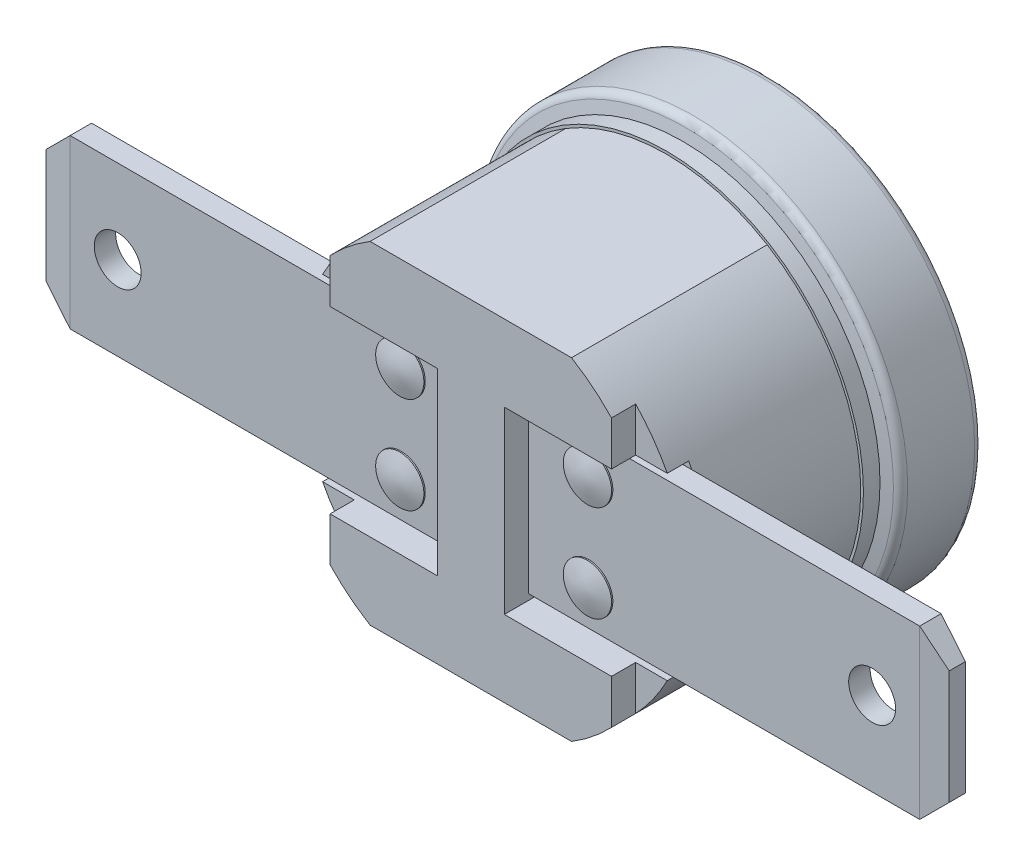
ISO-10303-21;
HEADER;
FILE_DESCRIPTION(('STEP AP214'),'2;1');
FILE_NAME('part.step','',(''),(''),'','','');
FILE_SCHEMA(('AUTOMOTIVE_DESIGN { 1 0 10303 214 1 1 1 1 }'));
ENDSEC;
DATA;
#1=APPLICATION_CONTEXT('core data for automotive mechanical design processes');
#2=APPLICATION_PROTOCOL_DEFINITION('international standard','automotive_design',2000,#1);
#3=PRODUCT_CONTEXT('',#1,'mechanical');
#4=PRODUCT('Part','Part','',(#3));
#5=PRODUCT_RELATED_PRODUCT_CATEGORY('part','',(#4));
#6=PRODUCT_DEFINITION_FORMATION('','',#4);
#7=PRODUCT_DEFINITION_CONTEXT('part definition',#1,'design');
#8=PRODUCT_DEFINITION('design','',#6,#7);
#9=PRODUCT_DEFINITION_SHAPE('','',#8);
#10=(LENGTH_UNIT() NAMED_UNIT(*) SI_UNIT(.MILLI.,.METRE.));
#11=(NAMED_UNIT(*) PLANE_ANGLE_UNIT() SI_UNIT($,.RADIAN.));
#12=(NAMED_UNIT(*) SI_UNIT($,.STERADIAN.) SOLID_ANGLE_UNIT());
#13=UNCERTAINTY_MEASURE_WITH_UNIT(LENGTH_MEASURE(1.E-05),#10,'distance_accuracy_value','');
#14=(GEOMETRIC_REPRESENTATION_CONTEXT(3) GLOBAL_UNCERTAINTY_ASSIGNED_CONTEXT((#13)) GLOBAL_UNIT_ASSIGNED_CONTEXT((#10,
#11,#12)) REPRESENTATION_CONTEXT('',''));
#15=CARTESIAN_POINT('',(0.,0.,0.));
#16=DIRECTION('',(0.,0.,1.));
#17=DIRECTION('',(1.,0.,0.));
#18=AXIS2_PLACEMENT_3D('',#15,#16,#17);
#19=CARTESIAN_POINT('',(1.25,-3.125,10.1));
#20=DIRECTION('',(0.,0.,1.));
#21=DIRECTION('',(1.,0.,0.));
#22=AXIS2_PLACEMENT_3D('',#19,#20,#21);
#23=PLANE('',#22);
#24=CARTESIAN_POINT('',(3.5,-1.8,10.1));
#25=DIRECTION('',(0.,0.,1.));
#26=DIRECTION('',(-1.,0.,0.));
#27=AXIS2_PLACEMENT_3D('',#24,#25,#26);
#28=CIRCLE('',#27,0.9);
#29=CARTESIAN_POINT('',(2.6,-1.8,10.1));
#30=VERTEX_POINT('',#29);
#31=EDGE_CURVE('E443',#30,#30,#28,.T.);
#32=ORIENTED_EDGE('',*,*,#31,.F.);
#33=EDGE_LOOP('',(#32));
#34=FACE_BOUND('',#33,.T.);
#35=DIRECTION('',(1.,0.,0.));
#36=VECTOR('',#35,1.);
#37=CARTESIAN_POINT('',(1.25,-3.125,10.1));
#38=LINE('',#37,#36);
#39=CARTESIAN_POINT('',(1.25,-3.125,10.1));
#40=VERTEX_POINT('',#39);
#41=CARTESIAN_POINT('',(15.85,-3.125,10.1));
#42=VERTEX_POINT('',#41);
#43=EDGE_CURVE('E729',#40,#42,#38,.T.);
#44=ORIENTED_EDGE('',*,*,#43,.T.);
#45=DIRECTION('',(0.,1.,0.));
#46=VECTOR('',#45,1.);
#47=CARTESIAN_POINT('',(15.85,2.125,10.1));
#48=LINE('',#47,#46);
#49=CARTESIAN_POINT('',(15.85,3.125,10.1));
#50=VERTEX_POINT('',#49);
#51=EDGE_CURVE('E975',#42,#50,#48,.T.);
#52=ORIENTED_EDGE('',*,*,#51,.T.);
#53=DIRECTION('',(-1.,0.,0.));
#54=VECTOR('',#53,1.);
#55=CARTESIAN_POINT('',(1.25,3.125,10.1));
#56=LINE('',#55,#54);
#57=CARTESIAN_POINT('',(1.25,3.125,10.1));
#58=VERTEX_POINT('',#57);
#59=EDGE_CURVE('E733',#50,#58,#56,.T.);
#60=ORIENTED_EDGE('',*,*,#59,.T.);
#61=DIRECTION('',(0.,-1.,0.));
#62=VECTOR('',#61,1.);
#63=CARTESIAN_POINT('',(1.25,3.125,10.1));
#64=LINE('',#63,#62);
#65=EDGE_CURVE('E726',#58,#40,#64,.T.);
#66=ORIENTED_EDGE('',*,*,#65,.T.);
#67=EDGE_LOOP('',(#44,#52,#60,#66));
#68=FACE_BOUND('',#67,.T.);
#69=CARTESIAN_POINT('',(14.075,0.,10.1));
#70=DIRECTION('',(0.,0.,1.));
#71=DIRECTION('',(1.,0.,0.));
#72=AXIS2_PLACEMENT_3D('',#69,#70,#71);
#73=CIRCLE('',#72,0.875);
#74=CARTESIAN_POINT('',(14.95,0.,10.1));
#75=VERTEX_POINT('',#74);
#76=EDGE_CURVE('E720',#75,#75,#73,.T.);
#77=ORIENTED_EDGE('',*,*,#76,.F.);
#78=EDGE_LOOP('',(#77));
#79=FACE_BOUND('',#78,.T.);
#80=CARTESIAN_POINT('',(3.5,1.8,10.1));
#81=DIRECTION('',(0.,0.,1.));
#82=DIRECTION('',(-1.,0.,0.));
#83=AXIS2_PLACEMENT_3D('',#80,#81,#82);
#84=CIRCLE('',#83,0.9);
#85=CARTESIAN_POINT('',(2.6,1.8,10.1));
#86=VERTEX_POINT('',#85);
#87=EDGE_CURVE('E1377',#86,#86,#84,.T.);
#88=ORIENTED_EDGE('',*,*,#87,.F.);
#89=EDGE_LOOP('',(#88));
#90=FACE_BOUND('',#89,.T.);
#91=ADVANCED_FACE('F139',(#34,#68,#79,#90),#23,.T.);
#92=CARTESIAN_POINT('',(-1.25,-3.125,10.1));
#93=DIRECTION('',(0.,0.,-1.));
#94=DIRECTION('',(-1.,0.,0.));
#95=AXIS2_PLACEMENT_3D('',#92,#93,#94);
#96=PLANE('',#95);
#97=CARTESIAN_POINT('',(-3.5,1.8,10.1));
#98=DIRECTION('',(0.,0.,-1.));
#99=DIRECTION('',(-1.,0.,0.));
#100=AXIS2_PLACEMENT_3D('',#97,#98,#99);
#101=CIRCLE('',#100,0.9);
#102=CARTESIAN_POINT('',(-4.4,1.8,10.1));
#103=VERTEX_POINT('',#102);
#104=EDGE_CURVE('E154',#103,#103,#101,.F.);
#105=ORIENTED_EDGE('',*,*,#104,.F.);
#106=EDGE_LOOP('',(#105));
#107=FACE_BOUND('',#106,.T.);
#108=DIRECTION('',(-1.,0.,0.));
#109=VECTOR('',#108,1.);
#110=CARTESIAN_POINT('',(-1.25,3.125,10.1));
#111=LINE('',#110,#109);
#112=CARTESIAN_POINT('',(-1.25,3.125,10.1));
#113=VERTEX_POINT('',#112);
#114=CARTESIAN_POINT('',(-15.85,3.125,10.1));
#115=VERTEX_POINT('',#114);
#116=EDGE_CURVE('E407',#113,#115,#111,.T.);
#117=ORIENTED_EDGE('',*,*,#116,.T.);
#118=DIRECTION('',(0.,-1.,0.));
#119=VECTOR('',#118,1.);
#120=CARTESIAN_POINT('',(-15.85,-3.125,10.1));
#121=LINE('',#120,#119);
#122=CARTESIAN_POINT('',(-15.85,-3.125,10.1));
#123=VERTEX_POINT('',#122);
#124=EDGE_CURVE('E411',#115,#123,#121,.T.);
#125=ORIENTED_EDGE('',*,*,#124,.T.);
#126=DIRECTION('',(1.,0.,0.));
#127=VECTOR('',#126,1.);
#128=CARTESIAN_POINT('',(-1.25,-3.125,10.1));
#129=LINE('',#128,#127);
#130=CARTESIAN_POINT('',(-1.25,-3.125,10.1));
#131=VERTEX_POINT('',#130);
#132=EDGE_CURVE('E415',#123,#131,#129,.T.);
#133=ORIENTED_EDGE('',*,*,#132,.T.);
#134=DIRECTION('',(0.,1.,0.));
#135=VECTOR('',#134,1.);
#136=CARTESIAN_POINT('',(-1.25,3.125,10.1));
#137=LINE('',#136,#135);
#138=EDGE_CURVE('E412',#131,#113,#137,.T.);
#139=ORIENTED_EDGE('',*,*,#138,.T.);
#140=EDGE_LOOP('',(#117,#125,#133,#139));
#141=FACE_BOUND('',#140,.T.);
#142=CARTESIAN_POINT('',(-14.075,0.,10.1));
#143=DIRECTION('',(0.,0.,1.));
#144=DIRECTION('',(1.,0.,0.));
#145=AXIS2_PLACEMENT_3D('',#142,#143,#144);
#146=CIRCLE('',#145,0.875);
#147=CARTESIAN_POINT('',(-13.2,0.,10.1));
#148=VERTEX_POINT('',#147);
#149=EDGE_CURVE('E692',#148,#148,#146,.T.);
#150=ORIENTED_EDGE('',*,*,#149,.F.);
#151=EDGE_LOOP('',(#150));
#152=FACE_BOUND('',#151,.T.);
#153=CARTESIAN_POINT('',(-3.5,-1.8,10.1));
#154=DIRECTION('',(0.,0.,-1.));
#155=DIRECTION('',(-1.,0.,0.));
#156=AXIS2_PLACEMENT_3D('',#153,#154,#155);
#157=CIRCLE('',#156,0.9);
#158=CARTESIAN_POINT('',(-4.4,-1.8,10.1));
#159=VERTEX_POINT('',#158);
#160=EDGE_CURVE('E13',#159,#159,#157,.F.);
#161=ORIENTED_EDGE('',*,*,#160,.F.);
#162=EDGE_LOOP('',(#161));
#163=FACE_BOUND('',#162,.T.);
#164=ADVANCED_FACE('F408',(#107,#141,#152,#163),#96,.F.);
#165=CARTESIAN_POINT('',(-8.33741594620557,-3.35,9.3));
#166=DIRECTION('',(0.,0.,1.));
#167=DIRECTION('',(1.,0.,0.));
#168=AXIS2_PLACEMENT_3D('',#165,#166,#167);
#169=PLANE('',#168);
#170=CARTESIAN_POINT('',(0.,0.,9.3));
#171=DIRECTION('',(0.,0.,1.));
#172=DIRECTION('',(1.,0.,0.));
#173=AXIS2_PLACEMENT_3D('',#170,#171,#172);
#174=CIRCLE('',#173,7.25);
#175=CARTESIAN_POINT('',(-6.4296189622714,3.35,9.3));
#176=VERTEX_POINT('',#175);
#177=CARTESIAN_POINT('',(-6.54193205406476,3.125,9.3));
#178=VERTEX_POINT('',#177);
#179=EDGE_CURVE('E947',#176,#178,#174,.T.);
#180=ORIENTED_EDGE('',*,*,#179,.T.);
#181=DIRECTION('',(-1.,0.,0.));
#182=VECTOR('',#181,1.);
#183=CARTESIAN_POINT('',(-1.25,3.125,9.3));
#184=LINE('',#183,#182);
#185=CARTESIAN_POINT('',(-1.25,3.125,9.3));
#186=VERTEX_POINT('',#185);
#187=EDGE_CURVE('E704',#186,#178,#184,.T.);
#188=ORIENTED_EDGE('',*,*,#187,.F.);
#189=DIRECTION('',(0.,1.,0.));
#190=VECTOR('',#189,1.);
#191=CARTESIAN_POINT('',(-1.25,3.35,9.3));
#192=LINE('',#191,#190);
#193=CARTESIAN_POINT('',(-1.25,3.35,9.3));
#194=VERTEX_POINT('',#193);
#195=EDGE_CURVE('E879',#186,#194,#192,.T.);
#196=ORIENTED_EDGE('',*,*,#195,.T.);
#197=DIRECTION('',(-1.,0.,0.));
#198=VECTOR('',#197,1.);
#199=CARTESIAN_POINT('',(-8.33741594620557,3.35,9.3));
#200=LINE('',#199,#198);
#201=EDGE_CURVE('E884',#194,#176,#200,.T.);
#202=ORIENTED_EDGE('',*,*,#201,.T.);
#203=EDGE_LOOP('',(#180,#188,#196,#202));
#204=FACE_BOUND('',#203,.T.);
#205=ADVANCED_FACE('F504',(#204),#169,.T.);
#206=CARTESIAN_POINT('',(-1.25,-3.35,9.3));
#207=VERTEX_POINT('',#206);
#208=CARTESIAN_POINT('',(-1.25,-3.125,9.3));
#209=VERTEX_POINT('',#208);
#210=EDGE_CURVE('E881',#207,#209,#192,.T.);
#211=ORIENTED_EDGE('',*,*,#210,.T.);
#212=DIRECTION('',(1.,0.,0.));
#213=VECTOR('',#212,1.);
#214=CARTESIAN_POINT('',(-1.25,-3.125,9.3));
#215=LINE('',#214,#213);
#216=CARTESIAN_POINT('',(-6.54193205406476,-3.125,9.3));
#217=VERTEX_POINT('',#216);
#218=EDGE_CURVE('E706',#217,#209,#215,.T.);
#219=ORIENTED_EDGE('',*,*,#218,.F.);
#220=CARTESIAN_POINT('',(-6.4296189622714,-3.35,9.3));
#221=VERTEX_POINT('',#220);
#222=EDGE_CURVE('E946',#217,#221,#174,.T.);
#223=ORIENTED_EDGE('',*,*,#222,.T.);
#224=DIRECTION('',(1.,0.,0.));
#225=VECTOR('',#224,1.);
#226=CARTESIAN_POINT('',(-8.33741594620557,-3.35,9.3));
#227=LINE('',#226,#225);
#228=EDGE_CURVE('E877',#221,#207,#227,.T.);
#229=ORIENTED_EDGE('',*,*,#228,.T.);
#230=EDGE_LOOP('',(#211,#219,#223,#229));
#231=FACE_BOUND('',#230,.T.);
#232=ADVANCED_FACE('F632',(#231),#169,.T.);
#233=CARTESIAN_POINT('',(-1.25,3.35,9.3));
#234=DIRECTION('',(1.,0.,0.));
#235=DIRECTION('',(0.,1.,0.));
#236=AXIS2_PLACEMENT_3D('',#233,#234,#235);
#237=PLANE('',#236);
#238=DIRECTION('',(0.,0.,-1.));
#239=VECTOR('',#238,1.);
#240=CARTESIAN_POINT('',(-1.25,3.125,10.1));
#241=LINE('',#240,#239);
#242=EDGE_CURVE('E422',#113,#186,#241,.T.);
#243=ORIENTED_EDGE('',*,*,#242,.F.);
#244=ORIENTED_EDGE('',*,*,#138,.F.);
#245=DIRECTION('',(0.,0.,-1.));
#246=VECTOR('',#245,1.);
#247=CARTESIAN_POINT('',(-1.25,-3.125,10.1));
#248=LINE('',#247,#246);
#249=EDGE_CURVE('E703',#131,#209,#248,.T.);
#250=ORIENTED_EDGE('',*,*,#249,.T.);
#251=ORIENTED_EDGE('',*,*,#210,.F.);
#252=DIRECTION('',(0.,0.,1.));
#253=VECTOR('',#252,1.);
#254=CARTESIAN_POINT('',(-1.25,-3.35,9.3));
#255=LINE('',#254,#253);
#256=CARTESIAN_POINT('',(-1.25,-3.35,11.));
#257=VERTEX_POINT('',#256);
#258=EDGE_CURVE('E887',#207,#257,#255,.T.);
#259=ORIENTED_EDGE('',*,*,#258,.T.);
#260=DIRECTION('',(0.,1.,0.));
#261=VECTOR('',#260,1.);
#262=CARTESIAN_POINT('',(-1.25,3.35,11.));
#263=LINE('',#262,#261);
#264=CARTESIAN_POINT('',(-1.25,3.35,11.));
#265=VERTEX_POINT('',#264);
#266=EDGE_CURVE('E876',#257,#265,#263,.T.);
#267=ORIENTED_EDGE('',*,*,#266,.T.);
#268=DIRECTION('',(0.,0.,1.));
#269=VECTOR('',#268,1.);
#270=CARTESIAN_POINT('',(-1.25,3.35,9.3));
#271=LINE('',#270,#269);
#272=EDGE_CURVE('E892',#194,#265,#271,.T.);
#273=ORIENTED_EDGE('',*,*,#272,.F.);
#274=ORIENTED_EDGE('',*,*,#195,.F.);
#275=EDGE_LOOP('',(#243,#244,#250,#251,#259,#267,#273,#274));
#276=FACE_BOUND('',#275,.T.);
#277=ADVANCED_FACE('F614',(#276),#237,.F.);
#278=CARTESIAN_POINT('',(1.25,-3.35,9.3));
#279=DIRECTION('',(0.,0.,1.));
#280=DIRECTION('',(1.,0.,0.));
#281=AXIS2_PLACEMENT_3D('',#278,#279,#280);
#282=PLANE('',#281);
#283=CARTESIAN_POINT('',(0.,0.,9.3));
#284=DIRECTION('',(0.,0.,1.));
#285=DIRECTION('',(1.,0.,0.));
#286=AXIS2_PLACEMENT_3D('',#283,#284,#285);
#287=CIRCLE('',#286,7.25);
#288=CARTESIAN_POINT('',(6.4296189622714,-3.35,9.3));
#289=VERTEX_POINT('',#288);
#290=CARTESIAN_POINT('',(6.54193205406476,-3.125,9.3));
#291=VERTEX_POINT('',#290);
#292=EDGE_CURVE('E953',#289,#291,#287,.T.);
#293=ORIENTED_EDGE('',*,*,#292,.T.);
#294=DIRECTION('',(1.,0.,0.));
#295=VECTOR('',#294,1.);
#296=CARTESIAN_POINT('',(1.25,-3.125,9.3));
#297=LINE('',#296,#295);
#298=CARTESIAN_POINT('',(1.25,-3.125,9.3));
#299=VERTEX_POINT('',#298);
#300=EDGE_CURVE('E737',#299,#291,#297,.T.);
#301=ORIENTED_EDGE('',*,*,#300,.F.);
#302=DIRECTION('',(0.,-1.,0.));
#303=VECTOR('',#302,1.);
#304=CARTESIAN_POINT('',(1.25,3.35,9.3));
#305=LINE('',#304,#303);
#306=CARTESIAN_POINT('',(1.25,-3.35,9.3));
#307=VERTEX_POINT('',#306);
#308=EDGE_CURVE('E855',#299,#307,#305,.T.);
#309=ORIENTED_EDGE('',*,*,#308,.T.);
#310=DIRECTION('',(1.,0.,0.));
#311=VECTOR('',#310,1.);
#312=CARTESIAN_POINT('',(1.25,-3.35,9.3));
#313=LINE('',#312,#311);
#314=EDGE_CURVE('E854',#307,#289,#313,.T.);
#315=ORIENTED_EDGE('',*,*,#314,.T.);
#316=EDGE_LOOP('',(#293,#301,#309,#315));
#317=FACE_BOUND('',#316,.T.);
#318=ADVANCED_FACE('F610',(#317),#282,.T.);
#319=CARTESIAN_POINT('',(1.25,3.35,9.3));
#320=VERTEX_POINT('',#319);
#321=CARTESIAN_POINT('',(1.25,3.125,9.3));
#322=VERTEX_POINT('',#321);
#323=EDGE_CURVE('E851',#320,#322,#305,.T.);
#324=ORIENTED_EDGE('',*,*,#323,.T.);
#325=DIRECTION('',(-1.,0.,0.));
#326=VECTOR('',#325,1.);
#327=CARTESIAN_POINT('',(1.25,3.125,9.3));
#328=LINE('',#327,#326);
#329=CARTESIAN_POINT('',(6.54193205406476,3.125,9.3));
#330=VERTEX_POINT('',#329);
#331=EDGE_CURVE('E740',#330,#322,#328,.T.);
#332=ORIENTED_EDGE('',*,*,#331,.F.);
#333=CARTESIAN_POINT('',(6.4296189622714,3.35,9.3));
#334=VERTEX_POINT('',#333);
#335=EDGE_CURVE('E952',#330,#334,#287,.T.);
#336=ORIENTED_EDGE('',*,*,#335,.T.);
#337=DIRECTION('',(-1.,0.,0.));
#338=VECTOR('',#337,1.);
#339=CARTESIAN_POINT('',(1.25,3.35,9.3));
#340=LINE('',#339,#338);
#341=EDGE_CURVE('E858',#334,#320,#340,.T.);
#342=ORIENTED_EDGE('',*,*,#341,.T.);
#343=EDGE_LOOP('',(#324,#332,#336,#342));
#344=FACE_BOUND('',#343,.T.);
#345=ADVANCED_FACE('F613',(#344),#282,.T.);
#346=CARTESIAN_POINT('',(1.25,3.35,9.3));
#347=DIRECTION('',(-1.,0.,0.));
#348=DIRECTION('',(0.,-1.,0.));
#349=AXIS2_PLACEMENT_3D('',#346,#347,#348);
#350=PLANE('',#349);
#351=DIRECTION('',(0.,0.,-1.));
#352=VECTOR('',#351,1.);
#353=CARTESIAN_POINT('',(1.25,-3.125,10.1));
#354=LINE('',#353,#352);
#355=EDGE_CURVE('E756',#40,#299,#354,.T.);
#356=ORIENTED_EDGE('',*,*,#355,.F.);
#357=ORIENTED_EDGE('',*,*,#65,.F.);
#358=DIRECTION('',(0.,0.,-1.));
#359=VECTOR('',#358,1.);
#360=CARTESIAN_POINT('',(1.25,3.125,10.1));
#361=LINE('',#360,#359);
#362=EDGE_CURVE('E736',#58,#322,#361,.T.);
#363=ORIENTED_EDGE('',*,*,#362,.T.);
#364=ORIENTED_EDGE('',*,*,#323,.F.);
#365=DIRECTION('',(0.,0.,1.));
#366=VECTOR('',#365,1.);
#367=CARTESIAN_POINT('',(1.25,3.35,9.3));
#368=LINE('',#367,#366);
#369=CARTESIAN_POINT('',(1.25,3.35,11.));
#370=VERTEX_POINT('',#369);
#371=EDGE_CURVE('E865',#320,#370,#368,.T.);
#372=ORIENTED_EDGE('',*,*,#371,.T.);
#373=DIRECTION('',(0.,-1.,0.));
#374=VECTOR('',#373,1.);
#375=CARTESIAN_POINT('',(1.25,3.35,11.));
#376=LINE('',#375,#374);
#377=CARTESIAN_POINT('',(1.25,-3.35,11.));
#378=VERTEX_POINT('',#377);
#379=EDGE_CURVE('E850',#370,#378,#376,.T.);
#380=ORIENTED_EDGE('',*,*,#379,.T.);
#381=DIRECTION('',(0.,0.,1.));
#382=VECTOR('',#381,1.);
#383=CARTESIAN_POINT('',(1.25,-3.35,9.3));
#384=LINE('',#383,#382);
#385=EDGE_CURVE('E860',#307,#378,#384,.T.);
#386=ORIENTED_EDGE('',*,*,#385,.F.);
#387=ORIENTED_EDGE('',*,*,#308,.F.);
#388=EDGE_LOOP('',(#356,#357,#363,#364,#372,#380,#386,#387));
#389=FACE_BOUND('',#388,.T.);
#390=ADVANCED_FACE('F625',(#389),#350,.F.);
#391=CARTESIAN_POINT('',(0.,0.,11.));
#392=DIRECTION('',(0.,0.,-1.));
#393=DIRECTION('',(-1.,0.,0.));
#394=AXIS2_PLACEMENT_3D('',#391,#392,#393);
#395=CYLINDRICAL_SURFACE('',#394,7.25);
#396=DIRECTION('',(0.,0.,-1.));
#397=VECTOR('',#396,1.);
#398=CARTESIAN_POINT('',(3.75799148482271,-6.2,11.));
#399=LINE('',#398,#397);
#400=CARTESIAN_POINT('',(3.75799148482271,-6.2,11.));
#401=VERTEX_POINT('',#400);
#402=CARTESIAN_POINT('',(3.75799148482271,-6.2,3.7));
#403=VERTEX_POINT('',#402);
#404=EDGE_CURVE('E927',#401,#403,#399,.T.);
#405=ORIENTED_EDGE('',*,*,#404,.T.);
#406=CARTESIAN_POINT('',(0.,0.,3.7));
#407=DIRECTION('',(0.,0.,1.));
#408=DIRECTION('',(1.,0.,0.));
#409=AXIS2_PLACEMENT_3D('',#406,#407,#408);
#410=CIRCLE('',#409,7.25);
#411=CARTESIAN_POINT('',(3.75799148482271,6.2,3.7));
#412=VERTEX_POINT('',#411);
#413=EDGE_CURVE('E778',#403,#412,#410,.T.);
#414=ORIENTED_EDGE('',*,*,#413,.T.);
#415=DIRECTION('',(0.,0.,-1.));
#416=VECTOR('',#415,1.);
#417=CARTESIAN_POINT('',(3.75799148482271,6.2,11.));
#418=LINE('',#417,#416);
#419=CARTESIAN_POINT('',(3.75799148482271,6.2,11.));
#420=VERTEX_POINT('',#419);
#421=EDGE_CURVE('E941',#420,#412,#418,.T.);
#422=ORIENTED_EDGE('',*,*,#421,.F.);
#423=CARTESIAN_POINT('',(0.,0.,11.));
#424=DIRECTION('',(0.,0.,1.));
#425=DIRECTION('',(1.,0.,0.));
#426=AXIS2_PLACEMENT_3D('',#423,#424,#425);
#427=CIRCLE('',#426,7.25);
#428=CARTESIAN_POINT('',(5.25,5.,11.));
#429=VERTEX_POINT('',#428);
#430=EDGE_CURVE('E914',#429,#420,#427,.T.);
#431=ORIENTED_EDGE('',*,*,#430,.F.);
#432=DIRECTION('',(0.,0.,-1.));
#433=VECTOR('',#432,1.);
#434=CARTESIAN_POINT('',(5.25,5.,11.));
#435=LINE('',#434,#433);
#436=CARTESIAN_POINT('',(5.25,5.,10.1));
#437=VERTEX_POINT('',#436);
#438=EDGE_CURVE('E847',#429,#437,#435,.T.);
#439=ORIENTED_EDGE('',*,*,#438,.T.);
#440=CARTESIAN_POINT('',(0.,0.,10.1));
#441=DIRECTION('',(0.,0.,1.));
#442=DIRECTION('',(1.,0.,0.));
#443=AXIS2_PLACEMENT_3D('',#440,#441,#442);
#444=CIRCLE('',#443,7.25);
#445=CARTESIAN_POINT('',(6.4296189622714,3.35,10.1));
#446=VERTEX_POINT('',#445);
#447=EDGE_CURVE('E839',#446,#437,#444,.T.);
#448=ORIENTED_EDGE('',*,*,#447,.F.);
#449=DIRECTION('',(0.,0.,-1.));
#450=VECTOR('',#449,1.);
#451=CARTESIAN_POINT('',(6.4296189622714,3.35,11.));
#452=LINE('',#451,#450);
#453=EDGE_CURVE('E873',#446,#334,#452,.T.);
#454=ORIENTED_EDGE('',*,*,#453,.T.);
#455=ORIENTED_EDGE('',*,*,#335,.F.);
#456=CARTESIAN_POINT('',(0.,0.,9.3));
#457=DIRECTION('',(0.,0.,1.));
#458=DIRECTION('',(1.,0.,0.));
#459=AXIS2_PLACEMENT_3D('',#456,#457,#458);
#460=CIRCLE('',#459,7.25);
#461=EDGE_CURVE('E759',#291,#330,#460,.T.);
#462=ORIENTED_EDGE('',*,*,#461,.F.);
#463=ORIENTED_EDGE('',*,*,#292,.F.);
#464=DIRECTION('',(0.,0.,-1.));
#465=VECTOR('',#464,1.);
#466=CARTESIAN_POINT('',(6.4296189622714,-3.35,11.));
#467=LINE('',#466,#465);
#468=CARTESIAN_POINT('',(6.4296189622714,-3.35,10.1));
#469=VERTEX_POINT('',#468);
#470=EDGE_CURVE('E868',#289,#469,#467,.F.);
#471=ORIENTED_EDGE('',*,*,#470,.T.);
#472=CARTESIAN_POINT('',(5.25,-5.,10.1));
#473=VERTEX_POINT('',#472);
#474=EDGE_CURVE('E836',#473,#469,#444,.T.);
#475=ORIENTED_EDGE('',*,*,#474,.F.);
#476=DIRECTION('',(0.,0.,-1.));
#477=VECTOR('',#476,1.);
#478=CARTESIAN_POINT('',(5.25,-5.,11.));
#479=LINE('',#478,#477);
#480=CARTESIAN_POINT('',(5.25,-4.99999999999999,11.));
#481=VERTEX_POINT('',#480);
#482=EDGE_CURVE('E844',#473,#481,#479,.F.);
#483=ORIENTED_EDGE('',*,*,#482,.T.);
#484=EDGE_CURVE('E915',#401,#481,#427,.T.);
#485=ORIENTED_EDGE('',*,*,#484,.F.);
#486=EDGE_LOOP('',(#405,#414,#422,#431,#439,#448,#454,#455,#462,#463,#471,#475,#483,#485));
#487=FACE_BOUND('',#486,.T.);
#488=ADVANCED_FACE('F628',(#487),#395,.T.);
#489=CARTESIAN_POINT('',(0.,0.,11.));
#490=DIRECTION('',(0.,0.,-1.));
#491=DIRECTION('',(-1.,0.,0.));
#492=AXIS2_PLACEMENT_3D('',#489,#490,#491);
#493=CYLINDRICAL_SURFACE('',#492,7.25);
#494=DIRECTION('',(0.,0.,-1.));
#495=VECTOR('',#494,1.);
#496=CARTESIAN_POINT('',(-3.75799148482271,6.2,11.));
#497=LINE('',#496,#495);
#498=CARTESIAN_POINT('',(-3.75799148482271,6.2,11.));
#499=VERTEX_POINT('',#498);
#500=CARTESIAN_POINT('',(-3.75799148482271,6.2,3.7));
#501=VERTEX_POINT('',#500);
#502=EDGE_CURVE('E937',#499,#501,#497,.T.);
#503=ORIENTED_EDGE('',*,*,#502,.T.);
#504=CARTESIAN_POINT('',(-3.75799148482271,-6.2,3.7));
#505=VERTEX_POINT('',#504);
#506=EDGE_CURVE('E784',#501,#505,#410,.T.);
#507=ORIENTED_EDGE('',*,*,#506,.T.);
#508=DIRECTION('',(0.,0.,-1.));
#509=VECTOR('',#508,1.);
#510=CARTESIAN_POINT('',(-3.75799148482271,-6.2,11.));
#511=LINE('',#510,#509);
#512=CARTESIAN_POINT('',(-3.75799148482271,-6.2,11.));
#513=VERTEX_POINT('',#512);
#514=EDGE_CURVE('E932',#513,#505,#511,.T.);
#515=ORIENTED_EDGE('',*,*,#514,.F.);
#516=CARTESIAN_POINT('',(0.,0.,11.));
#517=DIRECTION('',(0.,0.,1.));
#518=DIRECTION('',(1.,0.,0.));
#519=AXIS2_PLACEMENT_3D('',#516,#517,#518);
#520=CIRCLE('',#519,7.25);
#521=CARTESIAN_POINT('',(-5.25,-5.,11.));
#522=VERTEX_POINT('',#521);
#523=EDGE_CURVE('E920',#522,#513,#520,.T.);
#524=ORIENTED_EDGE('',*,*,#523,.F.);
#525=DIRECTION('',(0.,0.,-1.));
#526=VECTOR('',#525,1.);
#527=CARTESIAN_POINT('',(-5.25,-5.,11.));
#528=LINE('',#527,#526);
#529=CARTESIAN_POINT('',(-5.25,-5.,10.1));
#530=VERTEX_POINT('',#529);
#531=EDGE_CURVE('E826',#522,#530,#528,.T.);
#532=ORIENTED_EDGE('',*,*,#531,.T.);
#533=CARTESIAN_POINT('',(0.,0.,10.1));
#534=DIRECTION('',(0.,0.,1.));
#535=DIRECTION('',(1.,0.,0.));
#536=AXIS2_PLACEMENT_3D('',#533,#534,#535);
#537=CIRCLE('',#536,7.25);
#538=CARTESIAN_POINT('',(-6.4296189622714,-3.35,10.1));
#539=VERTEX_POINT('',#538);
#540=EDGE_CURVE('E815',#539,#530,#537,.T.);
#541=ORIENTED_EDGE('',*,*,#540,.F.);
#542=DIRECTION('',(0.,0.,-1.));
#543=VECTOR('',#542,1.);
#544=CARTESIAN_POINT('',(-6.4296189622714,-3.35,11.));
#545=LINE('',#544,#543);
#546=EDGE_CURVE('E894',#539,#221,#545,.T.);
#547=ORIENTED_EDGE('',*,*,#546,.T.);
#548=ORIENTED_EDGE('',*,*,#222,.F.);
#549=CARTESIAN_POINT('',(0.,0.,9.3));
#550=DIRECTION('',(0.,0.,-1.));
#551=DIRECTION('',(-1.,0.,0.));
#552=AXIS2_PLACEMENT_3D('',#549,#550,#551);
#553=CIRCLE('',#552,7.25);
#554=EDGE_CURVE('E717',#217,#178,#553,.T.);
#555=ORIENTED_EDGE('',*,*,#554,.T.);
#556=ORIENTED_EDGE('',*,*,#179,.F.);
#557=DIRECTION('',(0.,0.,-1.));
#558=VECTOR('',#557,1.);
#559=CARTESIAN_POINT('',(-6.4296189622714,3.35,11.));
#560=LINE('',#559,#558);
#561=CARTESIAN_POINT('',(-6.4296189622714,3.35,10.1));
#562=VERTEX_POINT('',#561);
#563=EDGE_CURVE('E899',#176,#562,#560,.F.);
#564=ORIENTED_EDGE('',*,*,#563,.T.);
#565=CARTESIAN_POINT('',(-5.25,5.,10.1));
#566=VERTEX_POINT('',#565);
#567=EDGE_CURVE('E818',#566,#562,#537,.T.);
#568=ORIENTED_EDGE('',*,*,#567,.F.);
#569=DIRECTION('',(0.,0.,-1.));
#570=VECTOR('',#569,1.);
#571=CARTESIAN_POINT('',(-5.25,5.,11.));
#572=LINE('',#571,#570);
#573=CARTESIAN_POINT('',(-5.25,5.,11.));
#574=VERTEX_POINT('',#573);
#575=EDGE_CURVE('E823',#566,#574,#572,.F.);
#576=ORIENTED_EDGE('',*,*,#575,.T.);
#577=EDGE_CURVE('E921',#499,#574,#520,.T.);
#578=ORIENTED_EDGE('',*,*,#577,.F.);
#579=EDGE_LOOP('',(#503,#507,#515,#524,#532,#541,#547,#548,#555,#556,#564,#568,#576,#578));
#580=FACE_BOUND('',#579,.T.);
#581=ADVANCED_FACE('F657',(#580),#493,.T.);
#582=CARTESIAN_POINT('',(3.75799148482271,6.2,3.00011857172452));
#583=VERTEX_POINT('',#582);
#584=CARTESIAN_POINT('',(3.75799148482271,6.2,0.));
#585=VERTEX_POINT('',#584);
#586=EDGE_CURVE('E940',#583,#585,#418,.T.);
#587=ORIENTED_EDGE('',*,*,#586,.F.);
#588=CARTESIAN_POINT('',(0.,0.,3.00011857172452));
#589=DIRECTION('',(0.,0.,1.));
#590=DIRECTION('',(1.,0.,0.));
#591=AXIS2_PLACEMENT_3D('',#588,#589,#590);
#592=CIRCLE('',#591,7.25);
#593=CARTESIAN_POINT('',(3.75799148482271,-6.2,3.00011857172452));
#594=VERTEX_POINT('',#593);
#595=EDGE_CURVE('E774',#594,#583,#592,.T.);
#596=ORIENTED_EDGE('',*,*,#595,.F.);
#597=CARTESIAN_POINT('',(3.75799148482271,-6.2,0.));
#598=VERTEX_POINT('',#597);
#599=EDGE_CURVE('E926',#594,#598,#399,.T.);
#600=ORIENTED_EDGE('',*,*,#599,.T.);
#601=CARTESIAN_POINT('',(0.,0.,0.));
#602=DIRECTION('',(0.,0.,1.));
#603=DIRECTION('',(1.,0.,0.));
#604=AXIS2_PLACEMENT_3D('',#601,#602,#603);
#605=CIRCLE('',#604,7.25);
#606=EDGE_CURVE('E902',#598,#585,#605,.T.);
#607=ORIENTED_EDGE('',*,*,#606,.T.);
#608=EDGE_LOOP('',(#587,#596,#600,#607));
#609=FACE_BOUND('',#608,.T.);
#610=ADVANCED_FACE('F660',(#609),#395,.T.);
#611=CARTESIAN_POINT('',(-3.75799148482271,6.2,11.));
#612=DIRECTION('',(0.,-1.,0.));
#613=DIRECTION('',(0.,0.,-1.));
#614=AXIS2_PLACEMENT_3D('',#611,#612,#613);
#615=PLANE('',#614);
#616=DIRECTION('',(-1.,0.,0.));
#617=VECTOR('',#616,1.);
#618=CARTESIAN_POINT('',(-3.75799148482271,6.2,0.));
#619=LINE('',#618,#617);
#620=CARTESIAN_POINT('',(-3.75799148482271,6.2,0.));
#621=VERTEX_POINT('',#620);
#622=EDGE_CURVE('E905',#585,#621,#619,.T.);
#623=ORIENTED_EDGE('',*,*,#622,.T.);
#624=CARTESIAN_POINT('',(-3.75799148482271,6.2,3.00011857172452));
#625=VERTEX_POINT('',#624);
#626=EDGE_CURVE('E935',#625,#621,#497,.T.);
#627=ORIENTED_EDGE('',*,*,#626,.F.);
#628=DIRECTION('',(0.,0.,1.));
#629=VECTOR('',#628,1.);
#630=CARTESIAN_POINT('',(-3.75799148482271,6.2,0.));
#631=LINE('',#630,#629);
#632=EDGE_CURVE('E802',#625,#501,#631,.T.);
#633=ORIENTED_EDGE('',*,*,#632,.T.);
#634=ORIENTED_EDGE('',*,*,#502,.F.);
#635=DIRECTION('',(-1.,0.,0.));
#636=VECTOR('',#635,1.);
#637=CARTESIAN_POINT('',(-3.75799148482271,6.2,11.));
#638=LINE('',#637,#636);
#639=EDGE_CURVE('E918',#420,#499,#638,.T.);
#640=ORIENTED_EDGE('',*,*,#639,.F.);
#641=ORIENTED_EDGE('',*,*,#421,.T.);
#642=DIRECTION('',(0.,0.,1.));
#643=VECTOR('',#642,1.);
#644=CARTESIAN_POINT('',(3.75799148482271,6.2,0.));
#645=LINE('',#644,#643);
#646=EDGE_CURVE('E805',#412,#583,#645,.F.);
#647=ORIENTED_EDGE('',*,*,#646,.T.);
#648=ORIENTED_EDGE('',*,*,#586,.T.);
#649=EDGE_LOOP('',(#623,#627,#633,#634,#640,#641,#647,#648));
#650=FACE_BOUND('',#649,.T.);
#651=ADVANCED_FACE('F655',(#650),#615,.F.);
#652=CARTESIAN_POINT('',(-3.75799148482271,-6.2,3.00011857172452));
#653=VERTEX_POINT('',#652);
#654=CARTESIAN_POINT('',(-3.75799148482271,-6.2,0.));
#655=VERTEX_POINT('',#654);
#656=EDGE_CURVE('E930',#653,#655,#511,.T.);
#657=ORIENTED_EDGE('',*,*,#656,.F.);
#658=EDGE_CURVE('E779',#625,#653,#592,.T.);
#659=ORIENTED_EDGE('',*,*,#658,.F.);
#660=ORIENTED_EDGE('',*,*,#626,.T.);
#661=CARTESIAN_POINT('',(0.,0.,0.));
#662=DIRECTION('',(0.,0.,1.));
#663=DIRECTION('',(1.,0.,0.));
#664=AXIS2_PLACEMENT_3D('',#661,#662,#663);
#665=CIRCLE('',#664,7.25);
#666=EDGE_CURVE('E908',#621,#655,#665,.T.);
#667=ORIENTED_EDGE('',*,*,#666,.T.);
#668=EDGE_LOOP('',(#657,#659,#660,#667));
#669=FACE_BOUND('',#668,.T.);
#670=ADVANCED_FACE('F651',(#669),#493,.T.);
#671=CARTESIAN_POINT('',(-3.75799148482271,-6.2,11.));
#672=DIRECTION('',(0.,1.,0.));
#673=DIRECTION('',(0.,0.,1.));
#674=AXIS2_PLACEMENT_3D('',#671,#672,#673);
#675=PLANE('',#674);
#676=DIRECTION('',(1.,0.,0.));
#677=VECTOR('',#676,1.);
#678=CARTESIAN_POINT('',(-3.75799148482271,-6.2,0.));
#679=LINE('',#678,#677);
#680=EDGE_CURVE('E911',#655,#598,#679,.T.);
#681=ORIENTED_EDGE('',*,*,#680,.T.);
#682=ORIENTED_EDGE('',*,*,#599,.F.);
#683=EDGE_CURVE('E931',#403,#594,#399,.T.);
#684=ORIENTED_EDGE('',*,*,#683,.F.);
#685=ORIENTED_EDGE('',*,*,#404,.F.);
#686=DIRECTION('',(1.,0.,0.));
#687=VECTOR('',#686,1.);
#688=CARTESIAN_POINT('',(-3.75799148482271,-6.2,11.));
#689=LINE('',#688,#687);
#690=EDGE_CURVE('E924',#513,#401,#689,.T.);
#691=ORIENTED_EDGE('',*,*,#690,.F.);
#692=ORIENTED_EDGE('',*,*,#514,.T.);
#693=EDGE_CURVE('E936',#505,#653,#511,.T.);
#694=ORIENTED_EDGE('',*,*,#693,.T.);
#695=ORIENTED_EDGE('',*,*,#656,.T.);
#696=EDGE_LOOP('',(#681,#682,#684,#685,#691,#692,#694,#695));
#697=FACE_BOUND('',#696,.T.);
#698=ADVANCED_FACE('F647',(#697),#675,.F.);
#699=CARTESIAN_POINT('',(0.,0.,11.));
#700=DIRECTION('',(0.,0.,1.));
#701=DIRECTION('',(1.,0.,0.));
#702=AXIS2_PLACEMENT_3D('',#699,#700,#701);
#703=PLANE('',#702);
#704=DIRECTION('',(0.,1.,0.));
#705=VECTOR('',#704,1.);
#706=CARTESIAN_POINT('',(-5.25,6.27345501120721,11.));
#707=LINE('',#706,#705);
#708=CARTESIAN_POINT('',(-5.25,-3.35,11.));
#709=VERTEX_POINT('',#708);
#710=EDGE_CURVE('E813',#522,#709,#707,.T.);
#711=ORIENTED_EDGE('',*,*,#710,.F.);
#712=ORIENTED_EDGE('',*,*,#523,.T.);
#713=ORIENTED_EDGE('',*,*,#690,.T.);
#714=ORIENTED_EDGE('',*,*,#484,.T.);
#715=DIRECTION('',(0.,-1.,0.));
#716=VECTOR('',#715,1.);
#717=CARTESIAN_POINT('',(5.25,6.57124559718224,11.));
#718=LINE('',#717,#716);
#719=CARTESIAN_POINT('',(5.25,-3.35,11.));
#720=VERTEX_POINT('',#719);
#721=EDGE_CURVE('E829',#720,#481,#718,.T.);
#722=ORIENTED_EDGE('',*,*,#721,.F.);
#723=DIRECTION('',(1.,0.,0.));
#724=VECTOR('',#723,1.);
#725=CARTESIAN_POINT('',(1.25,-3.35,11.));
#726=LINE('',#725,#724);
#727=EDGE_CURVE('E862',#378,#720,#726,.T.);
#728=ORIENTED_EDGE('',*,*,#727,.F.);
#729=ORIENTED_EDGE('',*,*,#379,.F.);
#730=DIRECTION('',(-1.,0.,0.));
#731=VECTOR('',#730,1.);
#732=CARTESIAN_POINT('',(0.,3.35,11.));
#733=LINE('',#732,#731);
#734=CARTESIAN_POINT('',(5.25,3.35,11.));
#735=VERTEX_POINT('',#734);
#736=EDGE_CURVE('E950',#735,#370,#733,.T.);
#737=ORIENTED_EDGE('',*,*,#736,.F.);
#738=EDGE_CURVE('E834',#429,#735,#718,.T.);
#739=ORIENTED_EDGE('',*,*,#738,.F.);
#740=ORIENTED_EDGE('',*,*,#430,.T.);
#741=ORIENTED_EDGE('',*,*,#639,.T.);
#742=ORIENTED_EDGE('',*,*,#577,.T.);
#743=CARTESIAN_POINT('',(-5.25,3.35,11.));
#744=VERTEX_POINT('',#743);
#745=EDGE_CURVE('E808',#744,#574,#707,.T.);
#746=ORIENTED_EDGE('',*,*,#745,.F.);
#747=DIRECTION('',(-1.,0.,0.));
#748=VECTOR('',#747,1.);
#749=CARTESIAN_POINT('',(-8.33741594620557,3.35,11.));
#750=LINE('',#749,#748);
#751=EDGE_CURVE('E880',#265,#744,#750,.T.);
#752=ORIENTED_EDGE('',*,*,#751,.F.);
#753=ORIENTED_EDGE('',*,*,#266,.F.);
#754=DIRECTION('',(1.,0.,0.));
#755=VECTOR('',#754,1.);
#756=CARTESIAN_POINT('',(0.,-3.35,11.));
#757=LINE('',#756,#755);
#758=EDGE_CURVE('E944',#709,#257,#757,.T.);
#759=ORIENTED_EDGE('',*,*,#758,.F.);
#760=EDGE_LOOP('',(#711,#712,#713,#714,#722,#728,#729,#737,#739,#740,#741,#742,#746,#752,#753,#759));
#761=FACE_BOUND('',#760,.T.);
#762=ADVANCED_FACE('F637',(#761),#703,.T.);
#763=CARTESIAN_POINT('',(-8.33741594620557,3.35,9.3));
#764=DIRECTION('',(0.,1.,0.));
#765=DIRECTION('',(-1.,0.,0.));
#766=AXIS2_PLACEMENT_3D('',#763,#764,#765);
#767=PLANE('',#766);
#768=ORIENTED_EDGE('',*,*,#751,.T.);
#769=DIRECTION('',(0.,0.,-1.));
#770=VECTOR('',#769,1.);
#771=CARTESIAN_POINT('',(-5.25,3.35,9.3));
#772=LINE('',#771,#770);
#773=CARTESIAN_POINT('',(-5.25,3.35,10.1));
#774=VERTEX_POINT('',#773);
#775=EDGE_CURVE('E820',#744,#774,#772,.T.);
#776=ORIENTED_EDGE('',*,*,#775,.T.);
#777=DIRECTION('',(1.,0.,0.));
#778=VECTOR('',#777,1.);
#779=CARTESIAN_POINT('',(-8.33741594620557,3.35,10.1));
#780=LINE('',#779,#778);
#781=EDGE_CURVE('E817',#562,#774,#780,.T.);
#782=ORIENTED_EDGE('',*,*,#781,.F.);
#783=ORIENTED_EDGE('',*,*,#563,.F.);
#784=ORIENTED_EDGE('',*,*,#201,.F.);
#785=ORIENTED_EDGE('',*,*,#272,.T.);
#786=EDGE_LOOP('',(#768,#776,#782,#783,#784,#785));
#787=FACE_BOUND('',#786,.T.);
#788=ADVANCED_FACE('F634',(#787),#767,.F.);
#789=CARTESIAN_POINT('',(-8.33741594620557,-3.35,9.3));
#790=DIRECTION('',(0.,-1.,0.));
#791=DIRECTION('',(0.,0.,-1.));
#792=AXIS2_PLACEMENT_3D('',#789,#790,#791);
#793=PLANE('',#792);
#794=DIRECTION('',(-1.,0.,0.));
#795=VECTOR('',#794,1.);
#796=CARTESIAN_POINT('',(-8.33741594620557,-3.35,10.1));
#797=LINE('',#796,#795);
#798=CARTESIAN_POINT('',(-5.25,-3.35,10.1));
#799=VERTEX_POINT('',#798);
#800=EDGE_CURVE('E961',#799,#539,#797,.T.);
#801=ORIENTED_EDGE('',*,*,#800,.F.);
#802=DIRECTION('',(0.,0.,1.));
#803=VECTOR('',#802,1.);
#804=CARTESIAN_POINT('',(-5.25,-3.35,9.3));
#805=LINE('',#804,#803);
#806=EDGE_CURVE('E963',#799,#709,#805,.T.);
#807=ORIENTED_EDGE('',*,*,#806,.T.);
#808=ORIENTED_EDGE('',*,*,#758,.T.);
#809=ORIENTED_EDGE('',*,*,#258,.F.);
#810=ORIENTED_EDGE('',*,*,#228,.F.);
#811=ORIENTED_EDGE('',*,*,#546,.F.);
#812=EDGE_LOOP('',(#801,#807,#808,#809,#810,#811));
#813=FACE_BOUND('',#812,.T.);
#814=ADVANCED_FACE('F620',(#813),#793,.F.);
#815=CARTESIAN_POINT('',(1.25,3.35,9.3));
#816=DIRECTION('',(0.,1.,0.));
#817=DIRECTION('',(-1.,0.,0.));
#818=AXIS2_PLACEMENT_3D('',#815,#816,#817);
#819=PLANE('',#818);
#820=DIRECTION('',(1.,0.,0.));
#821=VECTOR('',#820,1.);
#822=CARTESIAN_POINT('',(1.25,3.35,10.1));
#823=LINE('',#822,#821);
#824=CARTESIAN_POINT('',(5.25,3.35,10.1));
#825=VERTEX_POINT('',#824);
#826=EDGE_CURVE('E838',#825,#446,#823,.T.);
#827=ORIENTED_EDGE('',*,*,#826,.F.);
#828=DIRECTION('',(0.,0.,1.));
#829=VECTOR('',#828,1.);
#830=CARTESIAN_POINT('',(5.25,3.35,9.3));
#831=LINE('',#830,#829);
#832=EDGE_CURVE('E841',#825,#735,#831,.T.);
#833=ORIENTED_EDGE('',*,*,#832,.T.);
#834=ORIENTED_EDGE('',*,*,#736,.T.);
#835=ORIENTED_EDGE('',*,*,#371,.F.);
#836=ORIENTED_EDGE('',*,*,#341,.F.);
#837=ORIENTED_EDGE('',*,*,#453,.F.);
#838=EDGE_LOOP('',(#827,#833,#834,#835,#836,#837));
#839=FACE_BOUND('',#838,.T.);
#840=ADVANCED_FACE('F616',(#839),#819,.F.);
#841=CARTESIAN_POINT('',(1.25,-3.35,9.3));
#842=DIRECTION('',(0.,-1.,0.));
#843=DIRECTION('',(0.,0.,-1.));
#844=AXIS2_PLACEMENT_3D('',#841,#842,#843);
#845=PLANE('',#844);
#846=ORIENTED_EDGE('',*,*,#727,.T.);
#847=DIRECTION('',(0.,0.,-1.));
#848=VECTOR('',#847,1.);
#849=CARTESIAN_POINT('',(5.25,-3.35,9.3));
#850=LINE('',#849,#848);
#851=CARTESIAN_POINT('',(5.25,-3.35,10.1));
#852=VERTEX_POINT('',#851);
#853=EDGE_CURVE('E958',#720,#852,#850,.T.);
#854=ORIENTED_EDGE('',*,*,#853,.T.);
#855=DIRECTION('',(-1.,0.,0.));
#856=VECTOR('',#855,1.);
#857=CARTESIAN_POINT('',(1.25,-3.35,10.1));
#858=LINE('',#857,#856);
#859=EDGE_CURVE('E956',#469,#852,#858,.T.);
#860=ORIENTED_EDGE('',*,*,#859,.F.);
#861=ORIENTED_EDGE('',*,*,#470,.F.);
#862=ORIENTED_EDGE('',*,*,#314,.F.);
#863=ORIENTED_EDGE('',*,*,#385,.T.);
#864=EDGE_LOOP('',(#846,#854,#860,#861,#862,#863));
#865=FACE_BOUND('',#864,.T.);
#866=ADVANCED_FACE('F619',(#865),#845,.F.);
#867=CARTESIAN_POINT('',(5.25,-6.09478065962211,10.1));
#868=DIRECTION('',(0.,0.,1.));
#869=DIRECTION('',(1.,0.,0.));
#870=AXIS2_PLACEMENT_3D('',#867,#868,#869);
#871=PLANE('',#870);
#872=ORIENTED_EDGE('',*,*,#474,.T.);
#873=ORIENTED_EDGE('',*,*,#859,.T.);
#874=DIRECTION('',(0.,-1.,0.));
#875=VECTOR('',#874,1.);
#876=CARTESIAN_POINT('',(5.25,6.57124559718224,10.1));
#877=LINE('',#876,#875);
#878=EDGE_CURVE('E830',#852,#473,#877,.T.);
#879=ORIENTED_EDGE('',*,*,#878,.T.);
#880=EDGE_LOOP('',(#872,#873,#879));
#881=FACE_BOUND('',#880,.T.);
#882=ADVANCED_FACE('F605',(#881),#871,.T.);
#883=CARTESIAN_POINT('',(5.25,6.57124559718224,10.1));
#884=DIRECTION('',(-1.,0.,0.));
#885=DIRECTION('',(0.,-1.,0.));
#886=AXIS2_PLACEMENT_3D('',#883,#884,#885);
#887=PLANE('',#886);
#888=ORIENTED_EDGE('',*,*,#878,.F.);
#889=ORIENTED_EDGE('',*,*,#853,.F.);
#890=ORIENTED_EDGE('',*,*,#721,.T.);
#891=ORIENTED_EDGE('',*,*,#482,.F.);
#892=EDGE_LOOP('',(#888,#889,#890,#891));
#893=FACE_BOUND('',#892,.T.);
#894=ADVANCED_FACE('F608',(#893),#887,.F.);
#895=ORIENTED_EDGE('',*,*,#738,.T.);
#896=ORIENTED_EDGE('',*,*,#832,.F.);
#897=EDGE_CURVE('E833',#437,#825,#877,.T.);
#898=ORIENTED_EDGE('',*,*,#897,.F.);
#899=ORIENTED_EDGE('',*,*,#438,.F.);
#900=EDGE_LOOP('',(#895,#896,#898,#899));
#901=FACE_BOUND('',#900,.T.);
#902=ADVANCED_FACE('F603',(#901),#887,.F.);
#903=ORIENTED_EDGE('',*,*,#447,.T.);
#904=ORIENTED_EDGE('',*,*,#897,.T.);
#905=ORIENTED_EDGE('',*,*,#826,.T.);
#906=EDGE_LOOP('',(#903,#904,#905));
#907=FACE_BOUND('',#906,.T.);
#908=ADVANCED_FACE('F600',(#907),#871,.T.);
#909=CARTESIAN_POINT('',(-10.0742074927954,-5.83669548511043,10.1));
#910=DIRECTION('',(0.,0.,1.));
#911=DIRECTION('',(1.,0.,0.));
#912=AXIS2_PLACEMENT_3D('',#909,#910,#911);
#913=PLANE('',#912);
#914=ORIENTED_EDGE('',*,*,#540,.T.);
#915=DIRECTION('',(0.,1.,0.));
#916=VECTOR('',#915,1.);
#917=CARTESIAN_POINT('',(-5.25,6.27345501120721,10.1));
#918=LINE('',#917,#916);
#919=EDGE_CURVE('E812',#530,#799,#918,.T.);
#920=ORIENTED_EDGE('',*,*,#919,.T.);
#921=ORIENTED_EDGE('',*,*,#800,.T.);
#922=EDGE_LOOP('',(#914,#920,#921));
#923=FACE_BOUND('',#922,.T.);
#924=ADVANCED_FACE('F595',(#923),#913,.T.);
#925=CARTESIAN_POINT('',(-5.25,6.27345501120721,10.1));
#926=DIRECTION('',(1.,0.,0.));
#927=DIRECTION('',(0.,1.,0.));
#928=AXIS2_PLACEMENT_3D('',#925,#926,#927);
#929=PLANE('',#928);
#930=ORIENTED_EDGE('',*,*,#710,.T.);
#931=ORIENTED_EDGE('',*,*,#806,.F.);
#932=ORIENTED_EDGE('',*,*,#919,.F.);
#933=ORIENTED_EDGE('',*,*,#531,.F.);
#934=EDGE_LOOP('',(#930,#931,#932,#933));
#935=FACE_BOUND('',#934,.T.);
#936=ADVANCED_FACE('F596',(#935),#929,.F.);
#937=EDGE_CURVE('E809',#774,#566,#918,.T.);
#938=ORIENTED_EDGE('',*,*,#937,.F.);
#939=ORIENTED_EDGE('',*,*,#775,.F.);
#940=ORIENTED_EDGE('',*,*,#745,.T.);
#941=ORIENTED_EDGE('',*,*,#575,.F.);
#942=EDGE_LOOP('',(#938,#939,#940,#941));
#943=FACE_BOUND('',#942,.T.);
#944=ADVANCED_FACE('F593',(#943),#929,.F.);
#945=ORIENTED_EDGE('',*,*,#567,.T.);
#946=ORIENTED_EDGE('',*,*,#781,.T.);
#947=ORIENTED_EDGE('',*,*,#937,.T.);
#948=EDGE_LOOP('',(#945,#946,#947));
#949=FACE_BOUND('',#948,.T.);
#950=ADVANCED_FACE('F563',(#949),#913,.T.);
#951=CARTESIAN_POINT('',(0.,0.,0.));
#952=DIRECTION('',(0.,0.,1.));
#953=DIRECTION('',(1.,0.,0.));
#954=AXIS2_PLACEMENT_3D('',#951,#952,#953);
#955=CYLINDRICAL_SURFACE('',#954,7.25);
#956=ORIENTED_EDGE('',*,*,#646,.F.);
#957=EDGE_CURVE('E780',#412,#501,#410,.T.);
#958=ORIENTED_EDGE('',*,*,#957,.T.);
#959=ORIENTED_EDGE('',*,*,#632,.F.);
#960=EDGE_CURVE('E775',#583,#625,#592,.T.);
#961=ORIENTED_EDGE('',*,*,#960,.F.);
#962=EDGE_LOOP('',(#956,#958,#959,#961));
#963=FACE_BOUND('',#962,.T.);
#964=ADVANCED_FACE('F560',(#963),#955,.F.);
#965=ORIENTED_EDGE('',*,*,#693,.F.);
#966=EDGE_CURVE('E1032',#505,#403,#410,.T.);
#967=ORIENTED_EDGE('',*,*,#966,.T.);
#968=ORIENTED_EDGE('',*,*,#683,.T.);
#969=EDGE_CURVE('E1055',#653,#594,#592,.T.);
#970=ORIENTED_EDGE('',*,*,#969,.F.);
#971=EDGE_LOOP('',(#965,#967,#968,#970));
#972=FACE_BOUND('',#971,.T.);
#973=ADVANCED_FACE('F542',(#972),#955,.F.);
#974=CARTESIAN_POINT('',(0.,0.,0.));
#975=DIRECTION('',(0.,0.,1.));
#976=DIRECTION('',(1.,0.,0.));
#977=AXIS2_PLACEMENT_3D('',#974,#975,#976);
#978=PLANE('',#977);
#979=CARTESIAN_POINT('',(0.,0.,0.));
#980=DIRECTION('',(0.,0.,1.));
#981=DIRECTION('',(1.,0.,0.));
#982=AXIS2_PLACEMENT_3D('',#979,#980,#981);
#983=CIRCLE('',#982,7.7);
#984=CARTESIAN_POINT('',(7.7,0.,0.));
#985=VERTEX_POINT('',#984);
#986=EDGE_CURVE('E762',#985,#985,#983,.T.);
#987=ORIENTED_EDGE('',*,*,#986,.T.);
#988=EDGE_LOOP('',(#987));
#989=FACE_BOUND('',#988,.T.);
#990=ORIENTED_EDGE('',*,*,#606,.F.);
#991=ORIENTED_EDGE('',*,*,#680,.F.);
#992=ORIENTED_EDGE('',*,*,#666,.F.);
#993=ORIENTED_EDGE('',*,*,#622,.F.);
#994=EDGE_LOOP('',(#990,#991,#992,#993));
#995=FACE_BOUND('',#994,.T.);
#996=ADVANCED_FACE('F538',(#989,#995),#978,.T.);
#997=CARTESIAN_POINT('',(0.,0.,-0.1));
#998=DIRECTION('',(0.,0.,-1.));
#999=DIRECTION('',(-1.,0.,0.));
#1000=AXIS2_PLACEMENT_3D('',#997,#998,#999);
#1001=PLANE('',#1000);
#1002=CARTESIAN_POINT('',(0.,0.,-0.1));
#1003=DIRECTION('',(0.,0.,1.));
#1004=DIRECTION('',(1.,0.,0.));
#1005=AXIS2_PLACEMENT_3D('',#1002,#1003,#1004);
#1006=CIRCLE('',#1005,7.7);
#1007=CARTESIAN_POINT('',(7.7,0.,-0.1));
#1008=VERTEX_POINT('',#1007);
#1009=EDGE_CURVE('E799',#1008,#1008,#1006,.T.);
#1010=ORIENTED_EDGE('',*,*,#1009,.F.);
#1011=EDGE_LOOP('',(#1010));
#1012=FACE_BOUND('',#1011,.T.);
#1013=ADVANCED_FACE('F541',(#1012),#1001,.T.);
#1014=CARTESIAN_POINT('',(0.,0.,0.2));
#1015=DIRECTION('',(0.,0.,1.));
#1016=DIRECTION('',(1.,0.,0.));
#1017=AXIS2_PLACEMENT_3D('',#1014,#1015,#1016);
#1018=TOROIDAL_SURFACE('',#1017,7.7,0.3);
#1019=ORIENTED_EDGE('',*,*,#1009,.T.);
#1020=EDGE_LOOP('',(#1019));
#1021=FACE_BOUND('',#1020,.T.);
#1022=CARTESIAN_POINT('',(0.,0.,0.200000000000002));
#1023=DIRECTION('',(0.,0.,1.));
#1024=DIRECTION('',(1.,0.,0.));
#1025=AXIS2_PLACEMENT_3D('',#1022,#1023,#1024);
#1026=CIRCLE('',#1025,8.);
#1027=CARTESIAN_POINT('',(8.,0.,0.200000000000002));
#1028=VERTEX_POINT('',#1027);
#1029=EDGE_CURVE('E796',#1028,#1028,#1026,.T.);
#1030=ORIENTED_EDGE('',*,*,#1029,.F.);
#1031=EDGE_LOOP('',(#1030));
#1032=FACE_BOUND('',#1031,.T.);
#1033=ADVANCED_FACE('F583',(#1021,#1032),#1018,.T.);
#1034=CARTESIAN_POINT('',(0.,0.,0.));
#1035=DIRECTION('',(0.,0.,1.));
#1036=DIRECTION('',(1.,0.,0.));
#1037=AXIS2_PLACEMENT_3D('',#1034,#1035,#1036);
#1038=CYLINDRICAL_SURFACE('',#1037,8.);
#1039=ORIENTED_EDGE('',*,*,#1029,.T.);
#1040=EDGE_LOOP('',(#1039));
#1041=FACE_BOUND('',#1040,.T.);
#1042=CARTESIAN_POINT('',(0.,0.,2.7));
#1043=DIRECTION('',(0.,0.,1.));
#1044=DIRECTION('',(1.,0.,0.));
#1045=AXIS2_PLACEMENT_3D('',#1042,#1043,#1044);
#1046=CIRCLE('',#1045,8.);
#1047=CARTESIAN_POINT('',(8.,0.,2.7));
#1048=VERTEX_POINT('',#1047);
#1049=EDGE_CURVE('E793',#1048,#1048,#1046,.T.);
#1050=ORIENTED_EDGE('',*,*,#1049,.F.);
#1051=EDGE_LOOP('',(#1050));
#1052=FACE_BOUND('',#1051,.T.);
#1053=ADVANCED_FACE('F579',(#1041,#1052),#1038,.T.);
#1054=CARTESIAN_POINT('',(0.,0.,2.7));
#1055=DIRECTION('',(0.,0.,1.));
#1056=DIRECTION('',(1.,0.,0.));
#1057=AXIS2_PLACEMENT_3D('',#1054,#1055,#1056);
#1058=TOROIDAL_SURFACE('',#1057,7.7,0.3);
#1059=ORIENTED_EDGE('',*,*,#1049,.T.);
#1060=EDGE_LOOP('',(#1059));
#1061=FACE_BOUND('',#1060,.T.);
#1062=CARTESIAN_POINT('',(0.,0.,2.99344428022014));
#1063=DIRECTION('',(0.,0.,1.));
#1064=DIRECTION('',(1.,0.,0.));
#1065=AXIS2_PLACEMENT_3D('',#1062,#1063,#1064);
#1066=CIRCLE('',#1065,7.76237350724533);
#1067=CARTESIAN_POINT('',(7.76237350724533,0.,2.99344428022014));
#1068=VERTEX_POINT('',#1067);
#1069=EDGE_CURVE('E790',#1068,#1068,#1066,.T.);
#1070=ORIENTED_EDGE('',*,*,#1069,.F.);
#1071=EDGE_LOOP('',(#1070));
#1072=FACE_BOUND('',#1071,.T.);
#1073=ADVANCED_FACE('F575',(#1061,#1072),#1058,.T.);
#1074=CARTESIAN_POINT('',(0.,0.,3.08109697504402));
#1075=DIRECTION('',(0.,0.,-1.));
#1076=DIRECTION('',(-1.,0.,0.));
#1077=AXIS2_PLACEMENT_3D('',#1074,#1075,#1076);
#1078=CONICAL_SURFACE('',#1077,7.35,1.36135681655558);
#1079=ORIENTED_EDGE('',*,*,#1069,.T.);
#1080=EDGE_LOOP('',(#1079));
#1081=FACE_BOUND('',#1080,.T.);
#1082=CARTESIAN_POINT('',(0.,0.,3.08109697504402));
#1083=DIRECTION('',(0.,0.,1.));
#1084=DIRECTION('',(1.,0.,0.));
#1085=AXIS2_PLACEMENT_3D('',#1082,#1083,#1084);
#1086=CIRCLE('',#1085,7.35);
#1087=CARTESIAN_POINT('',(7.35,0.,3.08109697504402));
#1088=VERTEX_POINT('',#1087);
#1089=EDGE_CURVE('E787',#1088,#1088,#1086,.T.);
#1090=ORIENTED_EDGE('',*,*,#1089,.F.);
#1091=EDGE_LOOP('',(#1090));
#1092=FACE_BOUND('',#1091,.T.);
#1093=ADVANCED_FACE('F571',(#1081,#1092),#1078,.T.);
#1094=CARTESIAN_POINT('',(0.,0.,0.));
#1095=DIRECTION('',(0.,0.,1.));
#1096=DIRECTION('',(1.,0.,0.));
#1097=AXIS2_PLACEMENT_3D('',#1094,#1095,#1096);
#1098=CYLINDRICAL_SURFACE('',#1097,7.35);
#1099=ORIENTED_EDGE('',*,*,#1089,.T.);
#1100=EDGE_LOOP('',(#1099));
#1101=FACE_BOUND('',#1100,.T.);
#1102=CARTESIAN_POINT('',(0.,0.,3.7));
#1103=DIRECTION('',(0.,0.,1.));
#1104=DIRECTION('',(1.,0.,0.));
#1105=AXIS2_PLACEMENT_3D('',#1102,#1103,#1104);
#1106=CIRCLE('',#1105,7.35);
#1107=CARTESIAN_POINT('',(7.35,0.,3.7));
#1108=VERTEX_POINT('',#1107);
#1109=EDGE_CURVE('E783',#1108,#1108,#1106,.T.);
#1110=ORIENTED_EDGE('',*,*,#1109,.F.);
#1111=EDGE_LOOP('',(#1110));
#1112=FACE_BOUND('',#1111,.T.);
#1113=ADVANCED_FACE('F567',(#1101,#1112),#1098,.T.);
#1114=CARTESIAN_POINT('',(7.25,0.,3.7));
#1115=DIRECTION('',(0.,0.,1.));
#1116=DIRECTION('',(1.,0.,0.));
#1117=AXIS2_PLACEMENT_3D('',#1114,#1115,#1116);
#1118=PLANE('',#1117);
#1119=ORIENTED_EDGE('',*,*,#1109,.T.);
#1120=EDGE_LOOP('',(#1119));
#1121=FACE_BOUND('',#1120,.T.);
#1122=ORIENTED_EDGE('',*,*,#957,.F.);
#1123=ORIENTED_EDGE('',*,*,#413,.F.);
#1124=ORIENTED_EDGE('',*,*,#966,.F.);
#1125=ORIENTED_EDGE('',*,*,#506,.F.);
#1126=EDGE_LOOP('',(#1122,#1123,#1124,#1125));
#1127=FACE_BOUND('',#1126,.T.);
#1128=ADVANCED_FACE('F558',(#1121,#1127),#1118,.T.);
#1129=CARTESIAN_POINT('',(0.,0.,2.89562952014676));
#1130=DIRECTION('',(0.,0.,-1.));
#1131=DIRECTION('',(-1.,0.,0.));
#1132=AXIS2_PLACEMENT_3D('',#1129,#1130,#1131);
#1133=CONICAL_SURFACE('',#1132,7.74158233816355,1.36135681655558);
#1134=ORIENTED_EDGE('',*,*,#960,.T.);
#1135=ORIENTED_EDGE('',*,*,#658,.T.);
#1136=ORIENTED_EDGE('',*,*,#969,.T.);
#1137=ORIENTED_EDGE('',*,*,#595,.T.);
#1138=EDGE_LOOP('',(#1134,#1135,#1136,#1137));
#1139=FACE_BOUND('',#1138,.T.);
#1140=CARTESIAN_POINT('',(0.,0.,2.89562952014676));
#1141=DIRECTION('',(0.,0.,1.));
#1142=DIRECTION('',(1.,0.,0.));
#1143=AXIS2_PLACEMENT_3D('',#1140,#1141,#1142);
#1144=CIRCLE('',#1143,7.74158233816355);
#1145=CARTESIAN_POINT('',(7.74158233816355,0.,2.89562952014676));
#1146=VERTEX_POINT('',#1145);
#1147=EDGE_CURVE('E771',#1146,#1146,#1144,.T.);
#1148=ORIENTED_EDGE('',*,*,#1147,.F.);
#1149=EDGE_LOOP('',(#1148));
#1150=FACE_BOUND('',#1149,.T.);
#1151=ADVANCED_FACE('F554',(#1139,#1150),#1133,.F.);
#1152=CARTESIAN_POINT('',(0.,0.,2.7));
#1153=DIRECTION('',(0.,0.,1.));
#1154=DIRECTION('',(1.,0.,0.));
#1155=AXIS2_PLACEMENT_3D('',#1152,#1153,#1154);
#1156=TOROIDAL_SURFACE('',#1155,7.7,0.2);
#1157=ORIENTED_EDGE('',*,*,#1147,.T.);
#1158=EDGE_LOOP('',(#1157));
#1159=FACE_BOUND('',#1158,.T.);
#1160=CARTESIAN_POINT('',(0.,0.,2.7));
#1161=DIRECTION('',(0.,0.,1.));
#1162=DIRECTION('',(1.,0.,0.));
#1163=AXIS2_PLACEMENT_3D('',#1160,#1161,#1162);
#1164=CIRCLE('',#1163,7.9);
#1165=CARTESIAN_POINT('',(7.9,0.,2.7));
#1166=VERTEX_POINT('',#1165);
#1167=EDGE_CURVE('E768',#1166,#1166,#1164,.T.);
#1168=ORIENTED_EDGE('',*,*,#1167,.F.);
#1169=EDGE_LOOP('',(#1168));
#1170=FACE_BOUND('',#1169,.T.);
#1171=ADVANCED_FACE('F550',(#1159,#1170),#1156,.F.);
#1172=CARTESIAN_POINT('',(0.,0.,0.));
#1173=DIRECTION('',(0.,0.,1.));
#1174=DIRECTION('',(1.,0.,0.));
#1175=AXIS2_PLACEMENT_3D('',#1172,#1173,#1174);
#1176=CYLINDRICAL_SURFACE('',#1175,7.9);
#1177=ORIENTED_EDGE('',*,*,#1167,.T.);
#1178=EDGE_LOOP('',(#1177));
#1179=FACE_BOUND('',#1178,.T.);
#1180=CARTESIAN_POINT('',(0.,0.,0.200000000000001));
#1181=DIRECTION('',(0.,0.,1.));
#1182=DIRECTION('',(1.,0.,0.));
#1183=AXIS2_PLACEMENT_3D('',#1180,#1181,#1182);
#1184=CIRCLE('',#1183,7.9);
#1185=CARTESIAN_POINT('',(7.9,0.,0.200000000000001));
#1186=VERTEX_POINT('',#1185);
#1187=EDGE_CURVE('E765',#1186,#1186,#1184,.T.);
#1188=ORIENTED_EDGE('',*,*,#1187,.F.);
#1189=EDGE_LOOP('',(#1188));
#1190=FACE_BOUND('',#1189,.T.);
#1191=ADVANCED_FACE('F546',(#1179,#1190),#1176,.F.);
#1192=CARTESIAN_POINT('',(0.,0.,0.2));
#1193=DIRECTION('',(0.,0.,1.));
#1194=DIRECTION('',(1.,0.,0.));
#1195=AXIS2_PLACEMENT_3D('',#1192,#1193,#1194);
#1196=TOROIDAL_SURFACE('',#1195,7.7,0.2);
#1197=ORIENTED_EDGE('',*,*,#1187,.T.);
#1198=EDGE_LOOP('',(#1197));
#1199=FACE_BOUND('',#1198,.T.);
#1200=ORIENTED_EDGE('',*,*,#986,.F.);
#1201=EDGE_LOOP('',(#1200));
#1202=FACE_BOUND('',#1201,.T.);
#1203=ADVANCED_FACE('F517',(#1199,#1202),#1196,.F.);
#1204=CARTESIAN_POINT('',(1.25,-3.125,9.3));
#1205=DIRECTION('',(0.,0.,1.));
#1206=DIRECTION('',(1.,0.,0.));
#1207=AXIS2_PLACEMENT_3D('',#1204,#1205,#1206);
#1208=PLANE('',#1207);
#1209=CARTESIAN_POINT('',(14.075,0.,9.3));
#1210=DIRECTION('',(0.,0.,1.));
#1211=DIRECTION('',(1.,0.,0.));
#1212=AXIS2_PLACEMENT_3D('',#1209,#1210,#1211);
#1213=CIRCLE('',#1212,0.875);
#1214=CARTESIAN_POINT('',(14.95,0.,9.3));
#1215=VERTEX_POINT('',#1214);
#1216=EDGE_CURVE('E719',#1215,#1215,#1213,.T.);
#1217=ORIENTED_EDGE('',*,*,#1216,.T.);
#1218=EDGE_LOOP('',(#1217));
#1219=FACE_BOUND('',#1218,.T.);
#1220=CARTESIAN_POINT('',(15.85,3.125,9.3));
#1221=VERTEX_POINT('',#1220);
#1222=EDGE_CURVE('E730',#1221,#330,#328,.T.);
#1223=ORIENTED_EDGE('',*,*,#1222,.F.);
#1224=DIRECTION('',(0.,-1.,0.));
#1225=VECTOR('',#1224,1.);
#1226=CARTESIAN_POINT('',(15.85,-3.125,9.3));
#1227=LINE('',#1226,#1225);
#1228=CARTESIAN_POINT('',(15.85,-3.125,9.3));
#1229=VERTEX_POINT('',#1228);
#1230=EDGE_CURVE('E425',#1221,#1229,#1227,.T.);
#1231=ORIENTED_EDGE('',*,*,#1230,.T.);
#1232=EDGE_CURVE('E723',#291,#1229,#297,.T.);
#1233=ORIENTED_EDGE('',*,*,#1232,.F.);
#1234=ORIENTED_EDGE('',*,*,#461,.T.);
#1235=EDGE_LOOP('',(#1223,#1231,#1233,#1234));
#1236=FACE_BOUND('',#1235,.T.);
#1237=ADVANCED_FACE('F513',(#1219,#1236),#1208,.F.);
#1238=CARTESIAN_POINT('',(1.25,-3.125,10.1));
#1239=DIRECTION('',(0.,1.,0.));
#1240=DIRECTION('',(0.,0.,1.));
#1241=AXIS2_PLACEMENT_3D('',#1238,#1239,#1240);
#1242=PLANE('',#1241);
#1243=ORIENTED_EDGE('',*,*,#300,.T.);
#1244=ORIENTED_EDGE('',*,*,#1232,.T.);
#1245=DIRECTION('',(0.,0.,-1.));
#1246=VECTOR('',#1245,1.);
#1247=CARTESIAN_POINT('',(15.85,-3.125,10.1));
#1248=LINE('',#1247,#1246);
#1249=EDGE_CURVE('E753',#42,#1229,#1248,.T.);
#1250=ORIENTED_EDGE('',*,*,#1249,.F.);
#1251=ORIENTED_EDGE('',*,*,#43,.F.);
#1252=ORIENTED_EDGE('',*,*,#355,.T.);
#1253=EDGE_LOOP('',(#1243,#1244,#1250,#1251,#1252));
#1254=FACE_BOUND('',#1253,.T.);
#1255=ADVANCED_FACE('F516',(#1254),#1242,.F.);
#1256=CARTESIAN_POINT('',(15.85,-3.125,10.1));
#1257=DIRECTION('',(-0.707106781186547,0.707106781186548,0.));
#1258=DIRECTION('',(-0.707106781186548,-0.707106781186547,0.));
#1259=AXIS2_PLACEMENT_3D('',#1256,#1257,#1258);
#1260=PLANE('',#1259);
#1261=DIRECTION('',(0.,0.,-1.));
#1262=VECTOR('',#1261,1.);
#1263=CARTESIAN_POINT('',(16.85,-2.125,10.1));
#1264=LINE('',#1263,#1262);
#1265=CARTESIAN_POINT('',(16.85,-2.125,10.));
#1266=VERTEX_POINT('',#1265);
#1267=CARTESIAN_POINT('',(16.85,-2.125,9.4));
#1268=VERTEX_POINT('',#1267);
#1269=EDGE_CURVE('E750',#1266,#1268,#1264,.T.);
#1270=ORIENTED_EDGE('',*,*,#1269,.F.);
#1271=DIRECTION('',(-0.705345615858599,-0.705345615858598,0.0705345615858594));
#1272=VECTOR('',#1271,1.);
#1273=CARTESIAN_POINT('',(15.85,-3.125,10.1));
#1274=LINE('',#1273,#1272);
#1275=EDGE_CURVE('E428',#1266,#42,#1274,.T.);
#1276=ORIENTED_EDGE('',*,*,#1275,.T.);
#1277=ORIENTED_EDGE('',*,*,#1249,.T.);
#1278=DIRECTION('',(-0.705345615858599,-0.705345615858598,-0.0705345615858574));
#1279=VECTOR('',#1278,1.);
#1280=CARTESIAN_POINT('',(18.9644278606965,-0.0105721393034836,9.61144278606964));
#1281=LINE('',#1280,#1279);
#1282=EDGE_CURVE('E987',#1229,#1268,#1281,.F.);
#1283=ORIENTED_EDGE('',*,*,#1282,.T.);
#1284=EDGE_LOOP('',(#1270,#1276,#1277,#1283));
#1285=FACE_BOUND('',#1284,.T.);
#1286=ADVANCED_FACE('F530',(#1285),#1260,.F.);
#1287=CARTESIAN_POINT('',(16.85,2.125,10.1));
#1288=DIRECTION('',(-1.,0.,0.));
#1289=DIRECTION('',(0.,0.,1.));
#1290=AXIS2_PLACEMENT_3D('',#1287,#1288,#1289);
#1291=PLANE('',#1290);
#1292=DIRECTION('',(0.,0.,-1.));
#1293=VECTOR('',#1292,1.);
#1294=CARTESIAN_POINT('',(16.85,2.125,10.1));
#1295=LINE('',#1294,#1293);
#1296=CARTESIAN_POINT('',(16.85,2.125,10.));
#1297=VERTEX_POINT('',#1296);
#1298=CARTESIAN_POINT('',(16.85,2.125,9.4));
#1299=VERTEX_POINT('',#1298);
#1300=EDGE_CURVE('E747',#1297,#1299,#1295,.T.);
#1301=ORIENTED_EDGE('',*,*,#1300,.F.);
#1302=DIRECTION('',(0.,-1.,0.));
#1303=VECTOR('',#1302,1.);
#1304=CARTESIAN_POINT('',(16.85,-2.125,10.));
#1305=LINE('',#1304,#1303);
#1306=EDGE_CURVE('E985',#1297,#1266,#1305,.T.);
#1307=ORIENTED_EDGE('',*,*,#1306,.T.);
#1308=ORIENTED_EDGE('',*,*,#1269,.T.);
#1309=DIRECTION('',(0.,1.,0.));
#1310=VECTOR('',#1309,1.);
#1311=CARTESIAN_POINT('',(16.85,2.125,9.4));
#1312=LINE('',#1311,#1310);
#1313=EDGE_CURVE('E982',#1268,#1299,#1312,.T.);
#1314=ORIENTED_EDGE('',*,*,#1313,.T.);
#1315=EDGE_LOOP('',(#1301,#1307,#1308,#1314));
#1316=FACE_BOUND('',#1315,.T.);
#1317=ADVANCED_FACE('F526',(#1316),#1291,.F.);
#1318=CARTESIAN_POINT('',(15.85,3.125,10.1));
#1319=DIRECTION('',(-0.707106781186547,-0.707106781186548,0.));
#1320=DIRECTION('',(0.707106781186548,-0.707106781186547,0.));
#1321=AXIS2_PLACEMENT_3D('',#1318,#1319,#1320);
#1322=PLANE('',#1321);
#1323=DIRECTION('',(0.,0.,-1.));
#1324=VECTOR('',#1323,1.);
#1325=CARTESIAN_POINT('',(15.85,3.125,10.1));
#1326=LINE('',#1325,#1324);
#1327=EDGE_CURVE('E744',#50,#1221,#1326,.T.);
#1328=ORIENTED_EDGE('',*,*,#1327,.F.);
#1329=DIRECTION('',(0.705345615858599,-0.705345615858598,-0.0705345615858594));
#1330=VECTOR('',#1329,1.);
#1331=CARTESIAN_POINT('',(18.9594527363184,0.0155472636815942,9.78905472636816));
#1332=LINE('',#1331,#1330);
#1333=EDGE_CURVE('E980',#50,#1297,#1332,.T.);
#1334=ORIENTED_EDGE('',*,*,#1333,.T.);
#1335=ORIENTED_EDGE('',*,*,#1300,.T.);
#1336=DIRECTION('',(0.705345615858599,-0.705345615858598,0.0705345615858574));
#1337=VECTOR('',#1336,1.);
#1338=CARTESIAN_POINT('',(16.85,2.125,9.4));
#1339=LINE('',#1338,#1337);
#1340=EDGE_CURVE('E978',#1299,#1221,#1339,.F.);
#1341=ORIENTED_EDGE('',*,*,#1340,.T.);
#1342=EDGE_LOOP('',(#1328,#1334,#1335,#1341));
#1343=FACE_BOUND('',#1342,.T.);
#1344=ADVANCED_FACE('F522',(#1343),#1322,.F.);
#1345=CARTESIAN_POINT('',(1.25,3.125,10.1));
#1346=DIRECTION('',(0.,-1.,0.));
#1347=DIRECTION('',(0.,0.,-1.));
#1348=AXIS2_PLACEMENT_3D('',#1345,#1346,#1347);
#1349=PLANE('',#1348);
#1350=ORIENTED_EDGE('',*,*,#1222,.T.);
#1351=ORIENTED_EDGE('',*,*,#331,.T.);
#1352=ORIENTED_EDGE('',*,*,#362,.F.);
#1353=ORIENTED_EDGE('',*,*,#59,.F.);
#1354=ORIENTED_EDGE('',*,*,#1327,.T.);
#1355=EDGE_LOOP('',(#1350,#1351,#1352,#1353,#1354));
#1356=FACE_BOUND('',#1355,.T.);
#1357=ADVANCED_FACE('F519',(#1356),#1349,.F.);
#1358=CARTESIAN_POINT('',(14.075,0.,10.1));
#1359=DIRECTION('',(0.,0.,-1.));
#1360=DIRECTION('',(-1.,0.,0.));
#1361=AXIS2_PLACEMENT_3D('',#1358,#1359,#1360);
#1362=CYLINDRICAL_SURFACE('',#1361,0.875);
#1363=ORIENTED_EDGE('',*,*,#76,.T.);
#1364=EDGE_LOOP('',(#1363));
#1365=FACE_BOUND('',#1364,.T.);
#1366=ORIENTED_EDGE('',*,*,#1216,.F.);
#1367=EDGE_LOOP('',(#1366));
#1368=FACE_BOUND('',#1367,.T.);
#1369=ADVANCED_FACE('F511',(#1365,#1368),#1362,.F.);
#1370=CARTESIAN_POINT('',(-1.25,-3.125,9.3));
#1371=DIRECTION('',(0.,0.,-1.));
#1372=DIRECTION('',(-1.,0.,0.));
#1373=AXIS2_PLACEMENT_3D('',#1370,#1371,#1372);
#1374=PLANE('',#1373);
#1375=CARTESIAN_POINT('',(-14.075,0.,9.3));
#1376=DIRECTION('',(0.,0.,1.));
#1377=DIRECTION('',(1.,0.,0.));
#1378=AXIS2_PLACEMENT_3D('',#1375,#1376,#1377);
#1379=CIRCLE('',#1378,0.875);
#1380=CARTESIAN_POINT('',(-13.2,0.,9.3));
#1381=VERTEX_POINT('',#1380);
#1382=EDGE_CURVE('E690',#1381,#1381,#1379,.T.);
#1383=ORIENTED_EDGE('',*,*,#1382,.T.);
#1384=EDGE_LOOP('',(#1383));
#1385=FACE_BOUND('',#1384,.T.);
#1386=CARTESIAN_POINT('',(-15.85,-3.125,9.3));
#1387=VERTEX_POINT('',#1386);
#1388=EDGE_CURVE('E700',#1387,#217,#215,.T.);
#1389=ORIENTED_EDGE('',*,*,#1388,.F.);
#1390=DIRECTION('',(0.,1.,0.));
#1391=VECTOR('',#1390,1.);
#1392=CARTESIAN_POINT('',(-15.85,2.125,9.3));
#1393=LINE('',#1392,#1391);
#1394=CARTESIAN_POINT('',(-15.85,3.125,9.3));
#1395=VERTEX_POINT('',#1394);
#1396=EDGE_CURVE('E971',#1387,#1395,#1393,.T.);
#1397=ORIENTED_EDGE('',*,*,#1396,.T.);
#1398=EDGE_CURVE('E421',#178,#1395,#184,.T.);
#1399=ORIENTED_EDGE('',*,*,#1398,.F.);
#1400=ORIENTED_EDGE('',*,*,#554,.F.);
#1401=EDGE_LOOP('',(#1389,#1397,#1399,#1400));
#1402=FACE_BOUND('',#1401,.T.);
#1403=ADVANCED_FACE('F1253',(#1385,#1402),#1374,.T.);
#1404=CARTESIAN_POINT('',(-1.25,3.125,10.1));
#1405=DIRECTION('',(0.,-1.,0.));
#1406=DIRECTION('',(1.,0.,0.));
#1407=AXIS2_PLACEMENT_3D('',#1404,#1405,#1406);
#1408=PLANE('',#1407);
#1409=ORIENTED_EDGE('',*,*,#187,.T.);
#1410=ORIENTED_EDGE('',*,*,#1398,.T.);
#1411=DIRECTION('',(0.,0.,-1.));
#1412=VECTOR('',#1411,1.);
#1413=CARTESIAN_POINT('',(-15.85,3.125,10.1));
#1414=LINE('',#1413,#1412);
#1415=EDGE_CURVE('E397',#115,#1395,#1414,.T.);
#1416=ORIENTED_EDGE('',*,*,#1415,.F.);
#1417=ORIENTED_EDGE('',*,*,#116,.F.);
#1418=ORIENTED_EDGE('',*,*,#242,.T.);
#1419=EDGE_LOOP('',(#1409,#1410,#1416,#1417,#1418));
#1420=FACE_BOUND('',#1419,.T.);
#1421=ADVANCED_FACE('F419',(#1420),#1408,.F.);
#1422=CARTESIAN_POINT('',(-15.85,3.125,10.1));
#1423=DIRECTION('',(0.707106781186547,-0.707106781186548,0.));
#1424=DIRECTION('',(0.707106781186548,0.707106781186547,0.));
#1425=AXIS2_PLACEMENT_3D('',#1422,#1423,#1424);
#1426=PLANE('',#1425);
#1427=DIRECTION('',(0.,0.,-1.));
#1428=VECTOR('',#1427,1.);
#1429=CARTESIAN_POINT('',(-16.85,2.125,10.1));
#1430=LINE('',#1429,#1428);
#1431=CARTESIAN_POINT('',(-16.85,2.125,10.));
#1432=VERTEX_POINT('',#1431);
#1433=CARTESIAN_POINT('',(-16.85,2.125,9.4));
#1434=VERTEX_POINT('',#1433);
#1435=EDGE_CURVE('E399',#1432,#1434,#1430,.T.);
#1436=ORIENTED_EDGE('',*,*,#1435,.F.);
#1437=DIRECTION('',(-0.705345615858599,-0.705345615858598,-0.070534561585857));
#1438=VECTOR('',#1437,1.);
#1439=CARTESIAN_POINT('',(-18.9594527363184,0.0155472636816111,9.78905472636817));
#1440=LINE('',#1439,#1438);
#1441=EDGE_CURVE('E392',#1432,#115,#1440,.F.);
#1442=ORIENTED_EDGE('',*,*,#1441,.T.);
#1443=ORIENTED_EDGE('',*,*,#1415,.T.);
#1444=DIRECTION('',(-0.705345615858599,-0.705345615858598,0.0705345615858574));
#1445=VECTOR('',#1444,1.);
#1446=CARTESIAN_POINT('',(-16.85,2.125,9.4));
#1447=LINE('',#1446,#1445);
#1448=EDGE_CURVE('E973',#1395,#1434,#1447,.T.);
#1449=ORIENTED_EDGE('',*,*,#1448,.T.);
#1450=EDGE_LOOP('',(#1436,#1442,#1443,#1449));
#1451=FACE_BOUND('',#1450,.T.);
#1452=ADVANCED_FACE('F394',(#1451),#1426,.F.);
#1453=CARTESIAN_POINT('',(-16.85,2.125,10.1));
#1454=DIRECTION('',(1.,0.,0.));
#1455=DIRECTION('',(0.,0.,-1.));
#1456=AXIS2_PLACEMENT_3D('',#1453,#1454,#1455);
#1457=PLANE('',#1456);
#1458=DIRECTION('',(0.,0.,-1.));
#1459=VECTOR('',#1458,1.);
#1460=CARTESIAN_POINT('',(-16.85,-2.125,10.1));
#1461=LINE('',#1460,#1459);
#1462=CARTESIAN_POINT('',(-16.85,-2.125,10.));
#1463=VERTEX_POINT('',#1462);
#1464=CARTESIAN_POINT('',(-16.85,-2.125,9.4));
#1465=VERTEX_POINT('',#1464);
#1466=EDGE_CURVE('E713',#1463,#1465,#1461,.T.);
#1467=ORIENTED_EDGE('',*,*,#1466,.F.);
#1468=DIRECTION('',(0.,1.,0.));
#1469=VECTOR('',#1468,1.);
#1470=CARTESIAN_POINT('',(-16.85,2.125,10.));
#1471=LINE('',#1470,#1469);
#1472=EDGE_CURVE('E162',#1463,#1432,#1471,.T.);
#1473=ORIENTED_EDGE('',*,*,#1472,.T.);
#1474=ORIENTED_EDGE('',*,*,#1435,.T.);
#1475=DIRECTION('',(0.,-1.,0.));
#1476=VECTOR('',#1475,1.);
#1477=CARTESIAN_POINT('',(-16.85,-2.125,9.4));
#1478=LINE('',#1477,#1476);
#1479=EDGE_CURVE('E966',#1434,#1465,#1478,.T.);
#1480=ORIENTED_EDGE('',*,*,#1479,.T.);
#1481=EDGE_LOOP('',(#1467,#1473,#1474,#1480));
#1482=FACE_BOUND('',#1481,.T.);
#1483=ADVANCED_FACE('F1272',(#1482),#1457,.F.);
#1484=CARTESIAN_POINT('',(-15.85,-3.125,10.1));
#1485=DIRECTION('',(0.707106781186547,0.707106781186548,0.));
#1486=DIRECTION('',(-0.707106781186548,0.707106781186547,0.));
#1487=AXIS2_PLACEMENT_3D('',#1484,#1485,#1486);
#1488=PLANE('',#1487);
#1489=DIRECTION('',(0.,0.,-1.));
#1490=VECTOR('',#1489,1.);
#1491=CARTESIAN_POINT('',(-15.85,-3.125,10.1));
#1492=LINE('',#1491,#1490);
#1493=EDGE_CURVE('E710',#123,#1387,#1492,.T.);
#1494=ORIENTED_EDGE('',*,*,#1493,.F.);
#1495=DIRECTION('',(0.705345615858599,-0.705345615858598,0.0705345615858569));
#1496=VECTOR('',#1495,1.);
#1497=CARTESIAN_POINT('',(-15.85,-3.12500000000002,10.1));
#1498=LINE('',#1497,#1496);
#1499=EDGE_CURVE('E170',#123,#1463,#1498,.F.);
#1500=ORIENTED_EDGE('',*,*,#1499,.T.);
#1501=ORIENTED_EDGE('',*,*,#1466,.T.);
#1502=DIRECTION('',(0.705345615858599,-0.705345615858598,-0.0705345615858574));
#1503=VECTOR('',#1502,1.);
#1504=CARTESIAN_POINT('',(-18.9644278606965,-0.0105721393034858,9.61144278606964));
#1505=LINE('',#1504,#1503);
#1506=EDGE_CURVE('E969',#1465,#1387,#1505,.T.);
#1507=ORIENTED_EDGE('',*,*,#1506,.T.);
#1508=EDGE_LOOP('',(#1494,#1500,#1501,#1507));
#1509=FACE_BOUND('',#1508,.T.);
#1510=ADVANCED_FACE('F1279',(#1509),#1488,.F.);
#1511=CARTESIAN_POINT('',(-1.25,-3.125,10.1));
#1512=DIRECTION('',(0.,1.,0.));
#1513=DIRECTION('',(-1.,0.,0.));
#1514=AXIS2_PLACEMENT_3D('',#1511,#1512,#1513);
#1515=PLANE('',#1514);
#1516=ORIENTED_EDGE('',*,*,#1388,.T.);
#1517=ORIENTED_EDGE('',*,*,#218,.T.);
#1518=ORIENTED_EDGE('',*,*,#249,.F.);
#1519=ORIENTED_EDGE('',*,*,#132,.F.);
#1520=ORIENTED_EDGE('',*,*,#1493,.T.);
#1521=EDGE_LOOP('',(#1516,#1517,#1518,#1519,#1520));
#1522=FACE_BOUND('',#1521,.T.);
#1523=ADVANCED_FACE('F1286',(#1522),#1515,.F.);
#1524=CARTESIAN_POINT('',(-14.075,0.,10.1));
#1525=DIRECTION('',(0.,0.,-1.));
#1526=DIRECTION('',(-1.,0.,0.));
#1527=AXIS2_PLACEMENT_3D('',#1524,#1525,#1526);
#1528=CYLINDRICAL_SURFACE('',#1527,0.875);
#1529=ORIENTED_EDGE('',*,*,#149,.T.);
#1530=EDGE_LOOP('',(#1529));
#1531=FACE_BOUND('',#1530,.T.);
#1532=ORIENTED_EDGE('',*,*,#1382,.F.);
#1533=EDGE_LOOP('',(#1532));
#1534=FACE_BOUND('',#1533,.T.);
#1535=ADVANCED_FACE('F669',(#1531,#1534),#1528,.F.);
#1536=CARTESIAN_POINT('',(-16.85,2.125,9.4));
#1537=DIRECTION('',(-0.0995037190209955,0.,-0.99503719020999));
#1538=DIRECTION('',(-0.99503719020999,0.,0.0995037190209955));
#1539=AXIS2_PLACEMENT_3D('',#1536,#1537,#1538);
#1540=PLANE('',#1539);
#1541=ORIENTED_EDGE('',*,*,#1448,.F.);
#1542=ORIENTED_EDGE('',*,*,#1396,.F.);
#1543=ORIENTED_EDGE('',*,*,#1506,.F.);
#1544=ORIENTED_EDGE('',*,*,#1479,.F.);
#1545=EDGE_LOOP('',(#1541,#1542,#1543,#1544));
#1546=FACE_BOUND('',#1545,.T.);
#1547=ADVANCED_FACE('F665',(#1546),#1540,.T.);
#1548=CARTESIAN_POINT('',(15.85,-3.125,10.1));
#1549=DIRECTION('',(0.0995037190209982,0.,0.995037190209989));
#1550=DIRECTION('',(0.995037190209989,0.,-0.0995037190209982));
#1551=AXIS2_PLACEMENT_3D('',#1548,#1549,#1550);
#1552=PLANE('',#1551);
#1553=ORIENTED_EDGE('',*,*,#1275,.F.);
#1554=ORIENTED_EDGE('',*,*,#1306,.F.);
#1555=ORIENTED_EDGE('',*,*,#1333,.F.);
#1556=ORIENTED_EDGE('',*,*,#51,.F.);
#1557=EDGE_LOOP('',(#1553,#1554,#1555,#1556));
#1558=FACE_BOUND('',#1557,.T.);
#1559=ADVANCED_FACE('F668',(#1558),#1552,.T.);
#1560=CARTESIAN_POINT('',(16.85,2.125,9.4));
#1561=DIRECTION('',(-0.0995037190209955,0.,0.99503719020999));
#1562=DIRECTION('',(0.99503719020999,0.,0.0995037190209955));
#1563=AXIS2_PLACEMENT_3D('',#1560,#1561,#1562);
#1564=PLANE('',#1563);
#1565=ORIENTED_EDGE('',*,*,#1282,.F.);
#1566=ORIENTED_EDGE('',*,*,#1230,.F.);
#1567=ORIENTED_EDGE('',*,*,#1340,.F.);
#1568=ORIENTED_EDGE('',*,*,#1313,.F.);
#1569=EDGE_LOOP('',(#1565,#1566,#1567,#1568));
#1570=FACE_BOUND('',#1569,.T.);
#1571=ADVANCED_FACE('F673',(#1570),#1564,.F.);
#1572=CARTESIAN_POINT('',(-15.85,-3.125,10.1));
#1573=DIRECTION('',(0.0995037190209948,0.,-0.995037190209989));
#1574=DIRECTION('',(-0.99503719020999,0.,-0.0995037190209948));
#1575=AXIS2_PLACEMENT_3D('',#1572,#1573,#1574);
#1576=PLANE('',#1575);
#1577=ORIENTED_EDGE('',*,*,#1441,.F.);
#1578=ORIENTED_EDGE('',*,*,#1472,.F.);
#1579=ORIENTED_EDGE('',*,*,#1499,.F.);
#1580=ORIENTED_EDGE('',*,*,#124,.F.);
#1581=EDGE_LOOP('',(#1577,#1578,#1579,#1580));
#1582=FACE_BOUND('',#1581,.T.);
#1583=ADVANCED_FACE('F424',(#1582),#1576,.F.);
#1584=CARTESIAN_POINT('',(-3.5,1.8,10.15));
#1585=DIRECTION('',(0.,0.,-1.));
#1586=DIRECTION('',(-1.,0.,0.));
#1587=AXIS2_PLACEMENT_3D('',#1584,#1585,#1586);
#1588=CYLINDRICAL_SURFACE('',#1587,0.9);
#1589=CARTESIAN_POINT('',(-4.4,1.80000000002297,10.1501072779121));
#1590=CARTESIAN_POINT('',(-4.39999775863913,1.74944661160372,10.1501075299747));
#1591=CARTESIAN_POINT('',(-4.39572630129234,1.69885657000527,10.150114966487));
#1592=CARTESIAN_POINT('',(-4.37874587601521,1.59906975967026,10.1501125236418));
#1593=CARTESIAN_POINT('',(-4.36602675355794,1.54987474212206,10.1501026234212));
#1594=CARTESIAN_POINT('',(-4.33251535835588,1.45434451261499,10.1501057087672));
#1595=CARTESIAN_POINT('',(-4.31172802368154,1.40800757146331,10.1501186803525));
#1596=CARTESIAN_POINT('',(-4.26266870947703,1.31948172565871,10.1501489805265));
#1597=CARTESIAN_POINT('',(-4.23439658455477,1.27729290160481,10.1501663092));
#1598=CARTESIAN_POINT('',(-4.17117158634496,1.19826140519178,10.1501847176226));
#1599=CARTESIAN_POINT('',(-4.13621891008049,1.16141857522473,10.1501857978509));
#1600=CARTESIAN_POINT('',(-4.06062288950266,1.09412253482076,10.1501711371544));
#1601=CARTESIAN_POINT('',(-4.01997932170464,1.06366957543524,10.1501553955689));
#1602=CARTESIAN_POINT('',(-3.93415720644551,1.01002000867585,10.1501230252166));
#1603=CARTESIAN_POINT('',(-3.88897874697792,0.986823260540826,10.150106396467));
#1604=CARTESIAN_POINT('',(-3.79536876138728,0.948343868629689,10.1501050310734));
#1605=CARTESIAN_POINT('',(-3.7469372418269,0.933061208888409,10.150120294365));
#1606=CARTESIAN_POINT('',(-3.64819580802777,0.910843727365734,10.1501425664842));
#1607=CARTESIAN_POINT('',(-3.59788589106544,0.903908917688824,10.1501495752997));
#1608=CARTESIAN_POINT('',(-3.49681596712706,0.898584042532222,10.1501570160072));
#1609=CARTESIAN_POINT('',(-3.44605596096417,0.900193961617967,10.1501574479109));
#1610=CARTESIAN_POINT('',(-3.34552662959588,0.911912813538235,10.1501414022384));
#1611=CARTESIAN_POINT('',(-3.29575730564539,0.922021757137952,10.1501249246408));
#1612=CARTESIAN_POINT('',(-3.19862214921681,0.950451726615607,10.1501063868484));
#1613=CARTESIAN_POINT('',(-3.1512563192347,0.968772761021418,10.1501043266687));
#1614=CARTESIAN_POINT('',(-3.06027281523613,1.01310681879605,10.1501220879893));
#1615=CARTESIAN_POINT('',(-3.0166551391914,1.03911983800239,10.1501419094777));
#1616=CARTESIAN_POINT('',(-2.93440610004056,1.09809942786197,10.1501719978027));
#1617=CARTESIAN_POINT('',(-2.89577473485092,1.13106599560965,10.1501822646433));
#1618=CARTESIAN_POINT('',(-2.82459490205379,1.2030168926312,10.1501844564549));
#1619=CARTESIAN_POINT('',(-2.79204643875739,1.24200122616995,10.1501763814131));
#1620=CARTESIAN_POINT('',(-2.73395639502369,1.32488099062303,10.1501484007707));
#1621=CARTESIAN_POINT('',(-2.70841481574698,1.36877642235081,10.1501284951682));
#1622=CARTESIAN_POINT('',(-2.66506359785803,1.46023231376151,10.1501068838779));
#1623=CARTESIAN_POINT('',(-2.64725395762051,1.50779277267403,10.1501051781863));
#1624=CARTESIAN_POINT('',(-2.61987217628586,1.60522861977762,10.1501072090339));
#1625=CARTESIAN_POINT('',(-2.6103000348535,1.65510400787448,10.150110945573));
#1626=CARTESIAN_POINT('',(-2.59966497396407,1.75575390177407,10.150111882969));
#1627=CARTESIAN_POINT('',(-2.59860205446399,1.80652840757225,10.1501090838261));
#1628=CARTESIAN_POINT('',(-2.60501561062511,1.90753520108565,10.1501090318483));
#1629=CARTESIAN_POINT('',(-2.61249208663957,1.95776748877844,10.1501117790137));
#1630=CARTESIAN_POINT('',(-2.63577220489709,2.0562639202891,10.1501088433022));
#1631=CARTESIAN_POINT('',(-2.65157585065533,2.10452806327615,10.1501031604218));
#1632=CARTESIAN_POINT('',(-2.6910616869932,2.19771809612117,10.1501166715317));
#1633=CARTESIAN_POINT('',(-2.71474387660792,2.24264398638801,10.1501358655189));
#1634=CARTESIAN_POINT('',(-2.7693145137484,2.32788217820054,10.1501672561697));
#1635=CARTESIAN_POINT('',(-2.80020295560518,2.36819448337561,10.1501794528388));
#1636=CARTESIAN_POINT('',(-2.86830929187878,2.44306121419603,10.1501856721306));
#1637=CARTESIAN_POINT('',(-2.90552718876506,2.47761563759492,10.1501796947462));
#1638=CARTESIAN_POINT('',(-2.98523590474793,2.53998567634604,10.1501544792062));
#1639=CARTESIAN_POINT('',(-3.02772672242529,2.56780129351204,10.1501352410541));
#1640=CARTESIAN_POINT('',(-3.1167750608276,2.61590410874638,10.1501090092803));
#1641=CARTESIAN_POINT('',(-3.16333257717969,2.6361913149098,10.1501020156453));
#1642=CARTESIAN_POINT('',(-3.25919271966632,2.66866145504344,10.1501146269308));
#1643=CARTESIAN_POINT('',(-3.3084953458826,2.68084438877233,10.150134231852));
#1644=CARTESIAN_POINT('',(-3.40844625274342,2.69676016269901,10.1501543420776));
#1645=CARTESIAN_POINT('',(-3.45909453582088,2.70049298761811,10.1501548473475));
#1646=CARTESIAN_POINT('',(-3.56029885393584,2.69940253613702,10.1501533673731));
#1647=CARTESIAN_POINT('',(-3.61085488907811,2.69457926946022,10.1501513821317));
#1648=CARTESIAN_POINT('',(-3.71043973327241,2.67651354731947,10.1501299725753));
#1649=CARTESIAN_POINT('',(-3.75946853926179,2.6632710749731,10.1501105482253));
#1650=CARTESIAN_POINT('',(-3.85460792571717,2.62874254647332,10.1501021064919));
#1651=CARTESIAN_POINT('',(-3.90071845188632,2.60745634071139,10.1501130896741));
#1652=CARTESIAN_POINT('',(-3.98870955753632,2.55744551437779,10.1501423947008));
#1653=CARTESIAN_POINT('',(-4.03059030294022,2.52872118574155,10.1501607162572));
#1654=CARTESIAN_POINT('',(-4.10893618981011,2.46464860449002,10.1501826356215));
#1655=CARTESIAN_POINT('',(-4.14540117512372,2.42930016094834,10.1501862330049));
#1656=CARTESIAN_POINT('',(-4.21187845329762,2.35298238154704,10.150175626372));
#1657=CARTESIAN_POINT('',(-4.24189087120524,2.31201315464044,10.1501614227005));
#1658=CARTESIAN_POINT('',(-4.29462744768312,2.22559628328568,10.1501295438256));
#1659=CARTESIAN_POINT('',(-4.31734714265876,2.1801459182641,10.1501118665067));
#1660=CARTESIAN_POINT('',(-4.35480742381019,2.08611162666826,10.1501020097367));
#1661=CARTESIAN_POINT('',(-4.36955757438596,2.03753153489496,10.1501097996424));
#1662=CARTESIAN_POINT('',(-4.38672894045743,1.95720154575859,10.1501136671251));
#1663=CARTESIAN_POINT('',(-4.3916993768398,1.9259736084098,10.150113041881));
#1664=CARTESIAN_POINT('',(-4.3983356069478,1.86316855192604,10.150109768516));
#1665=CARTESIAN_POINT('',(-4.40000140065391,1.83159143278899,10.1501071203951));
#1666=CARTESIAN_POINT('',(-4.4,1.80000000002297,10.1501072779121));
#1667=B_SPLINE_CURVE_WITH_KNOTS('',3,(#1589,#1590,#1591,#1592,#1593,#1594,#1595,#1596,#1597,
#1598,#1599,#1600,#1601,#1602,#1603,#1604,#1605,#1606,#1607,#1608,#1609,#1610,#1611,#1612,#1613,
#1614,#1615,#1616,#1617,#1618,#1619,#1620,#1621,#1622,#1623,#1624,#1625,#1626,#1627,#1628,#1629,
#1630,#1631,#1632,#1633,#1634,#1635,#1636,#1637,#1638,#1639,#1640,#1641,#1642,#1643,#1644,#1645,
#1646,#1647,#1648,#1649,#1650,#1651,#1652,#1653,#1654,#1655,#1656,#1657,#1658,#1659,#1660,#1661,
#1662,#1663,#1664,#1665,#1666),.UNSPECIFIED.,.T.,.F.,(4,2,2,2,2,2,2,2,2,2,2,2,2,2,2,2,2,2,2,2,2,
2,2,2,2,2,2,2,2,2,2,2,2,2,2,2,2,2,4),(0.,0.151544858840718,0.303272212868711,0.454906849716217,
0.606544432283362,0.758177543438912,0.909816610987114,1.06145273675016,1.21308855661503,
1.36472459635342,1.51636036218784,1.6679963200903,1.81963243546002,1.97126846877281,
2.12290443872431,2.27454051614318,2.4261766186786,2.5778126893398,2.72944875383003,
2.88108481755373,3.03272088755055,3.18435702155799,3.3359931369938,3.48762913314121,
3.63926518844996,3.79090120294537,3.94253705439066,4.09417291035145,4.24580904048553,
4.39744499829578,4.54908126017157,4.70072034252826,4.85235347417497,5.00399097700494,
5.15562554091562,5.30735273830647,5.45889743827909,5.55359967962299,5.64830192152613),.UNSPECIFIED.);
#1668=CARTESIAN_POINT('',(-4.4,1.80000000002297,10.1501072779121));
#1669=VERTEX_POINT('',#1668);
#1670=EDGE_CURVE('E146',#1669,#1669,#1667,.T.);
#1671=ORIENTED_EDGE('',*,*,#1670,.F.);
#1672=EDGE_LOOP('',(#1671));
#1673=FACE_BOUND('',#1672,.T.);
#1674=ORIENTED_EDGE('',*,*,#104,.T.);
#1675=EDGE_LOOP('',(#1674));
#1676=FACE_BOUND('',#1675,.T.);
#1677=ADVANCED_FACE('F466',(#1673,#1676),#1588,.T.);
#1678=CARTESIAN_POINT('',(-4.45760441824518,0.882007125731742,10.0292180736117));
#1679=CARTESIAN_POINT('',(-4.30438808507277,0.882007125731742,10.0583450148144));
#1680=CARTESIAN_POINT('',(-4.15117175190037,0.882007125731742,10.08483716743));
#1681=CARTESIAN_POINT('',(-3.99795541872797,0.882007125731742,10.1095061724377));
#1682=CARTESIAN_POINT('',(-3.76813060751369,0.882007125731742,10.1378655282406));
#1683=CARTESIAN_POINT('',(-3.5383057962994,0.882007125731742,10.1457144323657));
#1684=CARTESIAN_POINT('',(-3.46169731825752,0.882007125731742,10.1457144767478));
#1685=CARTESIAN_POINT('',(-3.23187188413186,0.882007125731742,10.1378658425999));
#1686=CARTESIAN_POINT('',(-3.00204645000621,0.882007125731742,10.1095066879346));
#1687=CARTESIAN_POINT('',(-2.84882949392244,0.882007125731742,10.0848376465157));
#1688=CARTESIAN_POINT('',(-2.69561253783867,0.882007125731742,10.0583453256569));
#1689=CARTESIAN_POINT('',(-2.5423955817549,0.882007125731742,10.0292181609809));
#1690=CARTESIAN_POINT('',(-4.45760441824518,1.02888562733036,10.0552332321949));
#1691=CARTESIAN_POINT('',(-4.30438808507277,1.02888562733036,10.0889523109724));
#1692=CARTESIAN_POINT('',(-4.15117175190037,1.02888562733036,10.119998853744));
#1693=CARTESIAN_POINT('',(-3.99795541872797,1.02888562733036,10.1494127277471));
#1694=CARTESIAN_POINT('',(-3.76813060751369,1.02888562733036,10.1834028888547));
#1695=CARTESIAN_POINT('',(-3.5383057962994,1.02888562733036,10.1928228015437));
#1696=CARTESIAN_POINT('',(-3.46169731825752,1.02888562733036,10.1928228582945));
#1697=CARTESIAN_POINT('',(-3.23187188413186,1.02888562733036,10.1834032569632));
#1698=CARTESIAN_POINT('',(-3.00204645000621,1.02888562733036,10.1494132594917));
#1699=CARTESIAN_POINT('',(-2.84882949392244,1.02888562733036,10.1199992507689));
#1700=CARTESIAN_POINT('',(-2.69561253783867,1.02888562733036,10.088952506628));
#1701=CARTESIAN_POINT('',(-2.5423955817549,1.02888562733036,10.05523317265));
#1702=CARTESIAN_POINT('',(-4.45760441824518,1.17576412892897,10.0788270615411));
#1703=CARTESIAN_POINT('',(-4.30438808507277,1.17576412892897,10.1171033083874));
#1704=CARTESIAN_POINT('',(-4.15117175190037,1.17576412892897,10.1526282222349));
#1705=CARTESIAN_POINT('',(-3.99795541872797,1.17576412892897,10.1869616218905));
#1706=CARTESIAN_POINT('',(-3.76813060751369,1.17576412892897,10.226769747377));
#1707=CARTESIAN_POINT('',(-3.5383057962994,1.17576412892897,10.2378123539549));
#1708=CARTESIAN_POINT('',(-3.46169731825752,1.17576412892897,10.2378124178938));
#1709=CARTESIAN_POINT('',(-3.23187188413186,1.17576412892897,10.2267701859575));
#1710=CARTESIAN_POINT('',(-3.00204645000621,1.17576412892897,10.1869621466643));
#1711=CARTESIAN_POINT('',(-2.84882949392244,1.17576412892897,10.1526285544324));
#1712=CARTESIAN_POINT('',(-2.69561253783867,1.17576412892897,10.1171034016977));
#1713=CARTESIAN_POINT('',(-2.5423955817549,1.17576412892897,10.0788268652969));
#1714=CARTESIAN_POINT('',(-4.45760441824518,1.32264263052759,10.1007215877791));
#1715=CARTESIAN_POINT('',(-4.30438808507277,1.32264263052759,10.1437531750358));
#1716=CARTESIAN_POINT('',(-4.15117175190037,1.32264263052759,10.1841794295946));
#1717=CARTESIAN_POINT('',(-3.99795541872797,1.32264263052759,10.2238800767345));
#1718=CARTESIAN_POINT('',(-3.76813060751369,1.32264263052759,10.2691734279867));
#1719=CARTESIAN_POINT('',(-3.5383057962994,1.32264263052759,10.2818798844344));
#1720=CARTESIAN_POINT('',(-3.46169731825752,1.32264263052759,10.2818799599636));
#1721=CARTESIAN_POINT('',(-3.23187188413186,1.32264263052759,10.2691738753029));
#1722=CARTESIAN_POINT('',(-3.00204645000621,1.32264263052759,10.2238805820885));
#1723=CARTESIAN_POINT('',(-2.84882949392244,1.32264263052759,10.1841796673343));
#1724=CARTESIAN_POINT('',(-2.69561253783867,1.32264263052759,10.1437531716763));
#1725=CARTESIAN_POINT('',(-2.5423955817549,1.32264263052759,10.1007213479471));
#1726=CARTESIAN_POINT('',(-4.45760441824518,1.54296068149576,10.1256760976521));
#1727=CARTESIAN_POINT('',(-4.30438808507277,1.54296068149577,10.1744383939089));
#1728=CARTESIAN_POINT('',(-4.15117175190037,1.54296068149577,10.220808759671));
#1729=CARTESIAN_POINT('',(-3.99795541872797,1.54296068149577,10.2660791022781));
#1730=CARTESIAN_POINT('',(-3.76813060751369,1.54296068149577,10.3218172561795));
#1731=CARTESIAN_POINT('',(-3.5383057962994,1.54296068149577,10.3377060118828));
#1732=CARTESIAN_POINT('',(-3.46169731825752,1.54296068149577,10.3377060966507));
#1733=CARTESIAN_POINT('',(-3.23187188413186,1.54296068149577,10.3218177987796));
#1734=CARTESIAN_POINT('',(-3.00204645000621,1.54296068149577,10.2660796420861));
#1735=CARTESIAN_POINT('',(-2.84882949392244,1.54296068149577,10.2208090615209));
#1736=CARTESIAN_POINT('',(-2.69561253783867,1.54296068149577,10.1744385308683));
#1737=CARTESIAN_POINT('',(-2.5423955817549,1.54296068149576,10.125676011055));
#1738=CARTESIAN_POINT('',(-4.45760441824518,1.76327873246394,10.1325160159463));
#1739=CARTESIAN_POINT('',(-4.30438808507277,1.76327873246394,10.1828953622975));
#1740=CARTESIAN_POINT('',(-4.15117175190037,1.76327873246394,10.2309716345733));
#1741=CARTESIAN_POINT('',(-3.99795541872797,1.76327873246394,10.2779408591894));
#1742=CARTESIAN_POINT('',(-3.76813060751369,1.76327873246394,10.3368711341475));
#1743=CARTESIAN_POINT('',(-3.5383057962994,1.76327873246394,10.3551057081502));
#1744=CARTESIAN_POINT('',(-3.46169731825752,1.76327873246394,10.3551058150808));
#1745=CARTESIAN_POINT('',(-3.23187188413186,1.76327873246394,10.3368717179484));
#1746=CARTESIAN_POINT('',(-3.00204645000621,1.76327873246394,10.2779414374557));
#1747=CARTESIAN_POINT('',(-2.84882949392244,1.76327873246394,10.2309720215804));
#1748=CARTESIAN_POINT('',(-2.69561253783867,1.76327873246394,10.1828955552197));
#1749=CARTESIAN_POINT('',(-2.5423955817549,1.76327873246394,10.1325160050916));
#1750=CARTESIAN_POINT('',(-4.45760441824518,1.8367182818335,10.1325160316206));
#1751=CARTESIAN_POINT('',(-4.30438808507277,1.8367182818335,10.1828953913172));
#1752=CARTESIAN_POINT('',(-4.15117175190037,1.8367182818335,10.2309716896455));
#1753=CARTESIAN_POINT('',(-3.99795541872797,1.8367182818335,10.2779409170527));
#1754=CARTESIAN_POINT('',(-3.76813060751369,1.8367182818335,10.3368712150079));
#1755=CARTESIAN_POINT('',(-3.5383057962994,1.8367182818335,10.3551058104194));
#1756=CARTESIAN_POINT('',(-3.46169731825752,1.8367182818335,10.3551059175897));
#1757=CARTESIAN_POINT('',(-3.23187188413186,1.8367182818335,10.336871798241));
#1758=CARTESIAN_POINT('',(-3.00204645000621,1.8367182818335,10.2779415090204));
#1759=CARTESIAN_POINT('',(-2.84882949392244,1.8367182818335,10.2309720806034));
#1760=CARTESIAN_POINT('',(-2.69561253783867,1.8367182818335,10.1828956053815));
#1761=CARTESIAN_POINT('',(-2.5423955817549,1.8367182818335,10.1325160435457));
#1762=CARTESIAN_POINT('',(-4.45760441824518,2.05703692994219,10.1256762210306));
#1763=CARTESIAN_POINT('',(-4.30438808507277,2.05703692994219,10.1744386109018));
#1764=CARTESIAN_POINT('',(-4.15117175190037,2.05703692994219,10.2208090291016));
#1765=CARTESIAN_POINT('',(-3.99795541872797,2.05703692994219,10.2660794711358));
#1766=CARTESIAN_POINT('',(-3.76813060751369,2.05703692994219,10.3218177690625));
#1767=CARTESIAN_POINT('',(-3.5383057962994,2.05703692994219,10.337706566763));
#1768=CARTESIAN_POINT('',(-3.46169731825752,2.05703692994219,10.3377066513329));
#1769=CARTESIAN_POINT('',(-3.23187188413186,2.05703692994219,10.3218183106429));
#1770=CARTESIAN_POINT('',(-3.00204645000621,2.05703692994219,10.2660800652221));
#1771=CARTESIAN_POINT('',(-2.84882949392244,2.05703692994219,10.220809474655));
#1772=CARTESIAN_POINT('',(-2.69561253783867,2.05703692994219,10.1744388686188));
#1773=CARTESIAN_POINT('',(-2.5423955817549,2.05703692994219,10.1256763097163));
#1774=CARTESIAN_POINT('',(-4.45760441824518,2.27735557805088,10.100721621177));
#1775=CARTESIAN_POINT('',(-4.30438808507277,2.27735557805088,10.1437533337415));
#1776=CARTESIAN_POINT('',(-4.15117175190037,2.27735557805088,10.1841797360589));
#1777=CARTESIAN_POINT('',(-3.99795541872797,2.27735557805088,10.2238805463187));
#1778=CARTESIAN_POINT('',(-3.76813060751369,2.27735557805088,10.2691739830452));
#1779=CARTESIAN_POINT('',(-3.5383057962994,2.27735557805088,10.2818804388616));
#1780=CARTESIAN_POINT('',(-3.46169731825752,2.27735557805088,10.2818805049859));
#1781=CARTESIAN_POINT('',(-3.23187188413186,2.27735557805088,10.2691743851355));
#1782=CARTESIAN_POINT('',(-3.00204645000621,2.27735557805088,10.2238810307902));
#1783=CARTESIAN_POINT('',(-2.84882949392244,2.27735557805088,10.1841801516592));
#1784=CARTESIAN_POINT('',(-2.69561253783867,2.27735557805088,10.1437536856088));
#1785=CARTESIAN_POINT('',(-2.5423955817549,2.27735557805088,10.1007218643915));
#1786=CARTESIAN_POINT('',(-4.45760441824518,2.42423467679,10.0788270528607));
#1787=CARTESIAN_POINT('',(-4.30438808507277,2.42423467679,10.1171034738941));
#1788=CARTESIAN_POINT('',(-4.15117175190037,2.42423467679,10.1526285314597));
#1789=CARTESIAN_POINT('',(-3.99795541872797,2.42423467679,10.186962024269));
#1790=CARTESIAN_POINT('',(-3.76813060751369,2.42423467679,10.2267701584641));
#1791=CARTESIAN_POINT('',(-3.5383057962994,2.42423467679,10.2378127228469));
#1792=CARTESIAN_POINT('',(-3.46169731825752,2.42423467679,10.237812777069));
#1793=CARTESIAN_POINT('',(-3.23187188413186,2.42423467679,10.2267704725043));
#1794=CARTESIAN_POINT('',(-3.00204645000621,2.42423467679,10.1869623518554));
#1795=CARTESIAN_POINT('',(-2.84882949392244,2.42423467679,10.1526287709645));
#1796=CARTESIAN_POINT('',(-2.69561253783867,2.42423467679,10.1171036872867));
#1797=CARTESIAN_POINT('',(-2.5423955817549,2.42423467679,10.0788272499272));
#1798=CARTESIAN_POINT('',(-4.45760441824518,2.57111377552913,10.0552332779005));
#1799=CARTESIAN_POINT('',(-4.30438808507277,2.57111377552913,10.0889524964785));
#1800=CARTESIAN_POINT('',(-4.15117175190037,2.57111377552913,10.1199991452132));
#1801=CARTESIAN_POINT('',(-3.99795541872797,2.57111377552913,10.1494130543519));
#1802=CARTESIAN_POINT('',(-3.76813060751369,2.57111377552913,10.1834031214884));
#1803=CARTESIAN_POINT('',(-3.5383057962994,2.57111377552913,10.1928229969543));
#1804=CARTESIAN_POINT('',(-3.46169731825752,2.57111377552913,10.1928230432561));
#1805=CARTESIAN_POINT('',(-3.23187188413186,2.57111377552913,10.1834033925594));
#1806=CARTESIAN_POINT('',(-3.00204645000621,2.57111377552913,10.1494132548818));
#1807=CARTESIAN_POINT('',(-2.84882949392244,2.57111377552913,10.1199992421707));
#1808=CARTESIAN_POINT('',(-2.69561253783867,2.57111377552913,10.0889525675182));
#1809=CARTESIAN_POINT('',(-2.5423955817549,2.57111377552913,10.0552333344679));
#1810=CARTESIAN_POINT('',(-4.45760441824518,2.71799287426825,10.0292181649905));
#1811=CARTESIAN_POINT('',(-4.30438808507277,2.71799287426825,10.0583452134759));
#1812=CARTESIAN_POINT('',(-4.15117175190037,2.71799287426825,10.0848374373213));
#1813=CARTESIAN_POINT('',(-3.99795541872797,2.71799287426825,10.1095063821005));
#1814=CARTESIAN_POINT('',(-3.76813060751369,2.71799287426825,10.1378655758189));
#1815=CARTESIAN_POINT('',(-3.5383057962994,2.71799287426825,10.1457144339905));
#1816=CARTESIAN_POINT('',(-3.46169731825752,2.71799287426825,10.1457144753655));
#1817=CARTESIAN_POINT('',(-3.23187188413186,2.71799287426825,10.1378657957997));
#1818=CARTESIAN_POINT('',(-3.00204645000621,2.71799287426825,10.109506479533));
#1819=CARTESIAN_POINT('',(-2.84882949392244,2.71799287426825,10.084837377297));
#1820=CARTESIAN_POINT('',(-2.69561253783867,2.71799287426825,10.0583451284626));
#1821=CARTESIAN_POINT('',(-2.5423955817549,2.71799287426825,10.0292180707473));
#1822=B_SPLINE_SURFACE_WITH_KNOTS('',5,5,((#1678,#1679,#1680,#1681,#1682,#1683,#1684,#1685,
#1686,#1687,#1688,#1689),(#1690,#1691,#1692,#1693,#1694,#1695,#1696,#1697,#1698,#1699,#1700,
#1701),(#1702,#1703,#1704,#1705,#1706,#1707,#1708,#1709,#1710,#1711,#1712,#1713),(#1714,#1715,
#1716,#1717,#1718,#1719,#1720,#1721,#1722,#1723,#1724,#1725),(#1726,#1727,#1728,#1729,#1730,
#1731,#1732,#1733,#1734,#1735,#1736,#1737),(#1738,#1739,#1740,#1741,#1742,#1743,#1744,#1745,
#1746,#1747,#1748,#1749),(#1750,#1751,#1752,#1753,#1754,#1755,#1756,#1757,#1758,#1759,#1760,
#1761),(#1762,#1763,#1764,#1765,#1766,#1767,#1768,#1769,#1770,#1771,#1772,#1773),(#1774,#1775,
#1776,#1777,#1778,#1779,#1780,#1781,#1782,#1783,#1784,#1785),(#1786,#1787,#1788,#1789,#1790,
#1791,#1792,#1793,#1794,#1795,#1796,#1797),(#1798,#1799,#1800,#1801,#1802,#1803,#1804,#1805,
#1806,#1807,#1808,#1809),(#1810,#1811,#1812,#1813,#1814,#1815,#1816,#1817,#1818,#1819,#1820,
#1821)),.UNSPECIFIED.,.F.,.F.,.F.,(6,3,3,6),(6,3,3,6),(-0.917992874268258,-0.183600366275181,
0.18359738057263,0.917992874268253),(-0.95760441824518,-0.191522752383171,0.191519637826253,
0.9576044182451),.UNSPECIFIED.);
#1823=ORIENTED_EDGE('',*,*,#1670,.T.);
#1824=EDGE_LOOP('',(#1823));
#1825=FACE_BOUND('',#1824,.T.);
#1826=ADVANCED_FACE('F141',(#1825),#1822,.F.);
#1827=CARTESIAN_POINT('',(-3.5,-1.8,10.15));
#1828=DIRECTION('',(0.,0.,-1.));
#1829=DIRECTION('',(-1.,0.,0.));
#1830=AXIS2_PLACEMENT_3D('',#1827,#1828,#1829);
#1831=CYLINDRICAL_SURFACE('',#1830,0.9);
#1832=CARTESIAN_POINT('',(-4.4,-1.79999999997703,10.1501072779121));
#1833=CARTESIAN_POINT('',(-4.39999775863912,-1.85055338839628,10.1501075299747));
#1834=CARTESIAN_POINT('',(-4.39572630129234,-1.90114342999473,10.150114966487));
#1835=CARTESIAN_POINT('',(-4.37874587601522,-2.00093024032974,10.1501125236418));
#1836=CARTESIAN_POINT('',(-4.36602675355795,-2.05012525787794,10.1501026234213));
#1837=CARTESIAN_POINT('',(-4.33251535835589,-2.14565548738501,10.1501057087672));
#1838=CARTESIAN_POINT('',(-4.31172802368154,-2.19199242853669,10.1501186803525));
#1839=CARTESIAN_POINT('',(-4.26266870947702,-2.28051827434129,10.1501489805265));
#1840=CARTESIAN_POINT('',(-4.23439658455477,-2.32270709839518,10.1501663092));
#1841=CARTESIAN_POINT('',(-4.17117158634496,-2.40173859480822,10.1501847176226));
#1842=CARTESIAN_POINT('',(-4.13621891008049,-2.43858142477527,10.1501857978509));
#1843=CARTESIAN_POINT('',(-4.06062288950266,-2.50587746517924,10.1501711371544));
#1844=CARTESIAN_POINT('',(-4.01997932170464,-2.53633042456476,10.1501553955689));
#1845=CARTESIAN_POINT('',(-3.93415720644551,-2.58997999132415,10.1501230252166));
#1846=CARTESIAN_POINT('',(-3.88897874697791,-2.61317673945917,10.150106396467));
#1847=CARTESIAN_POINT('',(-3.79536876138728,-2.65165613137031,10.1501050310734));
#1848=CARTESIAN_POINT('',(-3.74693724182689,-2.66693879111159,10.150120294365));
#1849=CARTESIAN_POINT('',(-3.64819580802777,-2.68915627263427,10.1501425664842));
#1850=CARTESIAN_POINT('',(-3.59788589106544,-2.69609108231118,10.1501495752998));
#1851=CARTESIAN_POINT('',(-3.49681596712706,-2.70141595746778,10.1501570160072));
#1852=CARTESIAN_POINT('',(-3.44605596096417,-2.69980603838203,10.1501574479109));
#1853=CARTESIAN_POINT('',(-3.34552662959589,-2.68808718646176,10.1501414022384));
#1854=CARTESIAN_POINT('',(-3.29575730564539,-2.67797824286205,10.1501249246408));
#1855=CARTESIAN_POINT('',(-3.19862214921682,-2.6495482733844,10.1501063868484));
#1856=CARTESIAN_POINT('',(-3.1512563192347,-2.63122723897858,10.1501043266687));
#1857=CARTESIAN_POINT('',(-3.06027281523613,-2.58689318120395,10.1501220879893));
#1858=CARTESIAN_POINT('',(-3.0166551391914,-2.56088016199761,10.1501419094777));
#1859=CARTESIAN_POINT('',(-2.93440610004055,-2.50190057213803,10.1501719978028));
#1860=CARTESIAN_POINT('',(-2.89577473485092,-2.46893400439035,10.1501822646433));
#1861=CARTESIAN_POINT('',(-2.82459490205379,-2.3969831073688,10.150184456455));
#1862=CARTESIAN_POINT('',(-2.79204643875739,-2.35799877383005,10.1501763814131));
#1863=CARTESIAN_POINT('',(-2.73395639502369,-2.27511900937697,10.1501484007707));
#1864=CARTESIAN_POINT('',(-2.70841481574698,-2.23122357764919,10.1501284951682));
#1865=CARTESIAN_POINT('',(-2.66506359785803,-2.13976768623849,10.1501068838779));
#1866=CARTESIAN_POINT('',(-2.64725395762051,-2.09220722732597,10.1501051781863));
#1867=CARTESIAN_POINT('',(-2.61987217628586,-1.99477138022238,10.1501072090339));
#1868=CARTESIAN_POINT('',(-2.6103000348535,-1.94489599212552,10.150110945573));
#1869=CARTESIAN_POINT('',(-2.59966497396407,-1.84424609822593,10.150111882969));
#1870=CARTESIAN_POINT('',(-2.59860205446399,-1.79347159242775,10.1501090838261));
#1871=CARTESIAN_POINT('',(-2.60501561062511,-1.69246479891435,10.1501090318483));
#1872=CARTESIAN_POINT('',(-2.61249208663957,-1.64223251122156,10.1501117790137));
#1873=CARTESIAN_POINT('',(-2.6357722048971,-1.5437360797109,10.1501088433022));
#1874=CARTESIAN_POINT('',(-2.65157585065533,-1.49547193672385,10.1501031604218));
#1875=CARTESIAN_POINT('',(-2.6910616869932,-1.40228190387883,10.1501166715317));
#1876=CARTESIAN_POINT('',(-2.71474387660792,-1.357356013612,10.1501358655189));
#1877=CARTESIAN_POINT('',(-2.7693145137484,-1.27211782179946,10.1501672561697));
#1878=CARTESIAN_POINT('',(-2.80020295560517,-1.23180551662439,10.1501794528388));
#1879=CARTESIAN_POINT('',(-2.86830929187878,-1.15693878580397,10.1501856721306));
#1880=CARTESIAN_POINT('',(-2.90552718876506,-1.12238436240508,10.1501796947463));
#1881=CARTESIAN_POINT('',(-2.98523590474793,-1.06001432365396,10.1501544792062));
#1882=CARTESIAN_POINT('',(-3.02772672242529,-1.03219870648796,10.1501352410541));
#1883=CARTESIAN_POINT('',(-3.1167750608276,-0.984095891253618,10.1501090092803));
#1884=CARTESIAN_POINT('',(-3.16333257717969,-0.963808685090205,10.1501020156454));
#1885=CARTESIAN_POINT('',(-3.25919271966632,-0.931338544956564,10.1501146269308));
#1886=CARTESIAN_POINT('',(-3.3084953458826,-0.919155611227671,10.150134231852));
#1887=CARTESIAN_POINT('',(-3.40844625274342,-0.903239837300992,10.1501543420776));
#1888=CARTESIAN_POINT('',(-3.45909453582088,-0.899507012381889,10.1501548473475));
#1889=CARTESIAN_POINT('',(-3.56029885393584,-0.900597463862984,10.1501533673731));
#1890=CARTESIAN_POINT('',(-3.61085488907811,-0.905420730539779,10.1501513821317));
#1891=CARTESIAN_POINT('',(-3.71043973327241,-0.923486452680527,10.1501299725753));
#1892=CARTESIAN_POINT('',(-3.7594685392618,-0.936728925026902,10.1501105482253));
#1893=CARTESIAN_POINT('',(-3.85460792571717,-0.971257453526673,10.1501021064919));
#1894=CARTESIAN_POINT('',(-3.90071845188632,-0.99254365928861,10.1501130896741));
#1895=CARTESIAN_POINT('',(-3.98870955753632,-1.04255448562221,10.1501423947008));
#1896=CARTESIAN_POINT('',(-4.03059030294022,-1.07127881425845,10.1501607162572));
#1897=CARTESIAN_POINT('',(-4.10893618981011,-1.13535139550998,10.1501826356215));
#1898=CARTESIAN_POINT('',(-4.14540117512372,-1.17069983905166,10.1501862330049));
#1899=CARTESIAN_POINT('',(-4.21187845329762,-1.24701761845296,10.150175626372));
#1900=CARTESIAN_POINT('',(-4.24189087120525,-1.28798684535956,10.1501614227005));
#1901=CARTESIAN_POINT('',(-4.29462744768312,-1.37440371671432,10.1501295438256));
#1902=CARTESIAN_POINT('',(-4.31734714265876,-1.4198540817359,10.1501118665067));
#1903=CARTESIAN_POINT('',(-4.35480742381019,-1.51388837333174,10.1501020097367));
#1904=CARTESIAN_POINT('',(-4.36955757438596,-1.56246846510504,10.1501097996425));
#1905=CARTESIAN_POINT('',(-4.38672894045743,-1.64279845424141,10.1501136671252));
#1906=CARTESIAN_POINT('',(-4.3916993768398,-1.6740263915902,10.150113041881));
#1907=CARTESIAN_POINT('',(-4.3983356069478,-1.73683144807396,10.150109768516));
#1908=CARTESIAN_POINT('',(-4.40000140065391,-1.76840856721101,10.1501071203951));
#1909=CARTESIAN_POINT('',(-4.4,-1.79999999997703,10.1501072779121));
#1910=B_SPLINE_CURVE_WITH_KNOTS('',3,(#1832,#1833,#1834,#1835,#1836,#1837,#1838,#1839,#1840,
#1841,#1842,#1843,#1844,#1845,#1846,#1847,#1848,#1849,#1850,#1851,#1852,#1853,#1854,#1855,#1856,
#1857,#1858,#1859,#1860,#1861,#1862,#1863,#1864,#1865,#1866,#1867,#1868,#1869,#1870,#1871,#1872,
#1873,#1874,#1875,#1876,#1877,#1878,#1879,#1880,#1881,#1882,#1883,#1884,#1885,#1886,#1887,#1888,
#1889,#1890,#1891,#1892,#1893,#1894,#1895,#1896,#1897,#1898,#1899,#1900,#1901,#1902,#1903,#1904,
#1905,#1906,#1907,#1908,#1909),.UNSPECIFIED.,.T.,.F.,(4,2,2,2,2,2,2,2,2,2,2,2,2,2,2,2,2,2,2,2,2,
2,2,2,2,2,2,2,2,2,2,2,2,2,2,2,2,2,4),(0.,0.151544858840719,0.303272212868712,0.454906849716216,
0.606544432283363,0.758177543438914,0.909816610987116,1.06145273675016,1.21308855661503,
1.36472459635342,1.51636036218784,1.66799632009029,1.81963243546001,1.97126846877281,
2.12290443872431,2.27454051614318,2.42617661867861,2.5778126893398,2.72944875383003,
2.88108481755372,3.03272088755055,3.18435702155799,3.33599313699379,3.48762913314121,
3.63926518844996,3.79090120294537,3.94253705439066,4.09417291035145,4.24580904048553,
4.39744499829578,4.54908126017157,4.70072034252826,4.85235347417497,5.00399097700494,
5.15562554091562,5.30735273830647,5.45889743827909,5.55359967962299,5.64830192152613),.UNSPECIFIED.);
#1911=CARTESIAN_POINT('',(-4.4,-1.79999999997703,10.1501072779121));
#1912=VERTEX_POINT('',#1911);
#1913=EDGE_CURVE('E442',#1912,#1912,#1910,.T.);
#1914=ORIENTED_EDGE('',*,*,#1913,.F.);
#1915=EDGE_LOOP('',(#1914));
#1916=FACE_BOUND('',#1915,.T.);
#1917=ORIENTED_EDGE('',*,*,#160,.T.);
#1918=EDGE_LOOP('',(#1917));
#1919=FACE_BOUND('',#1918,.T.);
#1920=ADVANCED_FACE('F462',(#1916,#1919),#1831,.T.);
#1921=CARTESIAN_POINT('',(-4.4576044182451,-2.71799287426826,10.0292180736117));
#1922=CARTESIAN_POINT('',(-4.4576044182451,-2.57111437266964,10.055233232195));
#1923=CARTESIAN_POINT('',(-4.4576044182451,-2.42423587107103,10.0788270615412));
#1924=CARTESIAN_POINT('',(-4.4576044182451,-2.27735736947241,10.1007215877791));
#1925=CARTESIAN_POINT('',(-4.4576044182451,-2.05703931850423,10.1256760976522));
#1926=CARTESIAN_POINT('',(-4.4576044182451,-1.83672126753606,10.1325160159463));
#1927=CARTESIAN_POINT('',(-4.4576044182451,-1.76328171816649,10.1325160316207));
#1928=CARTESIAN_POINT('',(-4.4576044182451,-1.54296307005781,10.1256762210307));
#1929=CARTESIAN_POINT('',(-4.4576044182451,-1.32264442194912,10.1007216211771));
#1930=CARTESIAN_POINT('',(-4.4576044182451,-1.17576532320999,10.0788270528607));
#1931=CARTESIAN_POINT('',(-4.4576044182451,-1.02888622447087,10.0552332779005));
#1932=CARTESIAN_POINT('',(-4.4576044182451,-0.882007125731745,10.0292181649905));
#1933=CARTESIAN_POINT('',(-4.3043880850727,-2.71799287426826,10.0583450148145));
#1934=CARTESIAN_POINT('',(-4.3043880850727,-2.57111437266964,10.0889523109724));
#1935=CARTESIAN_POINT('',(-4.3043880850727,-2.42423587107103,10.1171033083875));
#1936=CARTESIAN_POINT('',(-4.3043880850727,-2.27735736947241,10.1437531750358));
#1937=CARTESIAN_POINT('',(-4.3043880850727,-2.05703931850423,10.1744383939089));
#1938=CARTESIAN_POINT('',(-4.3043880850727,-1.83672126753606,10.1828953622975));
#1939=CARTESIAN_POINT('',(-4.3043880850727,-1.76328171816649,10.1828953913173));
#1940=CARTESIAN_POINT('',(-4.3043880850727,-1.54296307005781,10.1744386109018));
#1941=CARTESIAN_POINT('',(-4.3043880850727,-1.32264442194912,10.1437533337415));
#1942=CARTESIAN_POINT('',(-4.3043880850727,-1.17576532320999,10.1171034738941));
#1943=CARTESIAN_POINT('',(-4.3043880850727,-1.02888622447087,10.0889524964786));
#1944=CARTESIAN_POINT('',(-4.3043880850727,-0.882007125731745,10.0583452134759));
#1945=CARTESIAN_POINT('',(-4.15117175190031,-2.71799287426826,10.08483716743));
#1946=CARTESIAN_POINT('',(-4.15117175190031,-2.57111437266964,10.1199988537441));
#1947=CARTESIAN_POINT('',(-4.15117175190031,-2.42423587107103,10.1526282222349));
#1948=CARTESIAN_POINT('',(-4.15117175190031,-2.27735736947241,10.1841794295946));
#1949=CARTESIAN_POINT('',(-4.15117175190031,-2.05703931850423,10.220808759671));
#1950=CARTESIAN_POINT('',(-4.15117175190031,-1.83672126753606,10.2309716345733));
#1951=CARTESIAN_POINT('',(-4.15117175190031,-1.76328171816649,10.2309716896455));
#1952=CARTESIAN_POINT('',(-4.15117175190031,-1.54296307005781,10.2208090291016));
#1953=CARTESIAN_POINT('',(-4.15117175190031,-1.32264442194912,10.1841797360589));
#1954=CARTESIAN_POINT('',(-4.15117175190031,-1.17576532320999,10.1526285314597));
#1955=CARTESIAN_POINT('',(-4.15117175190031,-1.02888622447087,10.1199991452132));
#1956=CARTESIAN_POINT('',(-4.15117175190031,-0.882007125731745,10.0848374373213));
#1957=CARTESIAN_POINT('',(-3.99795541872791,-2.71799287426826,10.1095061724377));
#1958=CARTESIAN_POINT('',(-3.99795541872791,-2.57111437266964,10.1494127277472));
#1959=CARTESIAN_POINT('',(-3.99795541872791,-2.42423587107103,10.1869616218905));
#1960=CARTESIAN_POINT('',(-3.99795541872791,-2.27735736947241,10.2238800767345));
#1961=CARTESIAN_POINT('',(-3.99795541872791,-2.05703931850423,10.2660791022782));
#1962=CARTESIAN_POINT('',(-3.99795541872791,-1.83672126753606,10.2779408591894));
#1963=CARTESIAN_POINT('',(-3.99795541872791,-1.76328171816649,10.2779409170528));
#1964=CARTESIAN_POINT('',(-3.99795541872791,-1.54296307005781,10.2660794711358));
#1965=CARTESIAN_POINT('',(-3.99795541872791,-1.32264442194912,10.2238805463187));
#1966=CARTESIAN_POINT('',(-3.99795541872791,-1.17576532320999,10.1869620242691));
#1967=CARTESIAN_POINT('',(-3.99795541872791,-1.02888622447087,10.1494130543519));
#1968=CARTESIAN_POINT('',(-3.99795541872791,-0.882007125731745,10.1095063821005));
#1969=CARTESIAN_POINT('',(-3.76813060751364,-2.71799287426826,10.1378655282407));
#1970=CARTESIAN_POINT('',(-3.76813060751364,-2.57111437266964,10.1834028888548));
#1971=CARTESIAN_POINT('',(-3.76813060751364,-2.42423587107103,10.226769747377));
#1972=CARTESIAN_POINT('',(-3.76813060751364,-2.27735736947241,10.2691734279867));
#1973=CARTESIAN_POINT('',(-3.76813060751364,-2.05703931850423,10.3218172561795));
#1974=CARTESIAN_POINT('',(-3.76813060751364,-1.83672126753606,10.3368711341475));
#1975=CARTESIAN_POINT('',(-3.76813060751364,-1.76328171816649,10.3368712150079));
#1976=CARTESIAN_POINT('',(-3.76813060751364,-1.54296307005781,10.3218177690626));
#1977=CARTESIAN_POINT('',(-3.76813060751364,-1.32264442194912,10.2691739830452));
#1978=CARTESIAN_POINT('',(-3.76813060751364,-1.17576532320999,10.2267701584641));
#1979=CARTESIAN_POINT('',(-3.76813060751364,-1.02888622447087,10.1834031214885));
#1980=CARTESIAN_POINT('',(-3.76813060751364,-0.882007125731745,10.1378655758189));
#1981=CARTESIAN_POINT('',(-3.53830579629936,-2.71799287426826,10.1457144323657));
#1982=CARTESIAN_POINT('',(-3.53830579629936,-2.57111437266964,10.1928228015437));
#1983=CARTESIAN_POINT('',(-3.53830579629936,-2.42423587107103,10.237812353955));
#1984=CARTESIAN_POINT('',(-3.53830579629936,-2.27735736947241,10.2818798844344));
#1985=CARTESIAN_POINT('',(-3.53830579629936,-2.05703931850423,10.3377060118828));
#1986=CARTESIAN_POINT('',(-3.53830579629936,-1.83672126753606,10.3551057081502));
#1987=CARTESIAN_POINT('',(-3.53830579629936,-1.76328171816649,10.3551058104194));
#1988=CARTESIAN_POINT('',(-3.53830579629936,-1.54296307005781,10.3377065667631));
#1989=CARTESIAN_POINT('',(-3.53830579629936,-1.32264442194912,10.2818804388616));
#1990=CARTESIAN_POINT('',(-3.53830579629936,-1.17576532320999,10.237812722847));
#1991=CARTESIAN_POINT('',(-3.53830579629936,-1.02888622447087,10.1928229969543));
#1992=CARTESIAN_POINT('',(-3.53830579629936,-0.882007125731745,10.1457144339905));
#1993=CARTESIAN_POINT('',(-3.46169731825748,-2.71799287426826,10.1457144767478));
#1994=CARTESIAN_POINT('',(-3.46169731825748,-2.57111437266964,10.1928228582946));
#1995=CARTESIAN_POINT('',(-3.46169731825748,-2.42423587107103,10.2378124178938));
#1996=CARTESIAN_POINT('',(-3.46169731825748,-2.27735736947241,10.2818799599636));
#1997=CARTESIAN_POINT('',(-3.46169731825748,-2.05703931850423,10.3377060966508));
#1998=CARTESIAN_POINT('',(-3.46169731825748,-1.83672126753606,10.3551058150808));
#1999=CARTESIAN_POINT('',(-3.46169731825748,-1.76328171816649,10.3551059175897));
#2000=CARTESIAN_POINT('',(-3.46169731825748,-1.54296307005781,10.337706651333));
#2001=CARTESIAN_POINT('',(-3.46169731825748,-1.32264442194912,10.281880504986));
#2002=CARTESIAN_POINT('',(-3.46169731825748,-1.17576532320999,10.237812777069));
#2003=CARTESIAN_POINT('',(-3.46169731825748,-1.02888622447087,10.1928230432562));
#2004=CARTESIAN_POINT('',(-3.46169731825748,-0.882007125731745,10.1457144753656));
#2005=CARTESIAN_POINT('',(-3.23187188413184,-2.71799287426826,10.1378658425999));
#2006=CARTESIAN_POINT('',(-3.23187188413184,-2.57111437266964,10.1834032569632));
#2007=CARTESIAN_POINT('',(-3.23187188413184,-2.42423587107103,10.2267701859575));
#2008=CARTESIAN_POINT('',(-3.23187188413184,-2.27735736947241,10.2691738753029));
#2009=CARTESIAN_POINT('',(-3.23187188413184,-2.05703931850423,10.3218177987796));
#2010=CARTESIAN_POINT('',(-3.23187188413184,-1.83672126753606,10.3368717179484));
#2011=CARTESIAN_POINT('',(-3.23187188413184,-1.76328171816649,10.336871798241));
#2012=CARTESIAN_POINT('',(-3.23187188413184,-1.54296307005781,10.3218183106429));
#2013=CARTESIAN_POINT('',(-3.23187188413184,-1.32264442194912,10.2691743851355));
#2014=CARTESIAN_POINT('',(-3.23187188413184,-1.17576532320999,10.2267704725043));
#2015=CARTESIAN_POINT('',(-3.23187188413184,-1.02888622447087,10.1834033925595));
#2016=CARTESIAN_POINT('',(-3.23187188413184,-0.882007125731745,10.1378657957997));
#2017=CARTESIAN_POINT('',(-3.0020464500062,-2.71799287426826,10.1095066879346));
#2018=CARTESIAN_POINT('',(-3.0020464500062,-2.57111437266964,10.1494132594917));
#2019=CARTESIAN_POINT('',(-3.0020464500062,-2.42423587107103,10.1869621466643));
#2020=CARTESIAN_POINT('',(-3.0020464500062,-2.27735736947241,10.2238805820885));
#2021=CARTESIAN_POINT('',(-3.0020464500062,-2.05703931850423,10.2660796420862));
#2022=CARTESIAN_POINT('',(-3.0020464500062,-1.83672126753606,10.2779414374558));
#2023=CARTESIAN_POINT('',(-3.0020464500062,-1.76328171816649,10.2779415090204));
#2024=CARTESIAN_POINT('',(-3.0020464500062,-1.54296307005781,10.2660800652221));
#2025=CARTESIAN_POINT('',(-3.0020464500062,-1.32264442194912,10.2238810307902));
#2026=CARTESIAN_POINT('',(-3.0020464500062,-1.17576532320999,10.1869623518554));
#2027=CARTESIAN_POINT('',(-3.0020464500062,-1.02888622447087,10.1494132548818));
#2028=CARTESIAN_POINT('',(-3.0020464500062,-0.882007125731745,10.109506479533));
#2029=CARTESIAN_POINT('',(-2.84882949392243,-2.71799287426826,10.0848376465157));
#2030=CARTESIAN_POINT('',(-2.84882949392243,-2.57111437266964,10.1199992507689));
#2031=CARTESIAN_POINT('',(-2.84882949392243,-2.42423587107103,10.1526285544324));
#2032=CARTESIAN_POINT('',(-2.84882949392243,-2.27735736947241,10.1841796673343));
#2033=CARTESIAN_POINT('',(-2.84882949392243,-2.05703931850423,10.2208090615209));
#2034=CARTESIAN_POINT('',(-2.84882949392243,-1.83672126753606,10.2309720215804));
#2035=CARTESIAN_POINT('',(-2.84882949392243,-1.76328171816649,10.2309720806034));
#2036=CARTESIAN_POINT('',(-2.84882949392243,-1.54296307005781,10.220809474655));
#2037=CARTESIAN_POINT('',(-2.84882949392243,-1.32264442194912,10.1841801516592));
#2038=CARTESIAN_POINT('',(-2.84882949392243,-1.17576532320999,10.1526287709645));
#2039=CARTESIAN_POINT('',(-2.84882949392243,-1.02888622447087,10.1199992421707));
#2040=CARTESIAN_POINT('',(-2.84882949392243,-0.882007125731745,10.084837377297));
#2041=CARTESIAN_POINT('',(-2.69561253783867,-2.71799287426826,10.0583453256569));
#2042=CARTESIAN_POINT('',(-2.69561253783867,-2.57111437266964,10.0889525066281));
#2043=CARTESIAN_POINT('',(-2.69561253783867,-2.42423587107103,10.1171034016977));
#2044=CARTESIAN_POINT('',(-2.69561253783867,-2.27735736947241,10.1437531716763));
#2045=CARTESIAN_POINT('',(-2.69561253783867,-2.05703931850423,10.1744385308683));
#2046=CARTESIAN_POINT('',(-2.69561253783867,-1.83672126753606,10.1828955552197));
#2047=CARTESIAN_POINT('',(-2.69561253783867,-1.76328171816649,10.1828956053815));
#2048=CARTESIAN_POINT('',(-2.69561253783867,-1.54296307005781,10.1744388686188));
#2049=CARTESIAN_POINT('',(-2.69561253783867,-1.32264442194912,10.1437536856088));
#2050=CARTESIAN_POINT('',(-2.69561253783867,-1.17576532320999,10.1171036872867));
#2051=CARTESIAN_POINT('',(-2.69561253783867,-1.02888622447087,10.0889525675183));
#2052=CARTESIAN_POINT('',(-2.69561253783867,-0.882007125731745,10.0583451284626));
#2053=CARTESIAN_POINT('',(-2.54239558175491,-2.71799287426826,10.0292181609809));
#2054=CARTESIAN_POINT('',(-2.54239558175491,-2.57111437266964,10.05523317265));
#2055=CARTESIAN_POINT('',(-2.54239558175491,-2.42423587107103,10.078826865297));
#2056=CARTESIAN_POINT('',(-2.54239558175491,-2.27735736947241,10.1007213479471));
#2057=CARTESIAN_POINT('',(-2.54239558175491,-2.05703931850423,10.125676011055));
#2058=CARTESIAN_POINT('',(-2.54239558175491,-1.83672126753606,10.1325160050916));
#2059=CARTESIAN_POINT('',(-2.54239558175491,-1.76328171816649,10.1325160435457));
#2060=CARTESIAN_POINT('',(-2.54239558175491,-1.54296307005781,10.1256763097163));
#2061=CARTESIAN_POINT('',(-2.54239558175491,-1.32264442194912,10.1007218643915));
#2062=CARTESIAN_POINT('',(-2.54239558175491,-1.17576532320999,10.0788272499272));
#2063=CARTESIAN_POINT('',(-2.54239558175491,-1.02888622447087,10.0552333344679));
#2064=CARTESIAN_POINT('',(-2.54239558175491,-0.882007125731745,10.0292180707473));
#2065=B_SPLINE_SURFACE_WITH_KNOTS('',5,5,((#1921,#1922,#1923,#1924,#1925,#1926,#1927,#1928,
#1929,#1930,#1931,#1932),(#1933,#1934,#1935,#1936,#1937,#1938,#1939,#1940,#1941,#1942,#1943,
#1944),(#1945,#1946,#1947,#1948,#1949,#1950,#1951,#1952,#1953,#1954,#1955,#1956),(#1957,#1958,
#1959,#1960,#1961,#1962,#1963,#1964,#1965,#1966,#1967,#1968),(#1969,#1970,#1971,#1972,#1973,
#1974,#1975,#1976,#1977,#1978,#1979,#1980),(#1981,#1982,#1983,#1984,#1985,#1986,#1987,#1988,
#1989,#1990,#1991,#1992),(#1993,#1994,#1995,#1996,#1997,#1998,#1999,#2000,#2001,#2002,#2003,
#2004),(#2005,#2006,#2007,#2008,#2009,#2010,#2011,#2012,#2013,#2014,#2015,#2016),(#2017,#2018,
#2019,#2020,#2021,#2022,#2023,#2024,#2025,#2026,#2027,#2028),(#2029,#2030,#2031,#2032,#2033,
#2034,#2035,#2036,#2037,#2038,#2039,#2040),(#2041,#2042,#2043,#2044,#2045,#2046,#2047,#2048,
#2049,#2050,#2051,#2052),(#2053,#2054,#2055,#2056,#2057,#2058,#2059,#2060,#2061,#2062,#2063,
#2064)),.UNSPECIFIED.,.F.,.F.,.F.,(6,3,3,6),(6,3,3,6),(-0.957604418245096,-0.191522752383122,
0.191519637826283,0.957604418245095),(-0.917992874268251,-0.183600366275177,0.183597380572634,
0.917992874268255),.UNSPECIFIED.);
#2066=ORIENTED_EDGE('',*,*,#1913,.T.);
#2067=EDGE_LOOP('',(#2066));
#2068=FACE_BOUND('',#2067,.T.);
#2069=ADVANCED_FACE('F458',(#2068),#2065,.T.);
#2070=CARTESIAN_POINT('',(3.5,-1.8,10.15));
#2071=DIRECTION('',(0.,0.,-1.));
#2072=DIRECTION('',(-1.,0.,0.));
#2073=AXIS2_PLACEMENT_3D('',#2070,#2071,#2072);
#2074=CYLINDRICAL_SURFACE('',#2073,0.9);
#2075=CARTESIAN_POINT('',(4.4,-1.80000000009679,10.1501782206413));
#2076=CARTESIAN_POINT('',(4.39999775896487,-1.74944669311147,10.1501780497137));
#2077=CARTESIAN_POINT('',(4.39572631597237,-1.69885673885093,10.1501731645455));
#2078=CARTESIAN_POINT('',(4.37874594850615,-1.59907010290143,10.1501531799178));
#2079=CARTESIAN_POINT('',(4.36602687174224,-1.54987517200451,10.1501380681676));
#2080=CARTESIAN_POINT('',(4.3325155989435,-1.4543451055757,10.1501636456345));
#2081=CARTESIAN_POINT('',(4.31172833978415,-1.40800824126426,10.1502043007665));
#2082=CARTESIAN_POINT('',(4.26266920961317,-1.31948252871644,10.1502972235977));
#2083=CARTESIAN_POINT('',(4.23439719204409,-1.27729376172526,10.1503494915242));
#2084=CARTESIAN_POINT('',(4.17117239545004,-1.19826231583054,10.1504067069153));
#2085=CARTESIAN_POINT('',(4.13621981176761,-1.16141948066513,10.1504116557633));
#2086=CARTESIAN_POINT('',(4.06062399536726,-1.09412341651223,10.150369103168));
#2087=CARTESIAN_POINT('',(4.0199805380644,-1.06367043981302,10.1503215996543));
#2088=CARTESIAN_POINT('',(3.93415901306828,-1.0100210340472,10.1502234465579));
#2089=CARTESIAN_POINT('',(3.88898107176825,-0.986824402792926,10.1501727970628));
#2090=CARTESIAN_POINT('',(3.79537214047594,-0.948345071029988,10.1501297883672));
#2091=CARTESIAN_POINT('',(3.74694115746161,-0.933062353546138,10.1501374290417));
#2092=CARTESIAN_POINT('',(3.64820057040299,-0.910844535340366,10.150157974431));
#2093=CARTESIAN_POINT('',(3.59789095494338,-0.903909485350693,10.1501708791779));
#2094=CARTESIAN_POINT('',(3.49682158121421,-0.898584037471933,10.1501846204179));
#2095=CARTESIAN_POINT('',(3.44606182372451,-0.900193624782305,10.1501854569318));
#2096=CARTESIAN_POINT('',(3.34553267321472,-0.911911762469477,10.1501645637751));
#2097=CARTESIAN_POINT('',(3.2957632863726,-0.922020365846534,10.1501428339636));
#2098=CARTESIAN_POINT('',(3.1986279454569,-0.950449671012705,10.1501285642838));
#2099=CARTESIAN_POINT('',(3.15126199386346,-0.968770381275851,10.1501360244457));
#2100=CARTESIAN_POINT('',(3.06027826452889,-1.01310377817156,10.1501796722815));
#2101=CARTESIAN_POINT('',(3.01666047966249,-1.03911645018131,10.1502158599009));
#2102=CARTESIAN_POINT('',(2.93441115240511,-1.09809536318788,10.1502660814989));
#2103=CARTESIAN_POINT('',(2.89577960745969,-1.13106160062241,10.1502801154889));
#2104=CARTESIAN_POINT('',(2.82459935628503,-1.2030118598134,10.1502712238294));
#2105=CARTESIAN_POINT('',(2.7920506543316,-1.24199588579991,10.1502482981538));
#2106=CARTESIAN_POINT('',(2.73396007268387,-1.32487506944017,10.1501879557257));
#2107=CARTESIAN_POINT('',(2.70841819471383,-1.36877022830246,10.1501505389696));
#2108=CARTESIAN_POINT('',(2.66506630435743,-1.46022566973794,10.15010796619));
#2109=CARTESIAN_POINT('',(2.64725629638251,-1.50778595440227,10.1501028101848));
#2110=CARTESIAN_POINT('',(2.61987375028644,-1.60522151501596,10.150106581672));
#2111=CARTESIAN_POINT('',(2.61030121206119,-1.65509679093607,10.1501155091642));
#2112=CARTESIAN_POINT('',(2.59966534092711,-1.75574650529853,10.1501227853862));
#2113=CARTESIAN_POINT('',(2.59860200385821,-1.80652094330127,10.1501211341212));
#2114=CARTESIAN_POINT('',(2.60501470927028,-1.90752767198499,10.1501169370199));
#2115=CARTESIAN_POINT('',(2.61249075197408,-1.95775996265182,10.1501143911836));
#2116=CARTESIAN_POINT('',(2.63577001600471,-2.05625653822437,10.1501061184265));
#2117=CARTESIAN_POINT('',(2.65157325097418,-2.10452081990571,10.1501003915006));
#2118=CARTESIAN_POINT('',(2.69105829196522,-2.19771119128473,10.1501288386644));
#2119=CARTESIAN_POINT('',(2.71474009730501,-2.2426372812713,10.1501630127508));
#2120=CARTESIAN_POINT('',(2.76930995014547,-2.32787585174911,10.1502269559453));
#2121=CARTESIAN_POINT('',(2.80019797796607,-2.36818834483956,10.1502567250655));
#2122=CARTESIAN_POINT('',(2.86830351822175,-2.44305553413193,10.1502818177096));
#2123=CARTESIAN_POINT('',(2.90552103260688,-2.47761022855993,10.1502771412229));
#2124=CARTESIAN_POINT('',(2.98522896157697,-2.53998083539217,10.1502383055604));
#2125=CARTESIAN_POINT('',(3.0277193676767,-2.56779675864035,10.1502041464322));
#2126=CARTESIAN_POINT('',(3.11676693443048,-2.61590028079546,10.1501499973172));
#2127=CARTESIAN_POINT('',(3.16332409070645,-2.63618788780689,10.1501300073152));
#2128=CARTESIAN_POINT('',(3.25918370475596,-2.66865895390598,10.1501325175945));
#2129=CARTESIAN_POINT('',(3.30848616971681,-2.68084239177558,10.1501550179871));
#2130=CARTESIAN_POINT('',(3.40843684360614,-2.69675920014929,10.1501803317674));
#2131=CARTESIAN_POINT('',(3.45908505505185,-2.70049255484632,10.1501831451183));
#2132=CARTESIAN_POINT('',(3.56028933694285,-2.69940317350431,10.1501779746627));
#2133=CARTESIAN_POINT('',(3.6108454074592,-2.69458044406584,10.1501699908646));
#2134=CARTESIAN_POINT('',(3.71043041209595,-2.67651578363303,10.1501446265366));
#2135=CARTESIAN_POINT('',(3.75945934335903,-2.66327383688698,10.1501272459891));
#2136=CARTESIAN_POINT('',(3.85459903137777,-2.62874634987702,10.1501495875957));
#2137=CARTESIAN_POINT('',(3.90070973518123,-2.60746066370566,10.1501893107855));
#2138=CARTESIAN_POINT('',(3.98870128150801,-2.5574508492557,10.1502836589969));
#2139=CARTESIAN_POINT('',(4.03058228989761,-2.52872701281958,10.1503382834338));
#2140=CARTESIAN_POINT('',(4.10892352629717,-2.46465968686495,10.1504029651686));
#2141=CARTESIAN_POINT('',(4.14538432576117,-2.42931689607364,10.150413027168));
#2142=CARTESIAN_POINT('',(4.21186410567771,-2.35300146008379,10.1503787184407));
#2143=CARTESIAN_POINT('',(4.24188148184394,-2.31202741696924,10.1503343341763));
#2144=CARTESIAN_POINT('',(4.29462228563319,-2.22560586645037,10.1502389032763));
#2145=CARTESIAN_POINT('',(4.31734229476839,-2.1801562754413,10.1501878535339));
#2146=CARTESIAN_POINT('',(4.35480342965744,-2.08612346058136,10.150141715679));
#2147=CARTESIAN_POINT('',(4.36955411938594,-2.03754407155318,10.1501465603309));
#2148=CARTESIAN_POINT('',(4.38672705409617,-1.95721264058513,10.150160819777));
#2149=CARTESIAN_POINT('',(4.39169819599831,-1.92598253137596,10.1501678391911));
#2150=CARTESIAN_POINT('',(4.39833536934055,-1.86317305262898,10.1501765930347));
#2151=CARTESIAN_POINT('',(4.40000140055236,-1.83159368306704,10.1501783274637));
#2152=CARTESIAN_POINT('',(4.4,-1.80000000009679,10.1501782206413));
#2153=B_SPLINE_CURVE_WITH_KNOTS('',3,(#2075,#2076,#2077,#2078,#2079,#2080,#2081,#2082,#2083,
#2084,#2085,#2086,#2087,#2088,#2089,#2090,#2091,#2092,#2093,#2094,#2095,#2096,#2097,#2098,#2099,
#2100,#2101,#2102,#2103,#2104,#2105,#2106,#2107,#2108,#2109,#2110,#2111,#2112,#2113,#2114,#2115,
#2116,#2117,#2118,#2119,#2120,#2121,#2122,#2123,#2124,#2125,#2126,#2127,#2128,#2129,#2130,#2131,
#2132,#2133,#2134,#2135,#2136,#2137,#2138,#2139,#2140,#2141,#2142,#2143,#2144,#2145,#2146,#2147,
#2148,#2149,#2150,#2151,#2152),.UNSPECIFIED.,.T.,.F.,(4,2,2,2,2,2,2,2,2,2,2,2,2,2,2,2,2,2,2,2,2,
2,2,2,2,2,2,2,2,2,2,2,2,2,2,2,2,2,4),(0.,0.151544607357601,0.303271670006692,0.454906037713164,
0.606543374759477,0.758176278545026,0.909815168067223,1.06144983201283,1.21308417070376,
1.36471943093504,1.51635442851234,1.66799037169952,1.8196264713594,1.9712622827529,
2.12289801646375,2.27453385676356,2.42616973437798,2.5778056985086,2.72944166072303,
2.88107754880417,3.03271344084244,3.18434958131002,3.33598570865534,3.48762142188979,
3.63925718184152,3.79089269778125,3.94252805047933,4.09416380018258,4.24579983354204,
4.39743574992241,4.54907195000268,4.70071090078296,4.85234390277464,5.00396090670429,
5.15561561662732,5.30734126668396,5.45888442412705,5.55359340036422,5.64830238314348),.UNSPECIFIED.);
#2154=CARTESIAN_POINT('',(4.4,-1.80000000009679,10.1501782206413));
#2155=VERTEX_POINT('',#2154);
#2156=EDGE_CURVE('E435',#2155,#2155,#2153,.T.);
#2157=ORIENTED_EDGE('',*,*,#2156,.F.);
#2158=EDGE_LOOP('',(#2157));
#2159=FACE_BOUND('',#2158,.T.);
#2160=ORIENTED_EDGE('',*,*,#31,.T.);
#2161=EDGE_LOOP('',(#2160));
#2162=FACE_BOUND('',#2161,.T.);
#2163=ADVANCED_FACE('F454',(#2159,#2162),#2074,.T.);
#2164=CARTESIAN_POINT('',(2.55066605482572,-2.75499183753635,10.0234398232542));
#2165=CARTESIAN_POINT('',(2.55066605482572,-2.60219351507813,10.0511087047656));
#2166=CARTESIAN_POINT('',(2.55066605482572,-2.4493951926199,10.0764587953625));
#2167=CARTESIAN_POINT('',(2.55066605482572,-2.29659687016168,10.1002252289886));
#2168=CARTESIAN_POINT('',(2.55066605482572,-2.06739906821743,10.1276696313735));
#2169=CARTESIAN_POINT('',(2.55066605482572,-1.83820126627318,10.1352661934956));
#2170=CARTESIAN_POINT('',(2.55066605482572,-1.76180178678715,10.1352662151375));
#2171=CARTESIAN_POINT('',(2.55066605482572,-1.53260334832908,10.127669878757));
#2172=CARTESIAN_POINT('',(2.55066605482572,-1.303404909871,10.1002255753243));
#2173=CARTESIAN_POINT('',(2.55066605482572,-1.15060595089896,10.0764589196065));
#2174=CARTESIAN_POINT('',(2.55066605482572,-0.997806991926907,10.0511086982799));
#2175=CARTESIAN_POINT('',(2.55066605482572,-0.845008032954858,10.0234397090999));
#2176=CARTESIAN_POINT('',(2.70328635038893,-2.75499183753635,10.0516500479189));
#2177=CARTESIAN_POINT('',(2.70328635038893,-2.60219351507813,10.0840912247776));
#2178=CARTESIAN_POINT('',(2.70328635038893,-2.4493951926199,10.1141818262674));
#2179=CARTESIAN_POINT('',(2.70328635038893,-2.29659687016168,10.1429235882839));
#2180=CARTESIAN_POINT('',(2.70328635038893,-2.06739906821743,10.1763636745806));
#2181=CARTESIAN_POINT('',(2.70328635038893,-1.83820126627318,10.1856569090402));
#2182=CARTESIAN_POINT('',(2.70328635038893,-1.76180178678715,10.1856569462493));
#2183=CARTESIAN_POINT('',(2.70328635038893,-1.53260334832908,10.176363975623));
#2184=CARTESIAN_POINT('',(2.70328635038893,-1.303404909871,10.1429239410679));
#2185=CARTESIAN_POINT('',(2.70328635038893,-1.15060595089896,10.1141819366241));
#2186=CARTESIAN_POINT('',(2.70328635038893,-0.997806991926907,10.084091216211));
#2187=CARTESIAN_POINT('',(2.70328635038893,-0.845008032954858,10.0516499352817));
#2188=CARTESIAN_POINT('',(2.85590664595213,-2.75499183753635,10.077033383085));
#2189=CARTESIAN_POINT('',(2.85590664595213,-2.60219351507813,10.1141898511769));
#2190=CARTESIAN_POINT('',(2.85590664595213,-2.4493951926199,10.1489883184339));
#2191=CARTESIAN_POINT('',(2.85590664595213,-2.29659687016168,10.1828021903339));
#2192=CARTESIAN_POINT('',(2.85590664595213,-2.06739906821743,10.2225236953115));
#2193=CARTESIAN_POINT('',(2.85590664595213,-1.83820126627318,10.2335790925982));
#2194=CARTESIAN_POINT('',(2.85590664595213,-1.76180178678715,10.2335791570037));
#2195=CARTESIAN_POINT('',(2.85590664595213,-1.53260334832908,10.222524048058));
#2196=CARTESIAN_POINT('',(2.85590664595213,-1.303404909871,10.18280254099));
#2197=CARTESIAN_POINT('',(2.85590664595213,-1.15060595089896,10.1489884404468));
#2198=CARTESIAN_POINT('',(2.85590664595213,-0.997806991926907,10.1141898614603));
#2199=CARTESIAN_POINT('',(2.85590664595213,-0.845008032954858,10.0770332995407));
#2200=CARTESIAN_POINT('',(3.00852694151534,-2.75499183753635,10.10029641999));
#2201=CARTESIAN_POINT('',(3.00852694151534,-2.60219351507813,10.1423581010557));
#2202=CARTESIAN_POINT('',(3.00852694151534,-2.4493951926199,10.1821688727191));
#2203=CARTESIAN_POINT('',(3.00852694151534,-2.29659687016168,10.2218864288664));
#2204=CARTESIAN_POINT('',(3.00852694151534,-2.06739906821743,10.2674356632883));
#2205=CARTESIAN_POINT('',(3.00852694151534,-1.83820126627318,10.2803132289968));
#2206=CARTESIAN_POINT('',(3.00852694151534,-1.76180178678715,10.2803132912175));
#2207=CARTESIAN_POINT('',(3.00852694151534,-1.53260334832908,10.2674360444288));
#2208=CARTESIAN_POINT('',(3.00852694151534,-1.303404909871,10.2218868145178));
#2209=CARTESIAN_POINT('',(3.00852694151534,-1.15060595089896,10.1821690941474));
#2210=CARTESIAN_POINT('',(3.00852694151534,-0.997806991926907,10.142358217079));
#2211=CARTESIAN_POINT('',(3.00852694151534,-0.845008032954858,10.1002964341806));
#2212=CARTESIAN_POINT('',(3.23806710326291,-2.75499183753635,10.1269491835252));
#2213=CARTESIAN_POINT('',(3.23806710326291,-2.60219351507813,10.1746523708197));
#2214=CARTESIAN_POINT('',(3.23806710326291,-2.4493951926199,10.2206016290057));
#2215=CARTESIAN_POINT('',(3.23806710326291,-2.29659687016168,10.2659034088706));
#2216=CARTESIAN_POINT('',(3.23806710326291,-2.06739906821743,10.3225915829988));
#2217=CARTESIAN_POINT('',(3.23806710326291,-1.83820126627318,10.3388237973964));
#2218=CARTESIAN_POINT('',(3.23806710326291,-1.76180178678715,10.3388238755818));
#2219=CARTESIAN_POINT('',(3.23806710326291,-1.53260334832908,10.3225920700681));
#2220=CARTESIAN_POINT('',(3.23806710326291,-1.303404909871,10.2659038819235));
#2221=CARTESIAN_POINT('',(3.23806710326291,-1.15060595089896,10.2206018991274));
#2222=CARTESIAN_POINT('',(3.23806710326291,-0.997806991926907,10.1746524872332));
#2223=CARTESIAN_POINT('',(3.23806710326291,-0.845008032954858,10.1269491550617));
#2224=CARTESIAN_POINT('',(3.46760726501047,-2.75499183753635,10.1340043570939));
#2225=CARTESIAN_POINT('',(3.46760726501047,-2.60219351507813,10.1831350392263));
#2226=CARTESIAN_POINT('',(3.46760726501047,-2.4493951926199,10.2303588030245));
#2227=CARTESIAN_POINT('',(3.46760726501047,-2.29659687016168,10.2774208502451));
#2228=CARTESIAN_POINT('',(3.46760726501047,-2.06739906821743,10.3370070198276));
#2229=CARTESIAN_POINT('',(3.46760726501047,-1.83820126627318,10.3556685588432));
#2230=CARTESIAN_POINT('',(3.46760726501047,-1.76180178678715,10.3556686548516));
#2231=CARTESIAN_POINT('',(3.46760726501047,-1.53260334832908,10.3370075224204));
#2232=CARTESIAN_POINT('',(3.46760726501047,-1.303404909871,10.2774213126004));
#2233=CARTESIAN_POINT('',(3.46760726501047,-1.15060595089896,10.2303590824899));
#2234=CARTESIAN_POINT('',(3.46760726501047,-0.997806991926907,10.1831351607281));
#2235=CARTESIAN_POINT('',(3.46760726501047,-0.845008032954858,10.1340043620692));
#2236=CARTESIAN_POINT('',(3.54452713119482,-2.75499183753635,10.1338532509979));
#2237=CARTESIAN_POINT('',(3.54452713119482,-2.60219351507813,10.1828975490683));
#2238=CARTESIAN_POINT('',(3.54452713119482,-2.4493951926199,10.2300383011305));
#2239=CARTESIAN_POINT('',(3.54452713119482,-2.29659687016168,10.2769547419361));
#2240=CARTESIAN_POINT('',(3.54452713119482,-2.06739906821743,10.3364352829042));
#2241=CARTESIAN_POINT('',(3.54452713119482,-1.83820126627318,10.3549710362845));
#2242=CARTESIAN_POINT('',(3.54452713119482,-1.76180178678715,10.3549711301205));
#2243=CARTESIAN_POINT('',(3.54452713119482,-1.53260334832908,10.3364357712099));
#2244=CARTESIAN_POINT('',(3.54452713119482,-1.303404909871,10.2769551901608));
#2245=CARTESIAN_POINT('',(3.54452713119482,-1.15060595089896,10.2300385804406));
#2246=CARTESIAN_POINT('',(3.54452713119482,-0.997806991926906,10.1828976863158));
#2247=CARTESIAN_POINT('',(3.54452713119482,-0.845008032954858,10.1338532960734));
#2248=CARTESIAN_POINT('',(3.77528672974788,-2.75499183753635,10.125942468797));
#2249=CARTESIAN_POINT('',(3.77528672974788,-2.60219351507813,10.173064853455));
#2250=CARTESIAN_POINT('',(3.77528672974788,-2.4493951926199,10.2182113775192));
#2251=CARTESIAN_POINT('',(3.77528672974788,-2.29659687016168,10.2629446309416));
#2252=CARTESIAN_POINT('',(3.77528672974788,-2.06739906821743,10.3185189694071));
#2253=CARTESIAN_POINT('',(3.77528672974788,-1.83820126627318,10.3344199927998));
#2254=CARTESIAN_POINT('',(3.77528672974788,-1.76180178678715,10.3344200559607));
#2255=CARTESIAN_POINT('',(3.77528672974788,-1.53260334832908,10.3185193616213));
#2256=CARTESIAN_POINT('',(3.77528672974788,-1.303404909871,10.2629449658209));
#2257=CARTESIAN_POINT('',(3.77528672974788,-1.15060595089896,10.2182116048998));
#2258=CARTESIAN_POINT('',(3.77528672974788,-0.997806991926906,10.1730650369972));
#2259=CARTESIAN_POINT('',(3.77528672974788,-0.845008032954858,10.1259426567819));
#2260=CARTESIAN_POINT('',(4.00604632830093,-2.75499183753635,10.0990256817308));
#2261=CARTESIAN_POINT('',(4.00604632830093,-2.60219351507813,10.1399573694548));
#2262=CARTESIAN_POINT('',(4.00604632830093,-2.4493951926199,10.1786013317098));
#2263=CARTESIAN_POINT('',(4.00604632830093,-2.29659687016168,10.2169478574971));
#2264=CARTESIAN_POINT('',(4.00604632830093,-2.06739906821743,10.2609877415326));
#2265=CARTESIAN_POINT('',(4.00604632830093,-1.83820126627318,10.2734081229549));
#2266=CARTESIAN_POINT('',(4.00604632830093,-1.76180178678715,10.2734081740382));
#2267=CARTESIAN_POINT('',(4.00604632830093,-1.53260334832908,10.2609879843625));
#2268=CARTESIAN_POINT('',(4.00604632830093,-1.303404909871,10.2169478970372));
#2269=CARTESIAN_POINT('',(4.00604632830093,-1.15060595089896,10.1786011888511));
#2270=CARTESIAN_POINT('',(4.00604632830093,-0.997806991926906,10.1399572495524));
#2271=CARTESIAN_POINT('',(4.00604632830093,-0.845008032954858,10.099025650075));
#2272=CARTESIAN_POINT('',(4.15988606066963,-2.75499183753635,10.0762410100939));
#2273=CARTESIAN_POINT('',(4.15988606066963,-2.60219351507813,10.112061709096));
#2274=CARTESIAN_POINT('',(4.15988606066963,-2.4493951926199,10.1454273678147));
#2275=CARTESIAN_POINT('',(4.15988606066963,-2.29659687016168,10.1776243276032));
#2276=CARTESIAN_POINT('',(4.15988606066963,-2.06739906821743,10.215477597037));
#2277=CARTESIAN_POINT('',(4.15988606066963,-1.83820126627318,10.2260187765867));
#2278=CARTESIAN_POINT('',(4.15988606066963,-1.76180178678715,10.2260188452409));
#2279=CARTESIAN_POINT('',(4.15988606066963,-1.53260334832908,10.2154779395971));
#2280=CARTESIAN_POINT('',(4.15988606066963,-1.303404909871,10.1776242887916));
#2281=CARTESIAN_POINT('',(4.15988606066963,-1.15060595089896,10.1454267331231));
#2282=CARTESIAN_POINT('',(4.15988606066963,-0.997806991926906,10.1120609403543));
#2283=CARTESIAN_POINT('',(4.15988606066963,-0.845008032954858,10.0762402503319));
#2284=CARTESIAN_POINT('',(4.31372579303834,-2.75499183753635,10.0521181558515));
#2285=CARTESIAN_POINT('',(4.31372579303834,-2.60219351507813,10.0830295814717));
#2286=CARTESIAN_POINT('',(4.31372579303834,-2.4493951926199,10.1115597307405));
#2287=CARTESIAN_POINT('',(4.31372579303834,-2.29659687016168,10.1385180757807));
#2288=CARTESIAN_POINT('',(4.31372579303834,-2.06739906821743,10.1700211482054));
#2289=CARTESIAN_POINT('',(4.31372579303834,-1.83820126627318,10.178825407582));
#2290=CARTESIAN_POINT('',(4.31372579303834,-1.76180178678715,10.1788254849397));
#2291=CARTESIAN_POINT('',(4.31372579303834,-1.53260334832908,10.1700216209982));
#2292=CARTESIAN_POINT('',(4.31372579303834,-1.303404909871,10.1385181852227));
#2293=CARTESIAN_POINT('',(4.31372579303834,-1.15060595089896,10.1115590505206));
#2294=CARTESIAN_POINT('',(4.31372579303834,-0.997806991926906,10.083028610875));
#2295=CARTESIAN_POINT('',(4.31372579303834,-0.845008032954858,10.0521170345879));
#2296=CARTESIAN_POINT('',(4.46756552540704,-2.75499183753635,10.0260197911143));
#2297=CARTESIAN_POINT('',(4.46756552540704,-2.60219351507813,10.0520022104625));
#2298=CARTESIAN_POINT('',(4.46756552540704,-2.4493951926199,10.075635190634));
#2299=CARTESIAN_POINT('',(4.46756552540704,-2.29659687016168,10.0975607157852));
#2300=CARTESIAN_POINT('',(4.46756552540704,-2.06739906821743,10.1230832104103));
#2301=CARTESIAN_POINT('',(4.46756552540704,-1.83820126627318,10.1302216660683));
#2302=CARTESIAN_POINT('',(4.46756552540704,-1.76180178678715,10.1302217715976));
#2303=CARTESIAN_POINT('',(4.46756552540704,-1.53260334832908,10.1230838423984));
#2304=CARTESIAN_POINT('',(4.46756552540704,-1.303404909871,10.0975610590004));
#2305=CARTESIAN_POINT('',(4.46756552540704,-1.15060595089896,10.0756346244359));
#2306=CARTESIAN_POINT('',(4.46756552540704,-0.997806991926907,10.0520011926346));
#2307=CARTESIAN_POINT('',(4.46756552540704,-0.845008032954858,10.0260184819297));
#2308=B_SPLINE_SURFACE_WITH_KNOTS('',5,5,((#2164,#2165,#2166,#2167,#2168,#2169,#2170,#2171,
#2172,#2173,#2174,#2175),(#2176,#2177,#2178,#2179,#2180,#2181,#2182,#2183,#2184,#2185,#2186,
#2187),(#2188,#2189,#2190,#2191,#2192,#2193,#2194,#2195,#2196,#2197,#2198,#2199),(#2200,#2201,
#2202,#2203,#2204,#2205,#2206,#2207,#2208,#2209,#2210,#2211),(#2212,#2213,#2214,#2215,#2216,
#2217,#2218,#2219,#2220,#2221,#2222,#2223),(#2224,#2225,#2226,#2227,#2228,#2229,#2230,#2231,
#2232,#2233,#2234,#2235),(#2236,#2237,#2238,#2239,#2240,#2241,#2242,#2243,#2244,#2245,#2246,
#2247),(#2248,#2249,#2250,#2251,#2252,#2253,#2254,#2255,#2256,#2257,#2258,#2259),(#2260,#2261,
#2262,#2263,#2264,#2265,#2266,#2267,#2268,#2269,#2270,#2271),(#2272,#2273,#2274,#2275,#2276,
#2277,#2278,#2279,#2280,#2281,#2282,#2283),(#2284,#2285,#2286,#2287,#2288,#2289,#2290,#2291,
#2292,#2293,#2294,#2295),(#2296,#2297,#2298,#2299,#2300,#2301,#2302,#2303,#2304,#2305,#2306,
#2307)),.UNSPECIFIED.,.F.,.F.,.F.,(6,3,3,6),(6,3,3,6),(-0.906476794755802,-0.143375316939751,
0.241224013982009,1.01042267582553),(-0.954991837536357,-0.191000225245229,0.190997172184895,
0.954991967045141),.UNSPECIFIED.);
#2309=ORIENTED_EDGE('',*,*,#2156,.T.);
#2310=EDGE_LOOP('',(#2309));
#2311=FACE_BOUND('',#2310,.T.);
#2312=ADVANCED_FACE('F449',(#2311),#2308,.T.);
#2313=CARTESIAN_POINT('',(3.5,1.8,10.15));
#2314=DIRECTION('',(0.,0.,-1.));
#2315=DIRECTION('',(-1.,0.,0.));
#2316=AXIS2_PLACEMENT_3D('',#2313,#2314,#2315);
#2317=CYLINDRICAL_SURFACE('',#2316,0.9);
#2318=CARTESIAN_POINT('',(4.4,1.79999999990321,10.1501782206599));
#2319=CARTESIAN_POINT('',(4.39999775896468,1.85055330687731,10.1501780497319));
#2320=CARTESIAN_POINT('',(4.39572631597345,1.90114326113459,10.1501731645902));
#2321=CARTESIAN_POINT('',(4.37874594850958,2.00092989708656,10.1501531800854));
#2322=CARTESIAN_POINT('',(4.36602687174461,2.05012482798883,10.1501380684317));
#2323=CARTESIAN_POINT('',(4.33251559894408,2.14565489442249,10.1501636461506));
#2324=CARTESIAN_POINT('',(4.31172833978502,2.19199175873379,10.150204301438));
#2325=CARTESIAN_POINT('',(4.26266920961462,2.28051747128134,10.1502972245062));
#2326=CARTESIAN_POINT('',(4.23439719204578,2.3227062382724,10.1503494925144));
#2327=CARTESIAN_POINT('',(4.17117239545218,2.40173768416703,10.1504067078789));
#2328=CARTESIAN_POINT('',(4.13621981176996,2.43858051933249,10.1504116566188));
#2329=CARTESIAN_POINT('',(4.06062399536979,2.50587658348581,10.1503691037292));
#2330=CARTESIAN_POINT('',(4.01998053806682,2.53632956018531,10.1503216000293));
#2331=CARTESIAN_POINT('',(3.93415901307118,2.58997896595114,10.1502234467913));
#2332=CARTESIAN_POINT('',(3.88898107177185,2.61317559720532,10.1501727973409));
#2333=CARTESIAN_POINT('',(3.79537214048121,2.65165492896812,10.1501297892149));
#2334=CARTESIAN_POINT('',(3.74694115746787,2.66693764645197,10.1501374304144));
#2335=CARTESIAN_POINT('',(3.64820057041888,2.68915546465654,10.1501579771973));
#2336=CARTESIAN_POINT('',(3.59789095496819,2.69609051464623,10.1501708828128));
#2337=CARTESIAN_POINT('',(3.49682158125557,2.70141596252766,10.1501846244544));
#2338=CARTESIAN_POINT('',(3.44606182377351,2.69980637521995,10.1501854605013));
#2339=CARTESIAN_POINT('',(3.34553267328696,2.68808823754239,10.150164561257));
#2340=CARTESIAN_POINT('',(3.29576328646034,2.67797963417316,10.150142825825));
#2341=CARTESIAN_POINT('',(3.19862794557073,2.64955032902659,10.1501285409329));
#2342=CARTESIAN_POINT('',(3.15126199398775,2.63122961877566,10.1501359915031));
#2343=CARTESIAN_POINT('',(3.06027826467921,2.58689622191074,10.1501796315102));
#2344=CARTESIAN_POINT('',(3.01666047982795,2.56088354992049,10.1502158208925));
#2345=CARTESIAN_POINT('',(2.93441115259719,2.50190463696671,10.1502660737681));
#2346=CARTESIAN_POINT('',(2.89577960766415,2.46893839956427,10.1502801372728));
#2347=CARTESIAN_POINT('',(2.82459935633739,2.39698814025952,10.1502713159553));
#2348=CARTESIAN_POINT('',(2.79205065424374,2.35800411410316,10.1502484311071));
#2349=CARTESIAN_POINT('',(2.73396007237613,2.27512493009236,10.1501880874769));
#2350=CARTESIAN_POINT('',(2.70841819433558,2.23122977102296,10.1501506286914));
#2351=CARTESIAN_POINT('',(2.6650663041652,2.13977432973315,10.1501077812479));
#2352=CARTESIAN_POINT('',(2.64725629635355,2.0922140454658,10.1501023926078));
#2353=CARTESIAN_POINT('',(2.6198737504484,1.99477848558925,10.1501054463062));
#2354=CARTESIAN_POINT('',(2.61030121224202,1.94490321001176,10.1501138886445));
#2355=CARTESIAN_POINT('',(2.59966534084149,1.84425349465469,10.1501205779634));
#2356=CARTESIAN_POINT('',(2.59860200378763,1.79347905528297,10.1501188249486));
#2357=CARTESIAN_POINT('',(2.6050147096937,1.69247232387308,10.1501149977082));
#2358=CARTESIAN_POINT('',(2.61249075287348,1.64224003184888,10.1501129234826));
#2359=CARTESIAN_POINT('',(2.63577001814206,1.5437434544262,10.1501054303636));
#2360=CARTESIAN_POINT('',(2.65157325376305,1.49547917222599,10.1501000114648));
#2361=CARTESIAN_POINT('',(2.69105829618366,1.40228880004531,10.150128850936));
#2362=CARTESIAN_POINT('',(2.71474010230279,1.35736270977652,10.1501631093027));
#2363=CARTESIAN_POINT('',(2.76930995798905,1.27212413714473,10.1502271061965));
#2364=CARTESIAN_POINT('',(2.80019798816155,1.23181164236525,10.1502568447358));
#2365=CARTESIAN_POINT('',(2.86830353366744,1.15694445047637,10.150281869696));
#2366=CARTESIAN_POINT('',(2.90552105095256,1.1223897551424,10.1502771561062));
#2367=CARTESIAN_POINT('',(2.98522898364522,1.06001914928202,10.1502382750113));
#2368=CARTESIAN_POINT('',(3.02771939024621,1.03220322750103,10.1502041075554));
#2369=CARTESIAN_POINT('',(3.11676695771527,0.984099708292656,10.1501499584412));
#2370=CARTESIAN_POINT('',(3.16332411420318,0.963812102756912,10.1501299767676));
#2371=CARTESIAN_POINT('',(3.25918372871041,0.931341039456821,10.1501325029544));
#2372=CARTESIAN_POINT('',(3.30848619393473,0.919157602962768,10.1501550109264));
#2373=CARTESIAN_POINT('',(3.40843686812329,0.903240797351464,10.1501803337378));
#2374=CARTESIAN_POINT('',(3.45908507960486,0.899507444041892,10.1501831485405));
#2375=CARTESIAN_POINT('',(3.56028936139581,0.90059682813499,10.1501779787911));
#2376=CARTESIAN_POINT('',(3.61084543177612,0.905419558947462,10.1501699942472));
#2377=CARTESIAN_POINT('',(3.71043043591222,0.923484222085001,10.1501446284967));
#2378=CARTESIAN_POINT('',(3.75945936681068,0.936726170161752,10.1501272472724));
#2379=CARTESIAN_POINT('',(3.85459905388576,0.97125365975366,10.1501495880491));
#2380=CARTESIAN_POINT('',(3.90070975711,0.992539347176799,10.150189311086));
#2381=CARTESIAN_POINT('',(3.98870130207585,1.04254916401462,10.1502836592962));
#2382=CARTESIAN_POINT('',(4.03058230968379,1.07127300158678,10.1503382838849));
#2383=CARTESIAN_POINT('',(4.10892354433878,1.13534032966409,10.1504029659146));
#2384=CARTESIAN_POINT('',(4.14538434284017,1.17068312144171,10.150413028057));
#2385=CARTESIAN_POINT('',(4.21186412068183,1.24699855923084,10.1503787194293));
#2386=CARTESIAN_POINT('',(4.24188149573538,1.28797260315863,10.1503343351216));
#2387=CARTESIAN_POINT('',(4.29462229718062,1.37439415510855,10.1502389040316));
#2388=CARTESIAN_POINT('',(4.31734230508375,1.41984374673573,10.1501878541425));
#2389=CARTESIAN_POINT('',(4.35480343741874,1.51387656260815,10.1501417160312));
#2390=CARTESIAN_POINT('',(4.36955412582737,1.56245595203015,10.1501465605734));
#2391=CARTESIAN_POINT('',(4.38672705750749,1.6427873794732,10.1501608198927));
#2392=CARTESIAN_POINT('',(4.39169819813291,1.67401748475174,10.1501678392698));
#2393=CARTESIAN_POINT('',(4.39833536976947,1.73682695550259,10.150176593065));
#2394=CARTESIAN_POINT('',(4.4000014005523,1.76840632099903,10.1501783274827));
#2395=CARTESIAN_POINT('',(4.4,1.79999999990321,10.1501782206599));
#2396=B_SPLINE_CURVE_WITH_KNOTS('',3,(#2318,#2319,#2320,#2321,#2322,#2323,#2324,#2325,#2326,
#2327,#2328,#2329,#2330,#2331,#2332,#2333,#2334,#2335,#2336,#2337,#2338,#2339,#2340,#2341,#2342,
#2343,#2344,#2345,#2346,#2347,#2348,#2349,#2350,#2351,#2352,#2353,#2354,#2355,#2356,#2357,#2358,
#2359,#2360,#2361,#2362,#2363,#2364,#2365,#2366,#2367,#2368,#2369,#2370,#2371,#2372,#2373,#2374,
#2375,#2376,#2377,#2378,#2379,#2380,#2381,#2382,#2383,#2384,#2385,#2386,#2387,#2388,#2389,#2390,
#2391,#2392,#2393,#2394,#2395),.UNSPECIFIED.,.T.,.F.,(4,2,2,2,2,2,2,2,2,2,2,2,2,2,2,2,2,2,2,2,2,
2,2,2,2,2,2,2,2,2,2,2,2,2,2,2,2,2,4),(0.,0.151544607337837,0.30327167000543,0.454906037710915,
0.606543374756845,0.758176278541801,0.9098151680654,1.06144983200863,1.21308417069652,
1.36471943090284,1.51635442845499,1.6679903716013,1.81962647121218,1.97126228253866,
2.12289801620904,2.27453385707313,2.42616973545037,2.57780569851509,2.72944165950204,
2.88107755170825,3.03271344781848,3.18434959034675,3.33598571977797,3.48762144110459,
3.63925720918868,3.79089272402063,3.94252807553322,4.09416382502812,4.24579985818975,
4.397435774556,4.5490719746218,4.70071092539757,4.85234392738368,5.00396093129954,
5.1556156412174,5.30734129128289,5.45888444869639,5.55359341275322,5.64830238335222),.UNSPECIFIED.);
#2397=CARTESIAN_POINT('',(4.4,1.79999999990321,10.1501782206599));
#2398=VERTEX_POINT('',#2397);
#2399=EDGE_CURVE('E444',#2398,#2398,#2396,.T.);
#2400=ORIENTED_EDGE('',*,*,#2399,.F.);
#2401=EDGE_LOOP('',(#2400));
#2402=FACE_BOUND('',#2401,.T.);
#2403=ORIENTED_EDGE('',*,*,#87,.T.);
#2404=EDGE_LOOP('',(#2403));
#2405=FACE_BOUND('',#2404,.T.);
#2406=ADVANCED_FACE('F460',(#2402,#2405),#2317,.T.);
#2407=CARTESIAN_POINT('',(2.5506660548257,0.845008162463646,10.023440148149));
#2408=CARTESIAN_POINT('',(2.5506660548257,0.997806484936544,10.0511091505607));
#2409=CARTESIAN_POINT('',(2.5506660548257,1.15060480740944,10.0764592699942));
#2410=CARTESIAN_POINT('',(2.5506660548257,1.30340312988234,10.1002262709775));
#2411=CARTESIAN_POINT('',(2.5506660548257,1.53260093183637,10.1276689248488));
#2412=CARTESIAN_POINT('',(2.5506660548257,1.7617987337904,10.1352632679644));
#2413=CARTESIAN_POINT('',(2.5506660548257,1.83819821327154,10.1352633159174));
#2414=CARTESIAN_POINT('',(2.5506660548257,2.06739665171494,10.1276692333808));
#2415=CARTESIAN_POINT('',(2.5506660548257,2.29659509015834,10.1002266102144));
#2416=CARTESIAN_POINT('',(2.5506660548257,2.4493940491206,10.0764593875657));
#2417=CARTESIAN_POINT('',(2.5506660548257,2.60219300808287,10.0511091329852));
#2418=CARTESIAN_POINT('',(2.5506660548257,2.75499196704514,10.0234400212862));
#2419=CARTESIAN_POINT('',(2.70328635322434,0.845008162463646,10.0516500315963));
#2420=CARTESIAN_POINT('',(2.70328635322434,0.997806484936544,10.0840913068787));
#2421=CARTESIAN_POINT('',(2.70328635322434,1.15060480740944,10.1141819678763));
#2422=CARTESIAN_POINT('',(2.70328635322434,1.30340312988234,10.1429241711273));
#2423=CARTESIAN_POINT('',(2.70328635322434,1.53260093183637,10.1763633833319));
#2424=CARTESIAN_POINT('',(2.70328635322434,1.7617987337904,10.18565525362));
#2425=CARTESIAN_POINT('',(2.70328635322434,1.83819821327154,10.1856553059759));
#2426=CARTESIAN_POINT('',(2.70328635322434,2.06739665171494,10.1763637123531));
#2427=CARTESIAN_POINT('',(2.70328635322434,2.29659509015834,10.1429245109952));
#2428=CARTESIAN_POINT('',(2.70328635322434,2.4493940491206,10.1141820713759));
#2429=CARTESIAN_POINT('',(2.70328635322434,2.60219300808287,10.0840912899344));
#2430=CARTESIAN_POINT('',(2.70328635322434,2.75499196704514,10.0516499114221));
#2431=CARTESIAN_POINT('',(2.85590665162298,0.845008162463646,10.0770331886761));
#2432=CARTESIAN_POINT('',(2.85590665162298,0.997806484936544,10.1141897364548));
#2433=CARTESIAN_POINT('',(2.85590665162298,1.15060480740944,10.1489881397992));
#2434=CARTESIAN_POINT('',(2.85590665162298,1.30340312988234,10.1828025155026));
#2435=CARTESIAN_POINT('',(2.85590665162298,1.53260093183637,10.222523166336));
#2436=CARTESIAN_POINT('',(2.85590665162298,1.7617987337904,10.2335785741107));
#2437=CARTESIAN_POINT('',(2.85590665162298,1.83819821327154,10.233578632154));
#2438=CARTESIAN_POINT('',(2.85590665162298,2.06739665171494,10.2225235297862));
#2439=CARTESIAN_POINT('',(2.85590665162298,2.29659509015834,10.1828028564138));
#2440=CARTESIAN_POINT('',(2.85590665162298,2.4493940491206,10.1489882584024));
#2441=CARTESIAN_POINT('',(2.85590665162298,2.60219300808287,10.1141897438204));
#2442=CARTESIAN_POINT('',(2.85590665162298,2.75499196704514,10.0770331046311));
#2443=CARTESIAN_POINT('',(3.00852695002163,0.845008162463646,10.1002963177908));
#2444=CARTESIAN_POINT('',(3.00852695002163,0.997806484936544,10.1423580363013));
#2445=CARTESIAN_POINT('',(3.00852695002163,1.15060480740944,10.1821688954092));
#2446=CARTESIAN_POINT('',(3.00852695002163,1.30340312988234,10.2218863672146));
#2447=CARTESIAN_POINT('',(3.00852695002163,1.53260093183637,10.2674354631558));
#2448=CARTESIAN_POINT('',(3.00852695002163,1.7617987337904,10.28031282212));
#2449=CARTESIAN_POINT('',(3.00852695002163,1.83819821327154,10.2803128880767));
#2450=CARTESIAN_POINT('',(3.00852695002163,2.06739665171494,10.2674358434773));
#2451=CARTESIAN_POINT('',(3.00852695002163,2.29659509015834,10.2218867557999));
#2452=CARTESIAN_POINT('',(3.00852695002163,2.4493940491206,10.1821691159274));
#2453=CARTESIAN_POINT('',(3.00852695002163,2.60219300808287,10.1423581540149));
#2454=CARTESIAN_POINT('',(3.00852695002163,2.75499196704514,10.10029633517));
#2455=CARTESIAN_POINT('',(3.2380671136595,0.845008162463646,10.12694916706));
#2456=CARTESIAN_POINT('',(3.2380671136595,0.997806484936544,10.1746523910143));
#2457=CARTESIAN_POINT('',(3.2380671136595,1.15060480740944,10.2206016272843));
#2458=CARTESIAN_POINT('',(3.2380671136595,1.30340312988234,10.2659034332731));
#2459=CARTESIAN_POINT('',(3.2380671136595,1.53260093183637,10.3225914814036));
#2460=CARTESIAN_POINT('',(3.2380671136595,1.7617987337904,10.3388236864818));
#2461=CARTESIAN_POINT('',(3.2380671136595,1.83819821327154,10.3388237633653));
#2462=CARTESIAN_POINT('',(3.2380671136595,2.06739665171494,10.3225919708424));
#2463=CARTESIAN_POINT('',(3.2380671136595,2.29659509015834,10.2659039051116));
#2464=CARTESIAN_POINT('',(3.2380671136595,2.4493940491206,10.2206018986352));
#2465=CARTESIAN_POINT('',(3.2380671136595,2.60219300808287,10.1746525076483));
#2466=CARTESIAN_POINT('',(3.2380671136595,2.75499196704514,10.1269491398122));
#2467=CARTESIAN_POINT('',(3.46760727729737,0.845008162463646,10.1340043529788));
#2468=CARTESIAN_POINT('',(3.46760727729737,0.997806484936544,10.1831350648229));
#2469=CARTESIAN_POINT('',(3.46760727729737,1.15060480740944,10.2303588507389));
#2470=CARTESIAN_POINT('',(3.46760727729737,1.30340312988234,10.2774208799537));
#2471=CARTESIAN_POINT('',(3.46760727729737,1.53260093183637,10.337007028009));
#2472=CARTESIAN_POINT('',(3.46760727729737,1.7617987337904,10.355668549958));
#2473=CARTESIAN_POINT('',(3.46760727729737,1.83819821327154,10.3556686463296));
#2474=CARTESIAN_POINT('',(3.46760727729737,2.06739665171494,10.3370075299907));
#2475=CARTESIAN_POINT('',(3.46760727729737,2.29659509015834,10.2774213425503));
#2476=CARTESIAN_POINT('',(3.46760727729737,2.4493940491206,10.2303591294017));
#2477=CARTESIAN_POINT('',(3.46760727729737,2.60219300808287,10.1831351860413));
#2478=CARTESIAN_POINT('',(3.46760727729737,2.75499196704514,10.1340043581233));
#2479=CARTESIAN_POINT('',(3.54452714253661,0.845008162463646,10.1338532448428));
#2480=CARTESIAN_POINT('',(3.54452714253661,0.997806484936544,10.1828975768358));
#2481=CARTESIAN_POINT('',(3.54452714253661,1.15060480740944,10.2300383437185));
#2482=CARTESIAN_POINT('',(3.54452714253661,1.30340312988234,10.2769547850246));
#2483=CARTESIAN_POINT('',(3.54452714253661,1.53260093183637,10.3364353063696));
#2484=CARTESIAN_POINT('',(3.54452714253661,1.7617987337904,10.354971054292));
#2485=CARTESIAN_POINT('',(3.54452714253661,1.83819821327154,10.3549711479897));
#2486=CARTESIAN_POINT('',(3.54452714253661,2.06739665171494,10.3364357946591));
#2487=CARTESIAN_POINT('',(3.54452714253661,2.29659509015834,10.2769552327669));
#2488=CARTESIAN_POINT('',(3.54452714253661,2.4493940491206,10.2300386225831));
#2489=CARTESIAN_POINT('',(3.54452714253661,2.60219300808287,10.1828977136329));
#2490=CARTESIAN_POINT('',(3.54452714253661,2.75499196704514,10.1338532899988));
#2491=CARTESIAN_POINT('',(3.7752867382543,0.845008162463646,10.1259424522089));
#2492=CARTESIAN_POINT('',(3.7752867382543,0.997806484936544,10.1730648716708));
#2493=CARTESIAN_POINT('',(3.7752867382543,1.15060480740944,10.2182114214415));
#2494=CARTESIAN_POINT('',(3.7752867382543,1.30340312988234,10.2629446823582));
#2495=CARTESIAN_POINT('',(3.7752867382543,1.53260093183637,10.3185190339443));
#2496=CARTESIAN_POINT('',(3.7752867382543,1.7617987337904,10.3344200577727));
#2497=CARTESIAN_POINT('',(3.7752867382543,1.83819821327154,10.3344201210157));
#2498=CARTESIAN_POINT('',(3.7752867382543,2.06739665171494,10.3185194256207));
#2499=CARTESIAN_POINT('',(3.7752867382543,2.29659509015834,10.2629450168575));
#2500=CARTESIAN_POINT('',(3.7752867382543,2.4493940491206,10.218211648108));
#2501=CARTESIAN_POINT('',(3.7752867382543,2.60219300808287,10.1730650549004));
#2502=CARTESIAN_POINT('',(3.7752867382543,2.75499196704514,10.1259426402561));
#2503=CARTESIAN_POINT('',(4.00604633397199,0.845008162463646,10.0990256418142));
#2504=CARTESIAN_POINT('',(4.00604633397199,0.997806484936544,10.1399573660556));
#2505=CARTESIAN_POINT('',(4.00604633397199,1.15060480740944,10.1786013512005));
#2506=CARTESIAN_POINT('',(4.00604633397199,1.30340312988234,10.2169478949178));
#2507=CARTESIAN_POINT('',(4.00604633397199,1.53260093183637,10.2609877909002));
#2508=CARTESIAN_POINT('',(4.00604633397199,1.7617987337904,10.2734081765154));
#2509=CARTESIAN_POINT('',(4.00604633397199,1.83819821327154,10.2734082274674));
#2510=CARTESIAN_POINT('',(4.00604633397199,2.06739665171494,10.2609880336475));
#2511=CARTESIAN_POINT('',(4.00604633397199,2.29659509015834,10.2169479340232));
#2512=CARTESIAN_POINT('',(4.00604633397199,2.4493940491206,10.1786012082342));
#2513=CARTESIAN_POINT('',(4.00604633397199,2.60219300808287,10.1399572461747));
#2514=CARTESIAN_POINT('',(4.00604633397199,2.75499196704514,10.0990256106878));
#2515=CARTESIAN_POINT('',(4.15988606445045,0.845008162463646,10.0762409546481));
#2516=CARTESIAN_POINT('',(4.15988606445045,0.997806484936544,10.1120616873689));
#2517=CARTESIAN_POINT('',(4.15988606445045,1.15060480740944,10.1454273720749));
#2518=CARTESIAN_POINT('',(4.15988606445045,1.30340312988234,10.1776243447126));
#2519=CARTESIAN_POINT('',(4.15988606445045,1.53260093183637,10.2154776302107));
#2520=CARTESIAN_POINT('',(4.15988606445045,1.7617987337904,10.2260188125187));
#2521=CARTESIAN_POINT('',(4.15988606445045,1.83819821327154,10.2260188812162));
#2522=CARTESIAN_POINT('',(4.15988606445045,2.06739665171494,10.2154779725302));
#2523=CARTESIAN_POINT('',(4.15988606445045,2.29659509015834,10.1776243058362));
#2524=CARTESIAN_POINT('',(4.15988606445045,2.4493940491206,10.1454267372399));
#2525=CARTESIAN_POINT('',(4.15988606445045,2.60219300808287,10.1120609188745));
#2526=CARTESIAN_POINT('',(4.15988606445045,2.75499196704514,10.0762401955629));
#2527=CARTESIAN_POINT('',(4.31372579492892,0.845008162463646,10.0521180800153));
#2528=CARTESIAN_POINT('',(4.31372579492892,0.997806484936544,10.0830295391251));
#2529=CARTESIAN_POINT('',(4.31372579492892,1.15060480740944,10.1115597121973));
#2530=CARTESIAN_POINT('',(4.31372579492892,1.30340312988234,10.1385180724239));
#2531=CARTESIAN_POINT('',(4.31372579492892,1.53260093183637,10.1700211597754));
#2532=CARTESIAN_POINT('',(4.31372579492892,1.7617987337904,10.1788254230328));
#2533=CARTESIAN_POINT('',(4.31372579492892,1.83819821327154,10.1788255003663));
#2534=CARTESIAN_POINT('',(4.31372579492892,2.06739665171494,10.170021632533));
#2535=CARTESIAN_POINT('',(4.31372579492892,2.29659509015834,10.1385181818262));
#2536=CARTESIAN_POINT('',(4.31372579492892,2.4493940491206,10.1115590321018));
#2537=CARTESIAN_POINT('',(4.31372579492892,2.60219300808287,10.0830285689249));
#2538=CARTESIAN_POINT('',(4.31372579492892,2.75499196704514,10.0521169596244));
#2539=CARTESIAN_POINT('',(4.46756552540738,0.845008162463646,10.0260196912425));
#2540=CARTESIAN_POINT('',(4.46756552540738,0.997806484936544,10.0520021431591));
#2541=CARTESIAN_POINT('',(4.46756552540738,1.15060480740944,10.075635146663));
#2542=CARTESIAN_POINT('',(4.46756552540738,1.30340312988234,10.0975606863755));
#2543=CARTESIAN_POINT('',(4.46756552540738,1.53260093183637,10.1230831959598));
#2544=CARTESIAN_POINT('',(4.46756552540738,1.7617987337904,10.1302216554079));
#2545=CARTESIAN_POINT('',(4.46756552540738,1.83819821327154,10.1302217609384));
#2546=CARTESIAN_POINT('',(4.46756552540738,2.06739665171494,10.123083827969));
#2547=CARTESIAN_POINT('',(4.46756552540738,2.29659509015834,10.0975610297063));
#2548=CARTESIAN_POINT('',(4.46756552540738,2.4493940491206,10.0756345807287));
#2549=CARTESIAN_POINT('',(4.46756552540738,2.60219300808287,10.0520011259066));
#2550=CARTESIAN_POINT('',(4.46756552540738,2.75499196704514,10.0260183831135));
#2551=B_SPLINE_SURFACE_WITH_KNOTS('',5,5,((#2407,#2408,#2409,#2410,#2411,#2412,#2413,#2414,
#2415,#2416,#2417,#2418),(#2419,#2420,#2421,#2422,#2423,#2424,#2425,#2426,#2427,#2428,#2429,
#2430),(#2431,#2432,#2433,#2434,#2435,#2436,#2437,#2438,#2439,#2440,#2441,#2442),(#2443,#2444,
#2445,#2446,#2447,#2448,#2449,#2450,#2451,#2452,#2453,#2454),(#2455,#2456,#2457,#2458,#2459,
#2460,#2461,#2462,#2463,#2464,#2465,#2466),(#2467,#2468,#2469,#2470,#2471,#2472,#2473,#2474,
#2475,#2476,#2477,#2478),(#2479,#2480,#2481,#2482,#2483,#2484,#2485,#2486,#2487,#2488,#2489,
#2490),(#2491,#2492,#2493,#2494,#2495,#2496,#2497,#2498,#2499,#2500,#2501,#2502),(#2503,#2504,
#2505,#2506,#2507,#2508,#2509,#2510,#2511,#2512,#2513,#2514),(#2515,#2516,#2517,#2518,#2519,
#2520,#2521,#2522,#2523,#2524,#2525,#2526),(#2527,#2528,#2529,#2530,#2531,#2532,#2533,#2534,
#2535,#2536,#2537,#2538),(#2539,#2540,#2541,#2542,#2543,#2544,#2545,#2546,#2547,#2548,#2549,
#2550)),.UNSPECIFIED.,.F.,.F.,.F.,(6,3,3,6),(6,3,3,6),(-0.906476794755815,-0.143375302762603,
0.24122402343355,1.01042267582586),(-0.954991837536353,-0.191000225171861,0.190997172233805,
0.954991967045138),.UNSPECIFIED.);
#2552=ORIENTED_EDGE('',*,*,#2399,.T.);
#2553=EDGE_LOOP('',(#2552));
#2554=FACE_BOUND('',#2553,.T.);
#2555=ADVANCED_FACE('F477',(#2554),#2551,.T.);
#2556=CLOSED_SHELL('',(#91,#164,#205,#232,#277,#318,#345,#390,#488,#581,#610,#651,#670,#698,
#762,#788,#814,#840,#866,#882,#894,#902,#908,#924,#936,#944,#950,#964,#973,#996,#1013,#1033,
#1053,#1073,#1093,#1113,#1128,#1151,#1171,#1191,#1203,#1237,#1255,#1286,#1317,#1344,#1357,#1369,
#1403,#1421,#1452,#1483,#1510,#1523,#1535,#1547,#1559,#1571,#1583,#1677,#1826,#1920,#2069,#2163,
#2312,#2406,#2555));
#2557=MANIFOLD_SOLID_BREP('B2',#2556);
#2558=ADVANCED_BREP_SHAPE_REPRESENTATION('',(#18,#2557),#14);
#2559=SHAPE_DEFINITION_REPRESENTATION(#9,#2558);
ENDSEC;
END-ISO-10303-21;
